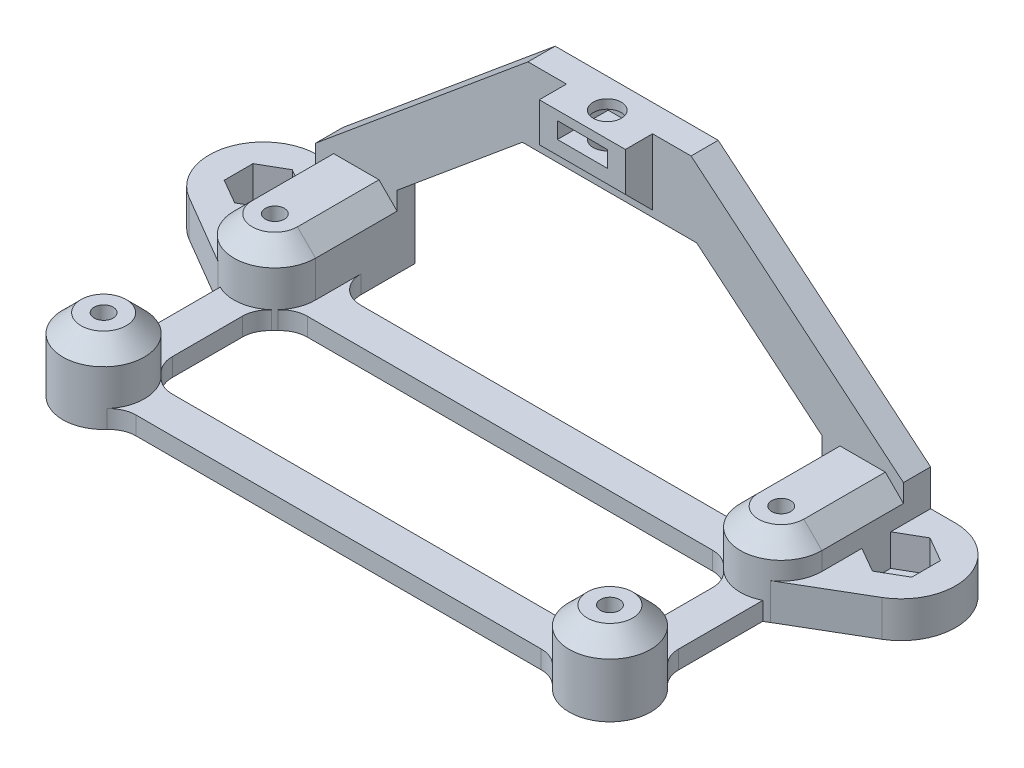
ISO-10303-21;
HEADER;
FILE_DESCRIPTION(('STEP AP214'),'2;1');
FILE_NAME('part.step','',(''),(''),'','','');
FILE_SCHEMA(('AUTOMOTIVE_DESIGN { 1 0 10303 214 1 1 1 1 }'));
ENDSEC;
DATA;
#1=APPLICATION_CONTEXT('core data for automotive mechanical design processes');
#2=APPLICATION_PROTOCOL_DEFINITION('international standard','automotive_design',2000,#1);
#3=PRODUCT_CONTEXT('',#1,'mechanical');
#4=PRODUCT('Part','Part','',(#3));
#5=PRODUCT_RELATED_PRODUCT_CATEGORY('part','',(#4));
#6=PRODUCT_DEFINITION_FORMATION('','',#4);
#7=PRODUCT_DEFINITION_CONTEXT('part definition',#1,'design');
#8=PRODUCT_DEFINITION('design','',#6,#7);
#9=PRODUCT_DEFINITION_SHAPE('','',#8);
#10=(LENGTH_UNIT() NAMED_UNIT(*) SI_UNIT(.MILLI.,.METRE.));
#11=(NAMED_UNIT(*) PLANE_ANGLE_UNIT() SI_UNIT($,.RADIAN.));
#12=(NAMED_UNIT(*) SI_UNIT($,.STERADIAN.) SOLID_ANGLE_UNIT());
#13=UNCERTAINTY_MEASURE_WITH_UNIT(LENGTH_MEASURE(1.E-05),#10,'distance_accuracy_value','');
#14=(GEOMETRIC_REPRESENTATION_CONTEXT(3) GLOBAL_UNCERTAINTY_ASSIGNED_CONTEXT((#13)) GLOBAL_UNIT_ASSIGNED_CONTEXT((#10,
#11,#12)) REPRESENTATION_CONTEXT('',''));
#15=CARTESIAN_POINT('',(0.,0.,0.));
#16=DIRECTION('',(0.,0.,1.));
#17=DIRECTION('',(1.,0.,0.));
#18=AXIS2_PLACEMENT_3D('',#15,#16,#17);
#19=CARTESIAN_POINT('',(32.45,0.,0.));
#20=DIRECTION('',(-1.,0.,0.));
#21=DIRECTION('',(0.,0.,1.));
#22=AXIS2_PLACEMENT_3D('',#19,#20,#21);
#23=PLANE('',#22);
#24=DIRECTION('',(0.,0.,1.));
#25=VECTOR('',#24,1.);
#26=CARTESIAN_POINT('',(32.45,8.,25.5));
#27=LINE('',#26,#25);
#28=CARTESIAN_POINT('',(32.45,8.,25.5));
#29=VERTEX_POINT('',#28);
#30=CARTESIAN_POINT('',(32.45,8.,28.5));
#31=VERTEX_POINT('',#30);
#32=EDGE_CURVE('E854',#29,#31,#27,.T.);
#33=ORIENTED_EDGE('',*,*,#32,.T.);
#34=DIRECTION('',(0.,-1.,0.));
#35=VECTOR('',#34,1.);
#36=CARTESIAN_POINT('',(32.45,0.,28.5));
#37=LINE('',#36,#35);
#38=CARTESIAN_POINT('',(32.45,5.99999999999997,28.5));
#39=VERTEX_POINT('',#38);
#40=EDGE_CURVE('E70',#31,#39,#37,.T.);
#41=ORIENTED_EDGE('',*,*,#40,.T.);
#42=DIRECTION('',(0.,0.,1.));
#43=VECTOR('',#42,1.);
#44=CARTESIAN_POINT('',(32.45,5.99999999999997,0.));
#45=LINE('',#44,#43);
#46=CARTESIAN_POINT('',(32.45,5.99999999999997,37.5));
#47=VERTEX_POINT('',#46);
#48=EDGE_CURVE('E1358',#39,#47,#45,.T.);
#49=ORIENTED_EDGE('',*,*,#48,.T.);
#50=DIRECTION('',(0.,-1.,0.));
#51=VECTOR('',#50,1.);
#52=CARTESIAN_POINT('',(32.45,8.,37.5));
#53=LINE('',#52,#51);
#54=CARTESIAN_POINT('',(32.45,4.,37.5));
#55=VERTEX_POINT('',#54);
#56=EDGE_CURVE('E890',#47,#55,#53,.T.);
#57=ORIENTED_EDGE('',*,*,#56,.T.);
#58=DIRECTION('',(0.,0.,-1.));
#59=VECTOR('',#58,1.);
#60=CARTESIAN_POINT('',(32.45,4.,0.));
#61=LINE('',#60,#59);
#62=CARTESIAN_POINT('',(32.45,4.,33.0877132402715));
#63=VERTEX_POINT('',#62);
#64=EDGE_CURVE('E660',#55,#63,#61,.T.);
#65=ORIENTED_EDGE('',*,*,#64,.T.);
#66=DIRECTION('',(0.,-1.,0.));
#67=VECTOR('',#66,1.);
#68=CARTESIAN_POINT('',(32.45,4.,33.0877132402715));
#69=LINE('',#68,#67);
#70=CARTESIAN_POINT('',(32.45,0.5,33.0877132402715));
#71=VERTEX_POINT('',#70);
#72=EDGE_CURVE('E624',#63,#71,#69,.T.);
#73=ORIENTED_EDGE('',*,*,#72,.T.);
#74=DIRECTION('',(0.,0.,1.));
#75=VECTOR('',#74,1.);
#76=CARTESIAN_POINT('',(32.45,0.5,29.9122867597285));
#77=LINE('',#76,#75);
#78=CARTESIAN_POINT('',(32.45,0.5,29.9122867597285));
#79=VERTEX_POINT('',#78);
#80=EDGE_CURVE('E586',#79,#71,#77,.T.);
#81=ORIENTED_EDGE('',*,*,#80,.F.);
#82=DIRECTION('',(0.,-1.,0.));
#83=VECTOR('',#82,1.);
#84=CARTESIAN_POINT('',(32.45,4.,29.9122867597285));
#85=LINE('',#84,#83);
#86=CARTESIAN_POINT('',(32.45,4.,29.9122867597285));
#87=VERTEX_POINT('',#86);
#88=EDGE_CURVE('E620',#87,#79,#85,.T.);
#89=ORIENTED_EDGE('',*,*,#88,.F.);
#90=CARTESIAN_POINT('',(32.45,4.,25.5));
#91=VERTEX_POINT('',#90);
#92=EDGE_CURVE('E666',#87,#91,#61,.T.);
#93=ORIENTED_EDGE('',*,*,#92,.T.);
#94=DIRECTION('',(0.,1.,0.));
#95=VECTOR('',#94,1.);
#96=CARTESIAN_POINT('',(32.45,0.,25.5));
#97=LINE('',#96,#95);
#98=EDGE_CURVE('E914',#91,#29,#97,.T.);
#99=ORIENTED_EDGE('',*,*,#98,.T.);
#100=EDGE_LOOP('',(#33,#41,#49,#57,#65,#73,#81,#89,#93,#99));
#101=FACE_BOUND('',#100,.T.);
#102=ADVANCED_FACE('F45',(#101),#23,.F.);
#103=CARTESIAN_POINT('',(37.95,4.,29.9122867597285));
#104=DIRECTION('',(-0.500000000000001,0.,0.866025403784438));
#105=DIRECTION('',(0.866025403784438,0.,0.500000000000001));
#106=AXIS2_PLACEMENT_3D('',#103,#104,#105);
#107=PLANE('',#106);
#108=DIRECTION('',(0.,-1.,0.));
#109=VECTOR('',#108,1.);
#110=CARTESIAN_POINT('',(35.2,4.,28.324573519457));
#111=LINE('',#110,#109);
#112=CARTESIAN_POINT('',(35.2,4.,28.324573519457));
#113=VERTEX_POINT('',#112);
#114=CARTESIAN_POINT('',(35.2,0.5,28.324573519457));
#115=VERTEX_POINT('',#114);
#116=EDGE_CURVE('E615',#113,#115,#111,.T.);
#117=ORIENTED_EDGE('',*,*,#116,.T.);
#118=DIRECTION('',(-0.866025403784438,0.,-0.500000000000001));
#119=VECTOR('',#118,1.);
#120=CARTESIAN_POINT('',(37.95,0.5,29.9122867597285));
#121=LINE('',#120,#119);
#122=CARTESIAN_POINT('',(37.95,0.5,29.9122867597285));
#123=VERTEX_POINT('',#122);
#124=EDGE_CURVE('E592',#123,#115,#121,.T.);
#125=ORIENTED_EDGE('',*,*,#124,.F.);
#126=DIRECTION('',(0.,-1.,0.));
#127=VECTOR('',#126,1.);
#128=CARTESIAN_POINT('',(37.95,4.,29.9122867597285));
#129=LINE('',#128,#127);
#130=CARTESIAN_POINT('',(37.95,4.,29.9122867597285));
#131=VERTEX_POINT('',#130);
#132=EDGE_CURVE('E614',#131,#123,#129,.T.);
#133=ORIENTED_EDGE('',*,*,#132,.F.);
#134=DIRECTION('',(-0.866025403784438,0.,-0.500000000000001));
#135=VECTOR('',#134,1.);
#136=CARTESIAN_POINT('',(37.95,4.,29.9122867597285));
#137=LINE('',#136,#135);
#138=EDGE_CURVE('E598',#131,#113,#137,.T.);
#139=ORIENTED_EDGE('',*,*,#138,.T.);
#140=EDGE_LOOP('',(#117,#125,#133,#139));
#141=FACE_BOUND('',#140,.T.);
#142=ADVANCED_FACE('F1540',(#141),#107,.T.);
#143=CARTESIAN_POINT('',(35.2,4.,28.324573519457));
#144=DIRECTION('',(0.5,0.,0.866025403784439));
#145=DIRECTION('',(0.866025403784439,0.,-0.5));
#146=AXIS2_PLACEMENT_3D('',#143,#144,#145);
#147=PLANE('',#146);
#148=ORIENTED_EDGE('',*,*,#88,.T.);
#149=DIRECTION('',(-0.866025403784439,0.,0.5));
#150=VECTOR('',#149,1.);
#151=CARTESIAN_POINT('',(35.2,0.5,28.324573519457));
#152=LINE('',#151,#150);
#153=EDGE_CURVE('E589',#115,#79,#152,.T.);
#154=ORIENTED_EDGE('',*,*,#153,.F.);
#155=ORIENTED_EDGE('',*,*,#116,.F.);
#156=DIRECTION('',(-0.866025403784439,0.,0.5));
#157=VECTOR('',#156,1.);
#158=CARTESIAN_POINT('',(35.2,4.,28.324573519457));
#159=LINE('',#158,#157);
#160=EDGE_CURVE('E611',#113,#87,#159,.T.);
#161=ORIENTED_EDGE('',*,*,#160,.T.);
#162=EDGE_LOOP('',(#148,#154,#155,#161));
#163=FACE_BOUND('',#162,.T.);
#164=ADVANCED_FACE('F1545',(#163),#147,.T.);
#165=CARTESIAN_POINT('',(32.45,4.,33.0877132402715));
#166=DIRECTION('',(0.500000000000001,0.,-0.866025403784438));
#167=DIRECTION('',(-0.866025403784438,0.,-0.500000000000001));
#168=AXIS2_PLACEMENT_3D('',#165,#166,#167);
#169=PLANE('',#168);
#170=DIRECTION('',(0.,-1.,0.));
#171=VECTOR('',#170,1.);
#172=CARTESIAN_POINT('',(35.2,4.,34.6754264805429));
#173=LINE('',#172,#171);
#174=CARTESIAN_POINT('',(35.2,4.,34.6754264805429));
#175=VERTEX_POINT('',#174);
#176=CARTESIAN_POINT('',(35.2,0.5,34.6754264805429));
#177=VERTEX_POINT('',#176);
#178=EDGE_CURVE('E628',#175,#177,#173,.T.);
#179=ORIENTED_EDGE('',*,*,#178,.T.);
#180=DIRECTION('',(0.866025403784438,0.,0.500000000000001));
#181=VECTOR('',#180,1.);
#182=CARTESIAN_POINT('',(32.45,0.5,33.0877132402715));
#183=LINE('',#182,#181);
#184=EDGE_CURVE('E583',#71,#177,#183,.T.);
#185=ORIENTED_EDGE('',*,*,#184,.F.);
#186=ORIENTED_EDGE('',*,*,#72,.F.);
#187=DIRECTION('',(0.866025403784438,0.,0.500000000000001));
#188=VECTOR('',#187,1.);
#189=CARTESIAN_POINT('',(32.45,4.,33.0877132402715));
#190=LINE('',#189,#188);
#191=EDGE_CURVE('E608',#63,#175,#190,.T.);
#192=ORIENTED_EDGE('',*,*,#191,.T.);
#193=EDGE_LOOP('',(#179,#185,#186,#192));
#194=FACE_BOUND('',#193,.T.);
#195=ADVANCED_FACE('F1524',(#194),#169,.T.);
#196=CARTESIAN_POINT('',(35.2,4.,34.6754264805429));
#197=DIRECTION('',(-0.500000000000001,0.,-0.866025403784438));
#198=DIRECTION('',(-0.866025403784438,0.,0.500000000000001));
#199=AXIS2_PLACEMENT_3D('',#196,#197,#198);
#200=PLANE('',#199);
#201=DIRECTION('',(0.,-1.,0.));
#202=VECTOR('',#201,1.);
#203=CARTESIAN_POINT('',(37.95,4.,33.0877132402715));
#204=LINE('',#203,#202);
#205=CARTESIAN_POINT('',(37.95,4.,33.0877132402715));
#206=VERTEX_POINT('',#205);
#207=CARTESIAN_POINT('',(37.95,0.5,33.0877132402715));
#208=VERTEX_POINT('',#207);
#209=EDGE_CURVE('E632',#206,#208,#204,.T.);
#210=ORIENTED_EDGE('',*,*,#209,.T.);
#211=DIRECTION('',(0.866025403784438,0.,-0.500000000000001));
#212=VECTOR('',#211,1.);
#213=CARTESIAN_POINT('',(35.2,0.5,34.6754264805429));
#214=LINE('',#213,#212);
#215=EDGE_CURVE('E575',#177,#208,#214,.T.);
#216=ORIENTED_EDGE('',*,*,#215,.F.);
#217=ORIENTED_EDGE('',*,*,#178,.F.);
#218=DIRECTION('',(0.866025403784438,0.,-0.500000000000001));
#219=VECTOR('',#218,1.);
#220=CARTESIAN_POINT('',(35.2,4.,34.6754264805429));
#221=LINE('',#220,#219);
#222=EDGE_CURVE('E604',#175,#206,#221,.T.);
#223=ORIENTED_EDGE('',*,*,#222,.T.);
#224=EDGE_LOOP('',(#210,#216,#217,#223));
#225=FACE_BOUND('',#224,.T.);
#226=ADVANCED_FACE('F1532',(#225),#200,.T.);
#227=CARTESIAN_POINT('',(37.95,4.,33.0877132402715));
#228=DIRECTION('',(-1.,0.,0.));
#229=DIRECTION('',(0.,0.,1.));
#230=AXIS2_PLACEMENT_3D('',#227,#228,#229);
#231=PLANE('',#230);
#232=ORIENTED_EDGE('',*,*,#132,.T.);
#233=DIRECTION('',(0.,0.,-1.));
#234=VECTOR('',#233,1.);
#235=CARTESIAN_POINT('',(37.95,0.5,33.0877132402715));
#236=LINE('',#235,#234);
#237=EDGE_CURVE('E595',#208,#123,#236,.T.);
#238=ORIENTED_EDGE('',*,*,#237,.F.);
#239=ORIENTED_EDGE('',*,*,#209,.F.);
#240=DIRECTION('',(0.,0.,-1.));
#241=VECTOR('',#240,1.);
#242=CARTESIAN_POINT('',(37.95,4.,33.0877132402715));
#243=LINE('',#242,#241);
#244=EDGE_CURVE('E601',#206,#131,#243,.T.);
#245=ORIENTED_EDGE('',*,*,#244,.T.);
#246=EDGE_LOOP('',(#232,#238,#239,#245));
#247=FACE_BOUND('',#246,.T.);
#248=ADVANCED_FACE('F1535',(#247),#231,.T.);
#249=CARTESIAN_POINT('',(-32.45,8.,37.5));
#250=DIRECTION('',(1.,0.,0.));
#251=DIRECTION('',(0.,0.,-1.));
#252=AXIS2_PLACEMENT_3D('',#249,#250,#251);
#253=PLANE('',#252);
#254=DIRECTION('',(0.,-1.,0.));
#255=VECTOR('',#254,1.);
#256=CARTESIAN_POINT('',(-32.45,8.,37.5));
#257=LINE('',#256,#255);
#258=CARTESIAN_POINT('',(-32.45,5.99999999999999,37.5));
#259=VERTEX_POINT('',#258);
#260=CARTESIAN_POINT('',(-32.45,4.,37.5));
#261=VERTEX_POINT('',#260);
#262=EDGE_CURVE('E948',#259,#261,#257,.T.);
#263=ORIENTED_EDGE('',*,*,#262,.F.);
#264=DIRECTION('',(0.,0.,-1.));
#265=VECTOR('',#264,1.);
#266=CARTESIAN_POINT('',(-32.45,5.99999999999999,28.5));
#267=LINE('',#266,#265);
#268=CARTESIAN_POINT('',(-32.45,5.99999999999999,28.5));
#269=VERTEX_POINT('',#268);
#270=EDGE_CURVE('E1379',#259,#269,#267,.T.);
#271=ORIENTED_EDGE('',*,*,#270,.T.);
#272=DIRECTION('',(0.,1.,0.));
#273=VECTOR('',#272,1.);
#274=CARTESIAN_POINT('',(-32.45,0.,28.5));
#275=LINE('',#274,#273);
#276=CARTESIAN_POINT('',(-32.45,8.,28.5));
#277=VERTEX_POINT('',#276);
#278=EDGE_CURVE('E1376',#269,#277,#275,.T.);
#279=ORIENTED_EDGE('',*,*,#278,.T.);
#280=DIRECTION('',(0.,0.,1.));
#281=VECTOR('',#280,1.);
#282=CARTESIAN_POINT('',(-32.45,8.,25.5));
#283=LINE('',#282,#281);
#284=CARTESIAN_POINT('',(-32.45,8.,25.5));
#285=VERTEX_POINT('',#284);
#286=EDGE_CURVE('E883',#285,#277,#283,.T.);
#287=ORIENTED_EDGE('',*,*,#286,.F.);
#288=DIRECTION('',(0.,-1.,0.));
#289=VECTOR('',#288,1.);
#290=CARTESIAN_POINT('',(-32.45,8.,25.5));
#291=LINE('',#290,#289);
#292=CARTESIAN_POINT('',(-32.45,4.,25.5));
#293=VERTEX_POINT('',#292);
#294=EDGE_CURVE('E951',#285,#293,#291,.T.);
#295=ORIENTED_EDGE('',*,*,#294,.T.);
#296=DIRECTION('',(0.,0.,1.));
#297=VECTOR('',#296,1.);
#298=CARTESIAN_POINT('',(-32.45,4.,37.5));
#299=LINE('',#298,#297);
#300=CARTESIAN_POINT('',(-32.45,4.,29.9122867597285));
#301=VERTEX_POINT('',#300);
#302=EDGE_CURVE('E1099',#293,#301,#299,.T.);
#303=ORIENTED_EDGE('',*,*,#302,.T.);
#304=DIRECTION('',(0.,-1.,0.));
#305=VECTOR('',#304,1.);
#306=CARTESIAN_POINT('',(-32.45,4.,29.9122867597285));
#307=LINE('',#306,#305);
#308=CARTESIAN_POINT('',(-32.45,0.5,29.9122867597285));
#309=VERTEX_POINT('',#308);
#310=EDGE_CURVE('E732',#301,#309,#307,.T.);
#311=ORIENTED_EDGE('',*,*,#310,.T.);
#312=DIRECTION('',(0.,0.,1.));
#313=VECTOR('',#312,1.);
#314=CARTESIAN_POINT('',(-32.45,0.5,29.9122867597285));
#315=LINE('',#314,#313);
#316=CARTESIAN_POINT('',(-32.45,0.5,33.0877132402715));
#317=VERTEX_POINT('',#316);
#318=EDGE_CURVE('E688',#309,#317,#315,.T.);
#319=ORIENTED_EDGE('',*,*,#318,.T.);
#320=DIRECTION('',(0.,-1.,0.));
#321=VECTOR('',#320,1.);
#322=CARTESIAN_POINT('',(-32.45,4.,33.0877132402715));
#323=LINE('',#322,#321);
#324=CARTESIAN_POINT('',(-32.45,4.,33.0877132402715));
#325=VERTEX_POINT('',#324);
#326=EDGE_CURVE('E728',#325,#317,#323,.T.);
#327=ORIENTED_EDGE('',*,*,#326,.F.);
#328=EDGE_CURVE('E1095',#325,#261,#299,.T.);
#329=ORIENTED_EDGE('',*,*,#328,.T.);
#330=EDGE_LOOP('',(#263,#271,#279,#287,#295,#303,#311,#319,#327,#329));
#331=FACE_BOUND('',#330,.T.);
#332=ADVANCED_FACE('F1439',(#331),#253,.F.);
#333=CARTESIAN_POINT('',(-37.95,4.,29.9122867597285));
#334=DIRECTION('',(-0.500000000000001,0.,-0.866025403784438));
#335=DIRECTION('',(-0.866025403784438,0.,0.500000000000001));
#336=AXIS2_PLACEMENT_3D('',#333,#334,#335);
#337=PLANE('',#336);
#338=DIRECTION('',(0.866025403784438,0.,-0.500000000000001));
#339=VECTOR('',#338,1.);
#340=CARTESIAN_POINT('',(-37.95,0.5,29.9122867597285));
#341=LINE('',#340,#339);
#342=CARTESIAN_POINT('',(-37.95,0.5,29.9122867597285));
#343=VERTEX_POINT('',#342);
#344=CARTESIAN_POINT('',(-35.2,0.5,28.324573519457));
#345=VERTEX_POINT('',#344);
#346=EDGE_CURVE('E681',#343,#345,#341,.T.);
#347=ORIENTED_EDGE('',*,*,#346,.T.);
#348=DIRECTION('',(0.,-1.,0.));
#349=VECTOR('',#348,1.);
#350=CARTESIAN_POINT('',(-35.2,4.,28.324573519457));
#351=LINE('',#350,#349);
#352=CARTESIAN_POINT('',(-35.2,4.,28.324573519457));
#353=VERTEX_POINT('',#352);
#354=EDGE_CURVE('E714',#353,#345,#351,.T.);
#355=ORIENTED_EDGE('',*,*,#354,.F.);
#356=DIRECTION('',(0.866025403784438,0.,-0.500000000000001));
#357=VECTOR('',#356,1.);
#358=CARTESIAN_POINT('',(-37.95,4.,29.9122867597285));
#359=LINE('',#358,#357);
#360=CARTESIAN_POINT('',(-37.95,4.,29.9122867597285));
#361=VERTEX_POINT('',#360);
#362=EDGE_CURVE('E694',#361,#353,#359,.T.);
#363=ORIENTED_EDGE('',*,*,#362,.F.);
#364=DIRECTION('',(0.,-1.,0.));
#365=VECTOR('',#364,1.);
#366=CARTESIAN_POINT('',(-37.95,4.,29.9122867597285));
#367=LINE('',#366,#365);
#368=EDGE_CURVE('E715',#361,#343,#367,.T.);
#369=ORIENTED_EDGE('',*,*,#368,.T.);
#370=EDGE_LOOP('',(#347,#355,#363,#369));
#371=FACE_BOUND('',#370,.T.);
#372=ADVANCED_FACE('F1668',(#371),#337,.F.);
#373=CARTESIAN_POINT('',(-37.95,4.,33.0877132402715));
#374=DIRECTION('',(-1.,0.,0.));
#375=DIRECTION('',(0.,0.,1.));
#376=AXIS2_PLACEMENT_3D('',#373,#374,#375);
#377=PLANE('',#376);
#378=DIRECTION('',(0.,0.,-1.));
#379=VECTOR('',#378,1.);
#380=CARTESIAN_POINT('',(-37.95,0.5,33.0877132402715));
#381=LINE('',#380,#379);
#382=CARTESIAN_POINT('',(-37.95,0.5,33.0877132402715));
#383=VERTEX_POINT('',#382);
#384=EDGE_CURVE('E678',#383,#343,#381,.T.);
#385=ORIENTED_EDGE('',*,*,#384,.T.);
#386=ORIENTED_EDGE('',*,*,#368,.F.);
#387=DIRECTION('',(0.,0.,-1.));
#388=VECTOR('',#387,1.);
#389=CARTESIAN_POINT('',(-37.95,4.,33.0877132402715));
#390=LINE('',#389,#388);
#391=CARTESIAN_POINT('',(-37.95,4.,33.0877132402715));
#392=VERTEX_POINT('',#391);
#393=EDGE_CURVE('E710',#392,#361,#390,.T.);
#394=ORIENTED_EDGE('',*,*,#393,.F.);
#395=DIRECTION('',(0.,-1.,0.));
#396=VECTOR('',#395,1.);
#397=CARTESIAN_POINT('',(-37.95,4.,33.0877132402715));
#398=LINE('',#397,#396);
#399=EDGE_CURVE('E720',#392,#383,#398,.T.);
#400=ORIENTED_EDGE('',*,*,#399,.T.);
#401=EDGE_LOOP('',(#385,#386,#394,#400));
#402=FACE_BOUND('',#401,.T.);
#403=ADVANCED_FACE('F1789',(#402),#377,.F.);
#404=CARTESIAN_POINT('',(-35.2,4.,34.6754264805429));
#405=DIRECTION('',(-0.500000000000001,0.,0.866025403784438));
#406=DIRECTION('',(0.866025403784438,0.,0.500000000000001));
#407=AXIS2_PLACEMENT_3D('',#404,#405,#406);
#408=PLANE('',#407);
#409=DIRECTION('',(-0.866025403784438,0.,-0.500000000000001));
#410=VECTOR('',#409,1.);
#411=CARTESIAN_POINT('',(-35.2,0.5,34.6754264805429));
#412=LINE('',#411,#410);
#413=CARTESIAN_POINT('',(-35.2,0.5,34.6754264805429));
#414=VERTEX_POINT('',#413);
#415=EDGE_CURVE('E671',#414,#383,#412,.T.);
#416=ORIENTED_EDGE('',*,*,#415,.T.);
#417=ORIENTED_EDGE('',*,*,#399,.F.);
#418=DIRECTION('',(-0.866025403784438,0.,-0.500000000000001));
#419=VECTOR('',#418,1.);
#420=CARTESIAN_POINT('',(-35.2,4.,34.6754264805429));
#421=LINE('',#420,#419);
#422=CARTESIAN_POINT('',(-35.2,4.,34.6754264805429));
#423=VERTEX_POINT('',#422);
#424=EDGE_CURVE('E706',#423,#392,#421,.T.);
#425=ORIENTED_EDGE('',*,*,#424,.F.);
#426=DIRECTION('',(0.,-1.,0.));
#427=VECTOR('',#426,1.);
#428=CARTESIAN_POINT('',(-35.2,4.,34.6754264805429));
#429=LINE('',#428,#427);
#430=EDGE_CURVE('E724',#423,#414,#429,.T.);
#431=ORIENTED_EDGE('',*,*,#430,.T.);
#432=EDGE_LOOP('',(#416,#417,#425,#431));
#433=FACE_BOUND('',#432,.T.);
#434=ADVANCED_FACE('F1787',(#433),#408,.F.);
#435=CARTESIAN_POINT('',(-32.45,4.,33.0877132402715));
#436=DIRECTION('',(0.500000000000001,0.,0.866025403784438));
#437=DIRECTION('',(0.866025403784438,0.,-0.500000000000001));
#438=AXIS2_PLACEMENT_3D('',#435,#436,#437);
#439=PLANE('',#438);
#440=DIRECTION('',(-0.866025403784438,0.,0.500000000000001));
#441=VECTOR('',#440,1.);
#442=CARTESIAN_POINT('',(-32.45,0.5,33.0877132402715));
#443=LINE('',#442,#441);
#444=EDGE_CURVE('E691',#317,#414,#443,.T.);
#445=ORIENTED_EDGE('',*,*,#444,.T.);
#446=ORIENTED_EDGE('',*,*,#430,.F.);
#447=DIRECTION('',(-0.866025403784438,0.,0.500000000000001));
#448=VECTOR('',#447,1.);
#449=CARTESIAN_POINT('',(-32.45,4.,33.0877132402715));
#450=LINE('',#449,#448);
#451=EDGE_CURVE('E702',#325,#423,#450,.T.);
#452=ORIENTED_EDGE('',*,*,#451,.F.);
#453=ORIENTED_EDGE('',*,*,#326,.T.);
#454=EDGE_LOOP('',(#445,#446,#452,#453));
#455=FACE_BOUND('',#454,.T.);
#456=ADVANCED_FACE('F1783',(#455),#439,.F.);
#457=CARTESIAN_POINT('',(-35.2,4.,28.324573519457));
#458=DIRECTION('',(0.5,0.,-0.866025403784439));
#459=DIRECTION('',(-0.866025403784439,0.,-0.5));
#460=AXIS2_PLACEMENT_3D('',#457,#458,#459);
#461=PLANE('',#460);
#462=DIRECTION('',(0.866025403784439,0.,0.5));
#463=VECTOR('',#462,1.);
#464=CARTESIAN_POINT('',(-35.2,0.5,28.324573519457));
#465=LINE('',#464,#463);
#466=EDGE_CURVE('E685',#345,#309,#465,.T.);
#467=ORIENTED_EDGE('',*,*,#466,.T.);
#468=ORIENTED_EDGE('',*,*,#310,.F.);
#469=DIRECTION('',(0.866025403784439,0.,0.5));
#470=VECTOR('',#469,1.);
#471=CARTESIAN_POINT('',(-35.2,4.,28.324573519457));
#472=LINE('',#471,#470);
#473=EDGE_CURVE('E698',#353,#301,#472,.T.);
#474=ORIENTED_EDGE('',*,*,#473,.F.);
#475=ORIENTED_EDGE('',*,*,#354,.T.);
#476=EDGE_LOOP('',(#467,#468,#474,#475));
#477=FACE_BOUND('',#476,.T.);
#478=ADVANCED_FACE('F1773',(#477),#461,.F.);
#479=CARTESIAN_POINT('',(-4.75,23.2,31.5));
#480=DIRECTION('',(0.,0.,1.));
#481=DIRECTION('',(1.,0.,0.));
#482=AXIS2_PLACEMENT_3D('',#479,#480,#481);
#483=PLANE('',#482);
#484=DIRECTION('',(1.,0.,0.));
#485=VECTOR('',#484,1.);
#486=CARTESIAN_POINT('',(-4.75,27.5,31.5));
#487=LINE('',#486,#485);
#488=CARTESIAN_POINT('',(-4.75,27.5,31.5));
#489=VERTEX_POINT('',#488);
#490=CARTESIAN_POINT('',(4.75,27.5,31.5));
#491=VERTEX_POINT('',#490);
#492=EDGE_CURVE('E808',#489,#491,#487,.T.);
#493=ORIENTED_EDGE('',*,*,#492,.F.);
#494=DIRECTION('',(0.,1.,0.));
#495=VECTOR('',#494,1.);
#496=CARTESIAN_POINT('',(-4.75,23.2,31.5));
#497=LINE('',#496,#495);
#498=CARTESIAN_POINT('',(-4.75,23.2,31.5));
#499=VERTEX_POINT('',#498);
#500=EDGE_CURVE('E803',#499,#489,#497,.T.);
#501=ORIENTED_EDGE('',*,*,#500,.F.);
#502=DIRECTION('',(1.,0.,0.));
#503=VECTOR('',#502,1.);
#504=CARTESIAN_POINT('',(-4.75,23.2,31.5));
#505=LINE('',#504,#503);
#506=CARTESIAN_POINT('',(4.75,23.2,31.5));
#507=VERTEX_POINT('',#506);
#508=EDGE_CURVE('E799',#499,#507,#505,.T.);
#509=ORIENTED_EDGE('',*,*,#508,.T.);
#510=DIRECTION('',(0.,1.,0.));
#511=VECTOR('',#510,1.);
#512=CARTESIAN_POINT('',(4.75,23.2,31.5));
#513=LINE('',#512,#511);
#514=EDGE_CURVE('E823',#507,#491,#513,.T.);
#515=ORIENTED_EDGE('',*,*,#514,.T.);
#516=EDGE_LOOP('',(#493,#501,#509,#515));
#517=FACE_BOUND('',#516,.T.);
#518=DIRECTION('',(0.,1.,0.));
#519=VECTOR('',#518,1.);
#520=CARTESIAN_POINT('',(2.75,24.7,31.5));
#521=LINE('',#520,#519);
#522=CARTESIAN_POINT('',(2.75,24.7,31.5));
#523=VERTEX_POINT('',#522);
#524=CARTESIAN_POINT('',(2.75,26.5,31.5));
#525=VERTEX_POINT('',#524);
#526=EDGE_CURVE('E792',#523,#525,#521,.T.);
#527=ORIENTED_EDGE('',*,*,#526,.F.);
#528=DIRECTION('',(1.,0.,0.));
#529=VECTOR('',#528,1.);
#530=CARTESIAN_POINT('',(-2.75,24.7,31.5));
#531=LINE('',#530,#529);
#532=CARTESIAN_POINT('',(-2.75,24.7,31.5));
#533=VERTEX_POINT('',#532);
#534=EDGE_CURVE('E547',#533,#523,#531,.T.);
#535=ORIENTED_EDGE('',*,*,#534,.F.);
#536=DIRECTION('',(0.,1.,0.));
#537=VECTOR('',#536,1.);
#538=CARTESIAN_POINT('',(-2.75,24.7,31.5));
#539=LINE('',#538,#537);
#540=CARTESIAN_POINT('',(-2.75,26.5,31.5));
#541=VERTEX_POINT('',#540);
#542=EDGE_CURVE('E542',#533,#541,#539,.T.);
#543=ORIENTED_EDGE('',*,*,#542,.T.);
#544=DIRECTION('',(1.,0.,0.));
#545=VECTOR('',#544,1.);
#546=CARTESIAN_POINT('',(-2.75,26.5,31.5));
#547=LINE('',#546,#545);
#548=EDGE_CURVE('E786',#541,#525,#547,.T.);
#549=ORIENTED_EDGE('',*,*,#548,.T.);
#550=EDGE_LOOP('',(#527,#535,#543,#549));
#551=FACE_BOUND('',#550,.T.);
#552=ADVANCED_FACE('F1713',(#517,#551),#483,.T.);
#553=CARTESIAN_POINT('',(-29.95,2.,35.5));
#554=DIRECTION('',(-1.,0.,0.));
#555=DIRECTION('',(0.,0.,1.));
#556=AXIS2_PLACEMENT_3D('',#553,#554,#555);
#557=PLANE('',#556);
#558=DIRECTION('',(0.,0.,-1.));
#559=VECTOR('',#558,1.);
#560=CARTESIAN_POINT('',(-29.95,0.,35.5));
#561=LINE('',#560,#559);
#562=CARTESIAN_POINT('',(-29.95,0.,50.8098300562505));
#563=VERTEX_POINT('',#562);
#564=CARTESIAN_POINT('',(-29.95,0.,41.5311288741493));
#565=VERTEX_POINT('',#564);
#566=EDGE_CURVE('E1020',#563,#565,#561,.T.);
#567=ORIENTED_EDGE('',*,*,#566,.F.);
#568=DIRECTION('',(0.,-1.,0.));
#569=VECTOR('',#568,1.);
#570=CARTESIAN_POINT('',(-29.95,2.,50.8098300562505));
#571=LINE('',#570,#569);
#572=CARTESIAN_POINT('',(-29.95,2.,50.8098300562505));
#573=VERTEX_POINT('',#572);
#574=EDGE_CURVE('E1128',#563,#573,#571,.F.);
#575=ORIENTED_EDGE('',*,*,#574,.T.);
#576=DIRECTION('',(0.,0.,-1.));
#577=VECTOR('',#576,1.);
#578=CARTESIAN_POINT('',(-29.95,2.,35.5));
#579=LINE('',#578,#577);
#580=CARTESIAN_POINT('',(-29.95,2.,41.5311288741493));
#581=VERTEX_POINT('',#580);
#582=EDGE_CURVE('E1036',#573,#581,#579,.T.);
#583=ORIENTED_EDGE('',*,*,#582,.T.);
#584=DIRECTION('',(0.,-1.,0.));
#585=VECTOR('',#584,1.);
#586=CARTESIAN_POINT('',(-29.95,8.,41.5311288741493));
#587=LINE('',#586,#585);
#588=EDGE_CURVE('E969',#581,#565,#587,.T.);
#589=ORIENTED_EDGE('',*,*,#588,.T.);
#590=EDGE_LOOP('',(#567,#575,#583,#589));
#591=FACE_BOUND('',#590,.T.);
#592=ADVANCED_FACE('F1710',(#591),#557,.T.);
#593=CARTESIAN_POINT('',(0.,2.,0.));
#594=DIRECTION('',(0.,1.,0.));
#595=DIRECTION('',(0.,0.,1.));
#596=AXIS2_PLACEMENT_3D('',#593,#594,#595);
#597=PLANE('',#596);
#598=CARTESIAN_POINT('',(-27.95,2.,56.4));
#599=DIRECTION('',(0.,1.,0.));
#600=DIRECTION('',(0.,0.,1.));
#601=AXIS2_PLACEMENT_3D('',#598,#599,#600);
#602=CIRCLE('',#601,4.50000000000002);
#603=CARTESIAN_POINT('',(-30.95,2.,53.0458980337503));
#604=VERTEX_POINT('',#603);
#605=CARTESIAN_POINT('',(-24.95,2.,53.0458980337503));
#606=VERTEX_POINT('',#605);
#607=EDGE_CURVE('E999',#604,#606,#602,.F.);
#608=ORIENTED_EDGE('',*,*,#607,.T.);
#609=CARTESIAN_POINT('',(-22.95,2.,50.8098300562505));
#610=DIRECTION('',(0.,1.,0.));
#611=DIRECTION('',(0.,0.,1.));
#612=AXIS2_PLACEMENT_3D('',#609,#610,#611);
#613=CIRCLE('',#612,3.);
#614=CARTESIAN_POINT('',(-25.95,2.,50.8098300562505));
#615=VERTEX_POINT('',#614);
#616=EDGE_CURVE('E1280',#606,#615,#613,.F.);
#617=ORIENTED_EDGE('',*,*,#616,.T.);
#618=DIRECTION('',(0.,0.,-1.));
#619=VECTOR('',#618,1.);
#620=CARTESIAN_POINT('',(-25.95,2.,39.5));
#621=LINE('',#620,#619);
#622=CARTESIAN_POINT('',(-25.95,2.,43.0901699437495));
#623=VERTEX_POINT('',#622);
#624=EDGE_CURVE('E1003',#615,#623,#621,.T.);
#625=ORIENTED_EDGE('',*,*,#624,.T.);
#626=CARTESIAN_POINT('',(-22.95,2.,43.0901699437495));
#627=DIRECTION('',(0.,1.,0.));
#628=DIRECTION('',(0.,0.,1.));
#629=AXIS2_PLACEMENT_3D('',#626,#627,#628);
#630=CIRCLE('',#629,3.);
#631=CARTESIAN_POINT('',(-24.95,2.,40.8541019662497));
#632=VERTEX_POINT('',#631);
#633=EDGE_CURVE('E1302',#623,#632,#630,.F.);
#634=ORIENTED_EDGE('',*,*,#633,.T.);
#635=CARTESIAN_POINT('',(-27.95,2.,37.5));
#636=DIRECTION('',(0.,1.,0.));
#637=DIRECTION('',(0.,0.,1.));
#638=AXIS2_PLACEMENT_3D('',#635,#636,#637);
#639=CIRCLE('',#638,4.5);
#640=EDGE_CURVE('E968',#632,#581,#639,.F.);
#641=ORIENTED_EDGE('',*,*,#640,.T.);
#642=ORIENTED_EDGE('',*,*,#582,.F.);
#643=CARTESIAN_POINT('',(-32.95,2.,50.8098300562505));
#644=DIRECTION('',(0.,1.,0.));
#645=DIRECTION('',(0.,0.,1.));
#646=AXIS2_PLACEMENT_3D('',#643,#644,#645);
#647=CIRCLE('',#646,3.);
#648=EDGE_CURVE('E1228',#573,#604,#647,.F.);
#649=ORIENTED_EDGE('',*,*,#648,.T.);
#650=EDGE_LOOP('',(#608,#617,#625,#634,#641,#642,#649));
#651=FACE_BOUND('',#650,.T.);
#652=ADVANCED_FACE('F1702',(#651),#597,.T.);
#653=DIRECTION('',(0.,0.,1.));
#654=VECTOR('',#653,1.);
#655=CARTESIAN_POINT('',(29.95,2.,35.5));
#656=LINE('',#655,#654);
#657=CARTESIAN_POINT('',(29.95,2.,41.5311288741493));
#658=VERTEX_POINT('',#657);
#659=CARTESIAN_POINT('',(29.95,2.,50.8098300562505));
#660=VERTEX_POINT('',#659);
#661=EDGE_CURVE('E1044',#658,#660,#656,.T.);
#662=ORIENTED_EDGE('',*,*,#661,.F.);
#663=CARTESIAN_POINT('',(27.95,2.,37.5));
#664=DIRECTION('',(0.,1.,0.));
#665=DIRECTION('',(0.,0.,1.));
#666=AXIS2_PLACEMENT_3D('',#663,#664,#665);
#667=CIRCLE('',#666,4.5);
#668=CARTESIAN_POINT('',(24.95,2.,40.8541019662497));
#669=VERTEX_POINT('',#668);
#670=EDGE_CURVE('E961',#658,#669,#667,.F.);
#671=ORIENTED_EDGE('',*,*,#670,.T.);
#672=CARTESIAN_POINT('',(22.95,2.,43.0901699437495));
#673=DIRECTION('',(0.,1.,0.));
#674=DIRECTION('',(0.,0.,1.));
#675=AXIS2_PLACEMENT_3D('',#672,#673,#674);
#676=CIRCLE('',#675,3.);
#677=CARTESIAN_POINT('',(25.95,2.,43.0901699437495));
#678=VERTEX_POINT('',#677);
#679=EDGE_CURVE('E1267',#669,#678,#676,.F.);
#680=ORIENTED_EDGE('',*,*,#679,.T.);
#681=DIRECTION('',(0.,0.,1.));
#682=VECTOR('',#681,1.);
#683=CARTESIAN_POINT('',(25.95,2.,39.5));
#684=LINE('',#683,#682);
#685=CARTESIAN_POINT('',(25.95,2.,50.8098300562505));
#686=VERTEX_POINT('',#685);
#687=EDGE_CURVE('E1012',#678,#686,#684,.T.);
#688=ORIENTED_EDGE('',*,*,#687,.T.);
#689=CARTESIAN_POINT('',(22.95,2.,50.8098300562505));
#690=DIRECTION('',(0.,1.,0.));
#691=DIRECTION('',(0.,0.,1.));
#692=AXIS2_PLACEMENT_3D('',#689,#690,#691);
#693=CIRCLE('',#692,3.);
#694=CARTESIAN_POINT('',(24.95,2.,53.0458980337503));
#695=VERTEX_POINT('',#694);
#696=EDGE_CURVE('E1254',#686,#695,#693,.F.);
#697=ORIENTED_EDGE('',*,*,#696,.T.);
#698=CARTESIAN_POINT('',(27.95,2.,56.4));
#699=DIRECTION('',(0.,1.,0.));
#700=DIRECTION('',(0.,0.,1.));
#701=AXIS2_PLACEMENT_3D('',#698,#699,#700);
#702=CIRCLE('',#701,4.50000000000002);
#703=CARTESIAN_POINT('',(30.95,2.,53.0458980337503));
#704=VERTEX_POINT('',#703);
#705=EDGE_CURVE('E1068',#704,#695,#702,.T.);
#706=ORIENTED_EDGE('',*,*,#705,.F.);
#707=CARTESIAN_POINT('',(32.95,2.,50.8098300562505));
#708=DIRECTION('',(0.,1.,0.));
#709=DIRECTION('',(0.,0.,1.));
#710=AXIS2_PLACEMENT_3D('',#707,#708,#709);
#711=CIRCLE('',#710,3.);
#712=EDGE_CURVE('E1235',#704,#660,#711,.F.);
#713=ORIENTED_EDGE('',*,*,#712,.T.);
#714=EDGE_LOOP('',(#662,#671,#680,#688,#697,#706,#713));
#715=FACE_BOUND('',#714,.T.);
#716=ADVANCED_FACE('F1577',(#715),#597,.T.);
#717=CARTESIAN_POINT('',(-25.95,2.,39.5));
#718=DIRECTION('',(-1.,0.,0.));
#719=DIRECTION('',(0.,0.,1.));
#720=AXIS2_PLACEMENT_3D('',#717,#718,#719);
#721=PLANE('',#720);
#722=ORIENTED_EDGE('',*,*,#624,.F.);
#723=DIRECTION('',(0.,1.,0.));
#724=VECTOR('',#723,1.);
#725=CARTESIAN_POINT('',(-25.95,0.,50.8098300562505));
#726=LINE('',#725,#724);
#727=CARTESIAN_POINT('',(-25.95,0.,50.8098300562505));
#728=VERTEX_POINT('',#727);
#729=EDGE_CURVE('E1203',#615,#728,#726,.F.);
#730=ORIENTED_EDGE('',*,*,#729,.T.);
#731=DIRECTION('',(0.,0.,-1.));
#732=VECTOR('',#731,1.);
#733=CARTESIAN_POINT('',(-25.95,0.,39.5));
#734=LINE('',#733,#732);
#735=CARTESIAN_POINT('',(-25.95,0.,43.0901699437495));
#736=VERTEX_POINT('',#735);
#737=EDGE_CURVE('E1021',#728,#736,#734,.T.);
#738=ORIENTED_EDGE('',*,*,#737,.T.);
#739=DIRECTION('',(0.,1.,0.));
#740=VECTOR('',#739,1.);
#741=CARTESIAN_POINT('',(-25.95,2.,43.0901699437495));
#742=LINE('',#741,#740);
#743=EDGE_CURVE('E1200',#736,#623,#742,.T.);
#744=ORIENTED_EDGE('',*,*,#743,.T.);
#745=EDGE_LOOP('',(#722,#730,#738,#744));
#746=FACE_BOUND('',#745,.T.);
#747=ADVANCED_FACE('F1695',(#746),#721,.F.);
#748=CARTESIAN_POINT('',(29.95,2.,35.5));
#749=DIRECTION('',(1.,0.,0.));
#750=DIRECTION('',(0.,0.,-1.));
#751=AXIS2_PLACEMENT_3D('',#748,#749,#750);
#752=PLANE('',#751);
#753=ORIENTED_EDGE('',*,*,#661,.T.);
#754=DIRECTION('',(0.,-1.,0.));
#755=VECTOR('',#754,1.);
#756=CARTESIAN_POINT('',(29.95,2.,50.8098300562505));
#757=LINE('',#756,#755);
#758=CARTESIAN_POINT('',(29.95,0.,50.8098300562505));
#759=VERTEX_POINT('',#758);
#760=EDGE_CURVE('E1162',#660,#759,#757,.T.);
#761=ORIENTED_EDGE('',*,*,#760,.T.);
#762=DIRECTION('',(0.,0.,1.));
#763=VECTOR('',#762,1.);
#764=CARTESIAN_POINT('',(29.95,0.,35.5));
#765=LINE('',#764,#763);
#766=CARTESIAN_POINT('',(29.95,0.,41.5311288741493));
#767=VERTEX_POINT('',#766);
#768=EDGE_CURVE('E1059',#767,#759,#765,.T.);
#769=ORIENTED_EDGE('',*,*,#768,.F.);
#770=DIRECTION('',(0.,-1.,0.));
#771=VECTOR('',#770,1.);
#772=CARTESIAN_POINT('',(29.95,8.,41.5311288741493));
#773=LINE('',#772,#771);
#774=EDGE_CURVE('E962',#767,#658,#773,.F.);
#775=ORIENTED_EDGE('',*,*,#774,.T.);
#776=EDGE_LOOP('',(#753,#761,#769,#775));
#777=FACE_BOUND('',#776,.T.);
#778=ADVANCED_FACE('F1580',(#777),#752,.T.);
#779=CARTESIAN_POINT('',(25.95,2.,39.5));
#780=DIRECTION('',(1.,0.,0.));
#781=DIRECTION('',(0.,0.,-1.));
#782=AXIS2_PLACEMENT_3D('',#779,#780,#781);
#783=PLANE('',#782);
#784=DIRECTION('',(0.,0.,1.));
#785=VECTOR('',#784,1.);
#786=CARTESIAN_POINT('',(25.95,0.,39.5));
#787=LINE('',#786,#785);
#788=CARTESIAN_POINT('',(25.95,0.,43.0901699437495));
#789=VERTEX_POINT('',#788);
#790=CARTESIAN_POINT('',(25.95,0.,50.8098300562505));
#791=VERTEX_POINT('',#790);
#792=EDGE_CURVE('E1029',#789,#791,#787,.T.);
#793=ORIENTED_EDGE('',*,*,#792,.T.);
#794=DIRECTION('',(0.,1.,0.));
#795=VECTOR('',#794,1.);
#796=CARTESIAN_POINT('',(25.95,2.,50.8098300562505));
#797=LINE('',#796,#795);
#798=EDGE_CURVE('E1175',#791,#686,#797,.T.);
#799=ORIENTED_EDGE('',*,*,#798,.T.);
#800=ORIENTED_EDGE('',*,*,#687,.F.);
#801=DIRECTION('',(0.,1.,0.));
#802=VECTOR('',#801,1.);
#803=CARTESIAN_POINT('',(25.95,0.,43.0901699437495));
#804=LINE('',#803,#802);
#805=EDGE_CURVE('E1172',#678,#789,#804,.F.);
#806=ORIENTED_EDGE('',*,*,#805,.T.);
#807=EDGE_LOOP('',(#793,#799,#800,#806));
#808=FACE_BOUND('',#807,.T.);
#809=ADVANCED_FACE('F1590',(#808),#783,.F.);
#810=CARTESIAN_POINT('',(-29.95,2.,35.5));
#811=DIRECTION('',(0.,0.,-1.));
#812=DIRECTION('',(-1.,0.,0.));
#813=AXIS2_PLACEMENT_3D('',#810,#811,#812);
#814=PLANE('',#813);
#815=DIRECTION('',(1.,0.,0.));
#816=VECTOR('',#815,1.);
#817=CARTESIAN_POINT('',(-29.95,0.,35.5));
#818=LINE('',#817,#816);
#819=CARTESIAN_POINT('',(-20.45,0.,35.5));
#820=VERTEX_POINT('',#819);
#821=CARTESIAN_POINT('',(20.45,0.,35.5));
#822=VERTEX_POINT('',#821);
#823=EDGE_CURVE('E1055',#820,#822,#818,.T.);
#824=ORIENTED_EDGE('',*,*,#823,.F.);
#825=DIRECTION('',(0.,1.,0.));
#826=VECTOR('',#825,1.);
#827=CARTESIAN_POINT('',(-20.45,2.,35.5));
#828=LINE('',#827,#826);
#829=CARTESIAN_POINT('',(-20.45,2.,35.5));
#830=VERTEX_POINT('',#829);
#831=EDGE_CURVE('E1117',#820,#830,#828,.T.);
#832=ORIENTED_EDGE('',*,*,#831,.T.);
#833=DIRECTION('',(1.,0.,0.));
#834=VECTOR('',#833,1.);
#835=CARTESIAN_POINT('',(-29.95,2.,35.5));
#836=LINE('',#835,#834);
#837=CARTESIAN_POINT('',(20.45,2.,35.5));
#838=VERTEX_POINT('',#837);
#839=EDGE_CURVE('E1039',#830,#838,#836,.T.);
#840=ORIENTED_EDGE('',*,*,#839,.T.);
#841=DIRECTION('',(0.,-1.,0.));
#842=VECTOR('',#841,1.);
#843=CARTESIAN_POINT('',(20.45,2.,35.5));
#844=LINE('',#843,#842);
#845=EDGE_CURVE('E1113',#838,#822,#844,.T.);
#846=ORIENTED_EDGE('',*,*,#845,.T.);
#847=EDGE_LOOP('',(#824,#832,#840,#846));
#848=FACE_BOUND('',#847,.T.);
#849=ADVANCED_FACE('F1690',(#848),#814,.T.);
#850=CARTESIAN_POINT('',(-25.95,2.,39.5));
#851=DIRECTION('',(0.,0.,-1.));
#852=DIRECTION('',(-1.,0.,0.));
#853=AXIS2_PLACEMENT_3D('',#850,#851,#852);
#854=PLANE('',#853);
#855=DIRECTION('',(1.,0.,0.));
#856=VECTOR('',#855,1.);
#857=CARTESIAN_POINT('',(-25.95,0.,39.5));
#858=LINE('',#857,#856);
#859=CARTESIAN_POINT('',(-22.3598300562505,0.,39.5));
#860=VERTEX_POINT('',#859);
#861=CARTESIAN_POINT('',(22.3598300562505,0.,39.5));
#862=VERTEX_POINT('',#861);
#863=EDGE_CURVE('E1025',#860,#862,#858,.T.);
#864=ORIENTED_EDGE('',*,*,#863,.T.);
#865=DIRECTION('',(0.,1.,0.));
#866=VECTOR('',#865,1.);
#867=CARTESIAN_POINT('',(22.3598300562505,2.,39.5));
#868=LINE('',#867,#866);
#869=CARTESIAN_POINT('',(22.3598300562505,2.,39.5));
#870=VERTEX_POINT('',#869);
#871=EDGE_CURVE('E1197',#862,#870,#868,.T.);
#872=ORIENTED_EDGE('',*,*,#871,.T.);
#873=DIRECTION('',(1.,0.,0.));
#874=VECTOR('',#873,1.);
#875=CARTESIAN_POINT('',(-25.95,2.,39.5));
#876=LINE('',#875,#874);
#877=CARTESIAN_POINT('',(-22.3598300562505,2.,39.5));
#878=VERTEX_POINT('',#877);
#879=EDGE_CURVE('E1007',#878,#870,#876,.T.);
#880=ORIENTED_EDGE('',*,*,#879,.F.);
#881=DIRECTION('',(0.,1.,0.));
#882=VECTOR('',#881,1.);
#883=CARTESIAN_POINT('',(-22.3598300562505,0.,39.5));
#884=LINE('',#883,#882);
#885=EDGE_CURVE('E1194',#878,#860,#884,.F.);
#886=ORIENTED_EDGE('',*,*,#885,.T.);
#887=EDGE_LOOP('',(#864,#872,#880,#886));
#888=FACE_BOUND('',#887,.T.);
#889=ADVANCED_FACE('F1691',(#888),#854,.F.);
#890=CARTESIAN_POINT('',(-29.95,2.,58.4));
#891=DIRECTION('',(0.,0.,1.));
#892=DIRECTION('',(1.,0.,0.));
#893=AXIS2_PLACEMENT_3D('',#890,#891,#892);
#894=PLANE('',#893);
#895=DIRECTION('',(-1.,0.,0.));
#896=VECTOR('',#895,1.);
#897=CARTESIAN_POINT('',(-29.95,0.,58.4));
#898=LINE('',#897,#896);
#899=CARTESIAN_POINT('',(22.3598300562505,0.,58.4));
#900=VERTEX_POINT('',#899);
#901=CARTESIAN_POINT('',(-22.3598300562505,0.,58.4));
#902=VERTEX_POINT('',#901);
#903=EDGE_CURVE('E1040',#900,#902,#898,.T.);
#904=ORIENTED_EDGE('',*,*,#903,.F.);
#905=DIRECTION('',(0.,-1.,0.));
#906=VECTOR('',#905,1.);
#907=CARTESIAN_POINT('',(22.3598300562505,2.,58.4));
#908=LINE('',#907,#906);
#909=CARTESIAN_POINT('',(22.3598300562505,2.,58.4));
#910=VERTEX_POINT('',#909);
#911=EDGE_CURVE('E1169',#900,#910,#908,.F.);
#912=ORIENTED_EDGE('',*,*,#911,.T.);
#913=DIRECTION('',(-1.,0.,0.));
#914=VECTOR('',#913,1.);
#915=CARTESIAN_POINT('',(-29.95,2.,58.4));
#916=LINE('',#915,#914);
#917=CARTESIAN_POINT('',(-22.3598300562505,2.,58.4));
#918=VERTEX_POINT('',#917);
#919=EDGE_CURVE('E1048',#910,#918,#916,.T.);
#920=ORIENTED_EDGE('',*,*,#919,.T.);
#921=DIRECTION('',(0.,-1.,0.));
#922=VECTOR('',#921,1.);
#923=CARTESIAN_POINT('',(-22.3598300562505,2.,58.4));
#924=LINE('',#923,#922);
#925=EDGE_CURVE('E1165',#918,#902,#924,.T.);
#926=ORIENTED_EDGE('',*,*,#925,.T.);
#927=EDGE_LOOP('',(#904,#912,#920,#926));
#928=FACE_BOUND('',#927,.T.);
#929=ADVANCED_FACE('F1628',(#928),#894,.T.);
#930=CARTESIAN_POINT('',(-25.95,2.,54.4));
#931=DIRECTION('',(0.,0.,1.));
#932=DIRECTION('',(1.,0.,0.));
#933=AXIS2_PLACEMENT_3D('',#930,#931,#932);
#934=PLANE('',#933);
#935=DIRECTION('',(-1.,0.,0.));
#936=VECTOR('',#935,1.);
#937=CARTESIAN_POINT('',(-25.95,2.,54.4));
#938=LINE('',#937,#936);
#939=CARTESIAN_POINT('',(22.3598300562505,2.,54.4));
#940=VERTEX_POINT('',#939);
#941=CARTESIAN_POINT('',(-22.3598300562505,2.,54.4));
#942=VERTEX_POINT('',#941);
#943=EDGE_CURVE('E1016',#940,#942,#938,.T.);
#944=ORIENTED_EDGE('',*,*,#943,.F.);
#945=DIRECTION('',(0.,1.,0.));
#946=VECTOR('',#945,1.);
#947=CARTESIAN_POINT('',(22.3598300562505,0.,54.4));
#948=LINE('',#947,#946);
#949=CARTESIAN_POINT('',(22.3598300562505,0.,54.4));
#950=VERTEX_POINT('',#949);
#951=EDGE_CURVE('E1182',#940,#950,#948,.F.);
#952=ORIENTED_EDGE('',*,*,#951,.T.);
#953=DIRECTION('',(-1.,0.,0.));
#954=VECTOR('',#953,1.);
#955=CARTESIAN_POINT('',(-25.95,0.,54.4));
#956=LINE('',#955,#954);
#957=CARTESIAN_POINT('',(-22.3598300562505,0.,54.4));
#958=VERTEX_POINT('',#957);
#959=EDGE_CURVE('E1008',#950,#958,#956,.T.);
#960=ORIENTED_EDGE('',*,*,#959,.T.);
#961=DIRECTION('',(0.,1.,0.));
#962=VECTOR('',#961,1.);
#963=CARTESIAN_POINT('',(-22.3598300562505,2.,54.4));
#964=LINE('',#963,#962);
#965=EDGE_CURVE('E1179',#958,#942,#964,.T.);
#966=ORIENTED_EDGE('',*,*,#965,.T.);
#967=EDGE_LOOP('',(#944,#952,#960,#966));
#968=FACE_BOUND('',#967,.T.);
#969=ADVANCED_FACE('F1611',(#968),#934,.F.);
#970=DIRECTION('',(0.,0.,1.));
#971=VECTOR('',#970,1.);
#972=CARTESIAN_POINT('',(-23.45,2.,0.));
#973=LINE('',#972,#971);
#974=CARTESIAN_POINT('',(-23.45,2.,32.5));
#975=VERTEX_POINT('',#974);
#976=CARTESIAN_POINT('',(-23.45,2.,37.5));
#977=VERTEX_POINT('',#976);
#978=EDGE_CURVE('E976',#975,#977,#973,.T.);
#979=ORIENTED_EDGE('',*,*,#978,.T.);
#980=CARTESIAN_POINT('',(-24.5958980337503,2.,40.5));
#981=VERTEX_POINT('',#980);
#982=EDGE_CURVE('E965',#977,#981,#639,.F.);
#983=ORIENTED_EDGE('',*,*,#982,.T.);
#984=CARTESIAN_POINT('',(-22.3598300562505,2.,42.5));
#985=DIRECTION('',(0.,1.,0.));
#986=DIRECTION('',(0.,0.,1.));
#987=AXIS2_PLACEMENT_3D('',#984,#985,#986);
#988=CIRCLE('',#987,3.);
#989=EDGE_CURVE('E1293',#981,#878,#988,.F.);
#990=ORIENTED_EDGE('',*,*,#989,.T.);
#991=ORIENTED_EDGE('',*,*,#879,.T.);
#992=CARTESIAN_POINT('',(22.3598300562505,2.,42.5));
#993=DIRECTION('',(0.,1.,0.));
#994=DIRECTION('',(0.,0.,1.));
#995=AXIS2_PLACEMENT_3D('',#992,#993,#994);
#996=CIRCLE('',#995,3.);
#997=CARTESIAN_POINT('',(24.5958980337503,2.,40.5));
#998=VERTEX_POINT('',#997);
#999=EDGE_CURVE('E1276',#870,#998,#996,.F.);
#1000=ORIENTED_EDGE('',*,*,#999,.T.);
#1001=CARTESIAN_POINT('',(23.45,2.,37.5));
#1002=VERTEX_POINT('',#1001);
#1003=EDGE_CURVE('E957',#998,#1002,#667,.F.);
#1004=ORIENTED_EDGE('',*,*,#1003,.T.);
#1005=DIRECTION('',(0.,0.,-1.));
#1006=VECTOR('',#1005,1.);
#1007=CARTESIAN_POINT('',(23.45,2.,0.));
#1008=LINE('',#1007,#1006);
#1009=CARTESIAN_POINT('',(23.45,2.,32.5));
#1010=VERTEX_POINT('',#1009);
#1011=EDGE_CURVE('E973',#1002,#1010,#1008,.T.);
#1012=ORIENTED_EDGE('',*,*,#1011,.T.);
#1013=CARTESIAN_POINT('',(20.45,2.,32.5));
#1014=DIRECTION('',(0.,1.,0.));
#1015=DIRECTION('',(0.,0.,1.));
#1016=AXIS2_PLACEMENT_3D('',#1013,#1014,#1015);
#1017=CIRCLE('',#1016,3.);
#1018=EDGE_CURVE('E1225',#1010,#838,#1017,.F.);
#1019=ORIENTED_EDGE('',*,*,#1018,.T.);
#1020=ORIENTED_EDGE('',*,*,#839,.F.);
#1021=CARTESIAN_POINT('',(-20.45,2.,32.5));
#1022=DIRECTION('',(0.,1.,0.));
#1023=DIRECTION('',(0.,0.,1.));
#1024=AXIS2_PLACEMENT_3D('',#1021,#1022,#1023);
#1025=CIRCLE('',#1024,3.);
#1026=EDGE_CURVE('E1214',#830,#975,#1025,.F.);
#1027=ORIENTED_EDGE('',*,*,#1026,.T.);
#1028=EDGE_LOOP('',(#979,#983,#990,#991,#1000,#1004,#1012,#1019,#1020,#1027));
#1029=FACE_BOUND('',#1028,.T.);
#1030=ADVANCED_FACE('F1452',(#1029),#597,.T.);
#1031=CARTESIAN_POINT('',(27.95,8.,56.4));
#1032=DIRECTION('',(0.,1.,0.));
#1033=DIRECTION('',(0.,0.,1.));
#1034=AXIS2_PLACEMENT_3D('',#1031,#1032,#1033);
#1035=PLANE('',#1034);
#1036=CARTESIAN_POINT('',(27.95,8.,56.4));
#1037=DIRECTION('',(0.,1.,0.));
#1038=DIRECTION('',(0.,0.,1.));
#1039=AXIS2_PLACEMENT_3D('',#1036,#1037,#1038);
#1040=CIRCLE('',#1039,2.50000000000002);
#1041=CARTESIAN_POINT('',(27.95,8.,58.9));
#1042=VERTEX_POINT('',#1041);
#1043=EDGE_CURVE('E1333',#1042,#1042,#1040,.T.);
#1044=ORIENTED_EDGE('',*,*,#1043,.T.);
#1045=EDGE_LOOP('',(#1044));
#1046=FACE_BOUND('',#1045,.T.);
#1047=CARTESIAN_POINT('',(27.95,8.,56.4));
#1048=DIRECTION('',(0.,1.,0.));
#1049=DIRECTION('',(0.,0.,1.));
#1050=AXIS2_PLACEMENT_3D('',#1047,#1048,#1049);
#1051=CIRCLE('',#1050,1.05);
#1052=CARTESIAN_POINT('',(27.95,8.,57.45));
#1053=VERTEX_POINT('',#1052);
#1054=EDGE_CURVE('E1073',#1053,#1053,#1051,.T.);
#1055=ORIENTED_EDGE('',*,*,#1054,.F.);
#1056=EDGE_LOOP('',(#1055));
#1057=FACE_BOUND('',#1056,.T.);
#1058=ADVANCED_FACE('F1721',(#1046,#1057),#1035,.T.);
#1059=CARTESIAN_POINT('',(27.95,0.,56.4));
#1060=DIRECTION('',(0.,1.,0.));
#1061=DIRECTION('',(0.,0.,1.));
#1062=AXIS2_PLACEMENT_3D('',#1059,#1060,#1061);
#1063=PLANE('',#1062);
#1064=DIRECTION('',(0.,0.,1.));
#1065=VECTOR('',#1064,1.);
#1066=CARTESIAN_POINT('',(23.45,0.,25.5));
#1067=LINE('',#1066,#1065);
#1068=CARTESIAN_POINT('',(23.45,0.,26.5));
#1069=VERTEX_POINT('',#1068);
#1070=CARTESIAN_POINT('',(23.45,0.,32.5));
#1071=VERTEX_POINT('',#1070);
#1072=EDGE_CURVE('E899',#1069,#1071,#1067,.T.);
#1073=ORIENTED_EDGE('',*,*,#1072,.F.);
#1074=DIRECTION('',(-0.707106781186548,0.,0.707106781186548));
#1075=VECTOR('',#1074,1.);
#1076=CARTESIAN_POINT('',(24.45,0.,25.5));
#1077=LINE('',#1076,#1075);
#1078=CARTESIAN_POINT('',(24.45,0.,25.5));
#1079=VERTEX_POINT('',#1078);
#1080=EDGE_CURVE('E1320',#1069,#1079,#1077,.F.);
#1081=ORIENTED_EDGE('',*,*,#1080,.T.);
#1082=DIRECTION('',(-1.,0.,0.));
#1083=VECTOR('',#1082,1.);
#1084=CARTESIAN_POINT('',(-32.45,0.,25.5));
#1085=LINE('',#1084,#1083);
#1086=CARTESIAN_POINT('',(35.2,0.,25.5));
#1087=VERTEX_POINT('',#1086);
#1088=EDGE_CURVE('E944',#1087,#1079,#1085,.T.);
#1089=ORIENTED_EDGE('',*,*,#1088,.F.);
#1090=CARTESIAN_POINT('',(35.2,0.,31.5));
#1091=DIRECTION('',(0.,1.,0.));
#1092=DIRECTION('',(0.,0.,1.));
#1093=AXIS2_PLACEMENT_3D('',#1090,#1091,#1092);
#1094=CIRCLE('',#1093,6.00000000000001);
#1095=CARTESIAN_POINT('',(38.2336739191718,0.,36.67656474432));
#1096=VERTEX_POINT('',#1095);
#1097=EDGE_CURVE('E619',#1096,#1087,#1094,.T.);
#1098=ORIENTED_EDGE('',*,*,#1097,.F.);
#1099=DIRECTION('',(0.862760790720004,0.,-0.50561231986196));
#1100=VECTOR('',#1099,1.);
#1101=CARTESIAN_POINT('',(29.95,0.,41.5311288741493));
#1102=LINE('',#1101,#1100);
#1103=CARTESIAN_POINT('',(30.4895133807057,0.,41.2149524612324));
#1104=VERTEX_POINT('',#1103);
#1105=EDGE_CURVE('E643',#1104,#1096,#1102,.T.);
#1106=ORIENTED_EDGE('',*,*,#1105,.F.);
#1107=CARTESIAN_POINT('',(27.95,0.,37.5));
#1108=DIRECTION('',(0.,1.,0.));
#1109=DIRECTION('',(0.,0.,-1.));
#1110=AXIS2_PLACEMENT_3D('',#1107,#1108,#1109);
#1111=CIRCLE('',#1110,4.5);
#1112=EDGE_CURVE('E902',#767,#1104,#1111,.T.);
#1113=ORIENTED_EDGE('',*,*,#1112,.F.);
#1114=ORIENTED_EDGE('',*,*,#768,.T.);
#1115=CARTESIAN_POINT('',(32.95,0.,50.8098300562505));
#1116=DIRECTION('',(0.,1.,0.));
#1117=DIRECTION('',(0.,0.,1.));
#1118=AXIS2_PLACEMENT_3D('',#1115,#1116,#1117);
#1119=CIRCLE('',#1118,3.);
#1120=CARTESIAN_POINT('',(30.95,0.,53.0458980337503));
#1121=VERTEX_POINT('',#1120);
#1122=EDGE_CURVE('E1238',#759,#1121,#1119,.T.);
#1123=ORIENTED_EDGE('',*,*,#1122,.T.);
#1124=CARTESIAN_POINT('',(27.95,0.,56.4));
#1125=DIRECTION('',(0.,1.,0.));
#1126=DIRECTION('',(0.,0.,1.));
#1127=AXIS2_PLACEMENT_3D('',#1124,#1125,#1126);
#1128=CIRCLE('',#1127,4.50000000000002);
#1129=CARTESIAN_POINT('',(24.5958980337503,0.,59.4));
#1130=VERTEX_POINT('',#1129);
#1131=EDGE_CURVE('E1074',#1130,#1121,#1128,.T.);
#1132=ORIENTED_EDGE('',*,*,#1131,.F.);
#1133=CARTESIAN_POINT('',(22.3598300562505,0.,61.4));
#1134=DIRECTION('',(0.,1.,0.));
#1135=DIRECTION('',(0.,0.,1.));
#1136=AXIS2_PLACEMENT_3D('',#1133,#1134,#1135);
#1137=CIRCLE('',#1136,3.);
#1138=EDGE_CURVE('E1241',#1130,#900,#1137,.T.);
#1139=ORIENTED_EDGE('',*,*,#1138,.T.);
#1140=ORIENTED_EDGE('',*,*,#903,.T.);
#1141=CARTESIAN_POINT('',(-22.3598300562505,0.,61.4));
#1142=DIRECTION('',(0.,1.,0.));
#1143=DIRECTION('',(0.,0.,1.));
#1144=AXIS2_PLACEMENT_3D('',#1141,#1142,#1143);
#1145=CIRCLE('',#1144,3.);
#1146=CARTESIAN_POINT('',(-24.5958980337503,0.,59.4));
#1147=VERTEX_POINT('',#1146);
#1148=EDGE_CURVE('E1248',#902,#1147,#1145,.T.);
#1149=ORIENTED_EDGE('',*,*,#1148,.T.);
#1150=CARTESIAN_POINT('',(-27.95,0.,56.4));
#1151=DIRECTION('',(0.,1.,0.));
#1152=DIRECTION('',(0.,0.,1.));
#1153=AXIS2_PLACEMENT_3D('',#1150,#1151,#1152);
#1154=CIRCLE('',#1153,4.50000000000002);
#1155=CARTESIAN_POINT('',(-30.95,0.,53.0458980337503));
#1156=VERTEX_POINT('',#1155);
#1157=EDGE_CURVE('E980',#1156,#1147,#1154,.T.);
#1158=ORIENTED_EDGE('',*,*,#1157,.F.);
#1159=CARTESIAN_POINT('',(-32.95,0.,50.8098300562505));
#1160=DIRECTION('',(0.,1.,0.));
#1161=DIRECTION('',(0.,0.,1.));
#1162=AXIS2_PLACEMENT_3D('',#1159,#1160,#1161);
#1163=CIRCLE('',#1162,3.);
#1164=EDGE_CURVE('E1232',#1156,#563,#1163,.T.);
#1165=ORIENTED_EDGE('',*,*,#1164,.T.);
#1166=ORIENTED_EDGE('',*,*,#566,.T.);
#1167=CARTESIAN_POINT('',(-27.95,0.,37.5));
#1168=DIRECTION('',(0.,1.,0.));
#1169=DIRECTION('',(0.,0.,1.));
#1170=AXIS2_PLACEMENT_3D('',#1167,#1168,#1169);
#1171=CIRCLE('',#1170,4.5);
#1172=CARTESIAN_POINT('',(-30.4895133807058,0.,41.2149524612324));
#1173=VERTEX_POINT('',#1172);
#1174=EDGE_CURVE('E935',#1173,#565,#1171,.T.);
#1175=ORIENTED_EDGE('',*,*,#1174,.F.);
#1176=DIRECTION('',(-0.862760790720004,0.,-0.50561231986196));
#1177=VECTOR('',#1176,1.);
#1178=CARTESIAN_POINT('',(-29.95,0.,41.5311288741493));
#1179=LINE('',#1178,#1177);
#1180=CARTESIAN_POINT('',(-38.2336739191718,0.,36.67656474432));
#1181=VERTEX_POINT('',#1180);
#1182=EDGE_CURVE('E719',#1173,#1181,#1179,.T.);
#1183=ORIENTED_EDGE('',*,*,#1182,.T.);
#1184=CARTESIAN_POINT('',(-35.2,0.,31.5));
#1185=DIRECTION('',(0.,-1.,0.));
#1186=DIRECTION('',(0.,0.,1.));
#1187=AXIS2_PLACEMENT_3D('',#1184,#1185,#1186);
#1188=CIRCLE('',#1187,6.00000000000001);
#1189=CARTESIAN_POINT('',(-35.2,0.,25.5));
#1190=VERTEX_POINT('',#1189);
#1191=EDGE_CURVE('E743',#1181,#1190,#1188,.T.);
#1192=ORIENTED_EDGE('',*,*,#1191,.T.);
#1193=CARTESIAN_POINT('',(-24.45,0.,25.5));
#1194=VERTEX_POINT('',#1193);
#1195=EDGE_CURVE('E943',#1194,#1190,#1085,.T.);
#1196=ORIENTED_EDGE('',*,*,#1195,.F.);
#1197=DIRECTION('',(-0.707106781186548,0.,-0.707106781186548));
#1198=VECTOR('',#1197,1.);
#1199=CARTESIAN_POINT('',(-24.45,0.,25.5));
#1200=LINE('',#1199,#1198);
#1201=CARTESIAN_POINT('',(-23.45,0.,26.5));
#1202=VERTEX_POINT('',#1201);
#1203=EDGE_CURVE('E1317',#1194,#1202,#1200,.F.);
#1204=ORIENTED_EDGE('',*,*,#1203,.T.);
#1205=DIRECTION('',(0.,0.,-1.));
#1206=VECTOR('',#1205,1.);
#1207=CARTESIAN_POINT('',(-23.45,0.,25.5));
#1208=LINE('',#1207,#1206);
#1209=CARTESIAN_POINT('',(-23.45,0.,32.5));
#1210=VERTEX_POINT('',#1209);
#1211=EDGE_CURVE('E939',#1210,#1202,#1208,.T.);
#1212=ORIENTED_EDGE('',*,*,#1211,.F.);
#1213=CARTESIAN_POINT('',(-20.45,0.,32.5));
#1214=DIRECTION('',(0.,1.,0.));
#1215=DIRECTION('',(0.,0.,1.));
#1216=AXIS2_PLACEMENT_3D('',#1213,#1214,#1215);
#1217=CIRCLE('',#1216,3.);
#1218=EDGE_CURVE('E1218',#1210,#820,#1217,.T.);
#1219=ORIENTED_EDGE('',*,*,#1218,.T.);
#1220=ORIENTED_EDGE('',*,*,#823,.T.);
#1221=CARTESIAN_POINT('',(20.45,0.,32.5));
#1222=DIRECTION('',(0.,1.,0.));
#1223=DIRECTION('',(0.,0.,1.));
#1224=AXIS2_PLACEMENT_3D('',#1221,#1222,#1223);
#1225=CIRCLE('',#1224,3.);
#1226=EDGE_CURVE('E1221',#822,#1071,#1225,.T.);
#1227=ORIENTED_EDGE('',*,*,#1226,.T.);
#1228=EDGE_LOOP('',(#1073,#1081,#1089,#1098,#1106,#1113,#1114,#1123,#1132,#1139,#1140,#1149,
#1158,#1165,#1166,#1175,#1183,#1192,#1196,#1204,#1212,#1219,#1220,#1227));
#1229=FACE_BOUND('',#1228,.T.);
#1230=CARTESIAN_POINT('',(-35.2,0.,31.5));
#1231=DIRECTION('',(0.,-1.,0.));
#1232=DIRECTION('',(0.,0.,-1.));
#1233=AXIS2_PLACEMENT_3D('',#1230,#1231,#1232);
#1234=CIRCLE('',#1233,1.5);
#1235=CARTESIAN_POINT('',(-35.2,0.,30.));
#1236=VERTEX_POINT('',#1235);
#1237=EDGE_CURVE('E672',#1236,#1236,#1234,.T.);
#1238=ORIENTED_EDGE('',*,*,#1237,.F.);
#1239=EDGE_LOOP('',(#1238));
#1240=FACE_BOUND('',#1239,.T.);
#1241=ORIENTED_EDGE('',*,*,#863,.F.);
#1242=CARTESIAN_POINT('',(-22.3598300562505,0.,42.5));
#1243=DIRECTION('',(0.,1.,0.));
#1244=DIRECTION('',(0.,0.,1.));
#1245=AXIS2_PLACEMENT_3D('',#1242,#1243,#1244);
#1246=CIRCLE('',#1245,3.);
#1247=CARTESIAN_POINT('',(-24.5958980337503,0.,40.5));
#1248=VERTEX_POINT('',#1247);
#1249=EDGE_CURVE('E1296',#860,#1248,#1246,.T.);
#1250=ORIENTED_EDGE('',*,*,#1249,.T.);
#1251=CARTESIAN_POINT('',(-24.95,0.,40.8541019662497));
#1252=VERTEX_POINT('',#1251);
#1253=EDGE_CURVE('E934',#1252,#1248,#1171,.T.);
#1254=ORIENTED_EDGE('',*,*,#1253,.F.);
#1255=CARTESIAN_POINT('',(-22.95,0.,43.0901699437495));
#1256=DIRECTION('',(0.,1.,0.));
#1257=DIRECTION('',(0.,0.,1.));
#1258=AXIS2_PLACEMENT_3D('',#1255,#1256,#1257);
#1259=CIRCLE('',#1258,3.);
#1260=EDGE_CURVE('E1299',#1252,#736,#1259,.T.);
#1261=ORIENTED_EDGE('',*,*,#1260,.T.);
#1262=ORIENTED_EDGE('',*,*,#737,.F.);
#1263=CARTESIAN_POINT('',(-22.95,0.,50.8098300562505));
#1264=DIRECTION('',(0.,1.,0.));
#1265=DIRECTION('',(0.,0.,1.));
#1266=AXIS2_PLACEMENT_3D('',#1263,#1264,#1265);
#1267=CIRCLE('',#1266,3.);
#1268=CARTESIAN_POINT('',(-24.95,0.,53.0458980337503));
#1269=VERTEX_POINT('',#1268);
#1270=EDGE_CURVE('E1283',#728,#1269,#1267,.T.);
#1271=ORIENTED_EDGE('',*,*,#1270,.T.);
#1272=CARTESIAN_POINT('',(-24.5958980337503,0.,53.4));
#1273=VERTEX_POINT('',#1272);
#1274=EDGE_CURVE('E994',#1273,#1269,#1154,.T.);
#1275=ORIENTED_EDGE('',*,*,#1274,.F.);
#1276=CARTESIAN_POINT('',(-22.3598300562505,0.,51.4));
#1277=DIRECTION('',(0.,1.,0.));
#1278=DIRECTION('',(0.,0.,1.));
#1279=AXIS2_PLACEMENT_3D('',#1276,#1277,#1278);
#1280=CIRCLE('',#1279,3.);
#1281=EDGE_CURVE('E1286',#1273,#958,#1280,.T.);
#1282=ORIENTED_EDGE('',*,*,#1281,.T.);
#1283=ORIENTED_EDGE('',*,*,#959,.F.);
#1284=CARTESIAN_POINT('',(22.3598300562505,0.,51.4));
#1285=DIRECTION('',(0.,1.,0.));
#1286=DIRECTION('',(0.,0.,1.));
#1287=AXIS2_PLACEMENT_3D('',#1284,#1285,#1286);
#1288=CIRCLE('',#1287,3.);
#1289=CARTESIAN_POINT('',(24.5958980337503,0.,53.4));
#1290=VERTEX_POINT('',#1289);
#1291=EDGE_CURVE('E1261',#950,#1290,#1288,.T.);
#1292=ORIENTED_EDGE('',*,*,#1291,.T.);
#1293=CARTESIAN_POINT('',(24.95,0.,53.0458980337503));
#1294=VERTEX_POINT('',#1293);
#1295=EDGE_CURVE('E1069',#1294,#1290,#1128,.T.);
#1296=ORIENTED_EDGE('',*,*,#1295,.F.);
#1297=CARTESIAN_POINT('',(22.95,0.,50.8098300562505));
#1298=DIRECTION('',(0.,1.,0.));
#1299=DIRECTION('',(0.,0.,1.));
#1300=AXIS2_PLACEMENT_3D('',#1297,#1298,#1299);
#1301=CIRCLE('',#1300,3.);
#1302=EDGE_CURVE('E1258',#1294,#791,#1301,.T.);
#1303=ORIENTED_EDGE('',*,*,#1302,.T.);
#1304=ORIENTED_EDGE('',*,*,#792,.F.);
#1305=CARTESIAN_POINT('',(22.95,0.,43.0901699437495));
#1306=DIRECTION('',(0.,1.,0.));
#1307=DIRECTION('',(0.,0.,1.));
#1308=AXIS2_PLACEMENT_3D('',#1305,#1306,#1307);
#1309=CIRCLE('',#1308,3.);
#1310=CARTESIAN_POINT('',(24.95,0.,40.8541019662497));
#1311=VERTEX_POINT('',#1310);
#1312=EDGE_CURVE('E1270',#789,#1311,#1309,.T.);
#1313=ORIENTED_EDGE('',*,*,#1312,.T.);
#1314=CARTESIAN_POINT('',(24.5958980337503,0.,40.5));
#1315=VERTEX_POINT('',#1314);
#1316=EDGE_CURVE('E905',#1315,#1311,#1111,.T.);
#1317=ORIENTED_EDGE('',*,*,#1316,.F.);
#1318=CARTESIAN_POINT('',(22.3598300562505,0.,42.5));
#1319=DIRECTION('',(0.,1.,0.));
#1320=DIRECTION('',(0.,0.,1.));
#1321=AXIS2_PLACEMENT_3D('',#1318,#1319,#1320);
#1322=CIRCLE('',#1321,3.);
#1323=EDGE_CURVE('E1273',#1315,#862,#1322,.T.);
#1324=ORIENTED_EDGE('',*,*,#1323,.T.);
#1325=EDGE_LOOP('',(#1241,#1250,#1254,#1261,#1262,#1271,#1275,#1282,#1283,#1292,#1296,#1303,
#1304,#1313,#1317,#1324));
#1326=FACE_BOUND('',#1325,.T.);
#1327=CARTESIAN_POINT('',(35.2,0.,31.5));
#1328=DIRECTION('',(0.,1.,0.));
#1329=DIRECTION('',(0.,0.,-1.));
#1330=AXIS2_PLACEMENT_3D('',#1327,#1328,#1329);
#1331=CIRCLE('',#1330,1.5);
#1332=CARTESIAN_POINT('',(35.2,0.,30.));
#1333=VERTEX_POINT('',#1332);
#1334=EDGE_CURVE('E576',#1333,#1333,#1331,.T.);
#1335=ORIENTED_EDGE('',*,*,#1334,.T.);
#1336=EDGE_LOOP('',(#1335));
#1337=FACE_BOUND('',#1336,.T.);
#1338=ADVANCED_FACE('F1464',(#1229,#1240,#1326,#1337),#1063,.F.);
#1339=CARTESIAN_POINT('',(27.95,8.,56.4));
#1340=DIRECTION('',(0.,-1.,0.));
#1341=DIRECTION('',(0.,0.,-1.));
#1342=AXIS2_PLACEMENT_3D('',#1339,#1340,#1341);
#1343=CYLINDRICAL_SURFACE('',#1342,4.50000000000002);
#1344=CARTESIAN_POINT('',(27.95,5.99999999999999,56.4));
#1345=DIRECTION('',(0.,1.,0.));
#1346=DIRECTION('',(0.,0.,1.));
#1347=AXIS2_PLACEMENT_3D('',#1344,#1345,#1346);
#1348=CIRCLE('',#1347,4.50000000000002);
#1349=CARTESIAN_POINT('',(27.95,5.99999999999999,60.9));
#1350=VERTEX_POINT('',#1349);
#1351=EDGE_CURVE('E1337',#1350,#1350,#1348,.F.);
#1352=ORIENTED_EDGE('',*,*,#1351,.T.);
#1353=EDGE_LOOP('',(#1352));
#1354=FACE_BOUND('',#1353,.T.);
#1355=ORIENTED_EDGE('',*,*,#1131,.T.);
#1356=DIRECTION('',(0.,-1.,0.));
#1357=VECTOR('',#1356,1.);
#1358=CARTESIAN_POINT('',(30.95,8.,53.0458980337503));
#1359=LINE('',#1358,#1357);
#1360=EDGE_CURVE('E1158',#1121,#704,#1359,.F.);
#1361=ORIENTED_EDGE('',*,*,#1360,.T.);
#1362=ORIENTED_EDGE('',*,*,#705,.T.);
#1363=DIRECTION('',(0.,-1.,0.));
#1364=VECTOR('',#1363,1.);
#1365=CARTESIAN_POINT('',(24.95,8.,53.0458980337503));
#1366=LINE('',#1365,#1364);
#1367=EDGE_CURVE('E1151',#695,#1294,#1366,.T.);
#1368=ORIENTED_EDGE('',*,*,#1367,.T.);
#1369=ORIENTED_EDGE('',*,*,#1295,.T.);
#1370=DIRECTION('',(0.,-1.,0.));
#1371=VECTOR('',#1370,1.);
#1372=CARTESIAN_POINT('',(24.5958980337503,8.,53.4));
#1373=LINE('',#1372,#1371);
#1374=CARTESIAN_POINT('',(24.5958980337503,2.,53.4));
#1375=VERTEX_POINT('',#1374);
#1376=EDGE_CURVE('E1147',#1290,#1375,#1373,.F.);
#1377=ORIENTED_EDGE('',*,*,#1376,.T.);
#1378=CARTESIAN_POINT('',(24.5958980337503,2.,59.4));
#1379=VERTEX_POINT('',#1378);
#1380=EDGE_CURVE('E1052',#1375,#1379,#702,.T.);
#1381=ORIENTED_EDGE('',*,*,#1380,.T.);
#1382=DIRECTION('',(0.,-1.,0.));
#1383=VECTOR('',#1382,1.);
#1384=CARTESIAN_POINT('',(24.5958980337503,8.,59.4));
#1385=LINE('',#1384,#1383);
#1386=EDGE_CURVE('E1154',#1379,#1130,#1385,.T.);
#1387=ORIENTED_EDGE('',*,*,#1386,.T.);
#1388=EDGE_LOOP('',(#1355,#1361,#1362,#1368,#1369,#1377,#1381,#1387));
#1389=FACE_BOUND('',#1388,.T.);
#1390=ADVANCED_FACE('F1568',(#1354,#1389),#1343,.T.);
#1391=CARTESIAN_POINT('',(27.95,8.,56.4));
#1392=DIRECTION('',(0.,-1.,0.));
#1393=DIRECTION('',(0.,0.,-1.));
#1394=AXIS2_PLACEMENT_3D('',#1391,#1392,#1393);
#1395=CYLINDRICAL_SURFACE('',#1394,1.05);
#1396=CARTESIAN_POINT('',(27.95,2.,56.4));
#1397=DIRECTION('',(0.,1.,0.));
#1398=DIRECTION('',(0.,0.,1.));
#1399=AXIS2_PLACEMENT_3D('',#1396,#1397,#1398);
#1400=CIRCLE('',#1399,1.05);
#1401=CARTESIAN_POINT('',(27.95,2.,57.45));
#1402=VERTEX_POINT('',#1401);
#1403=EDGE_CURVE('E1078',#1402,#1402,#1400,.T.);
#1404=ORIENTED_EDGE('',*,*,#1403,.F.);
#1405=EDGE_LOOP('',(#1404));
#1406=FACE_BOUND('',#1405,.T.);
#1407=ORIENTED_EDGE('',*,*,#1054,.T.);
#1408=EDGE_LOOP('',(#1407));
#1409=FACE_BOUND('',#1408,.T.);
#1410=ADVANCED_FACE('F1717',(#1406,#1409),#1395,.F.);
#1411=ORIENTED_EDGE('',*,*,#1403,.T.);
#1412=EDGE_LOOP('',(#1411));
#1413=FACE_BOUND('',#1412,.T.);
#1414=ADVANCED_FACE('F1701',(#1413),#597,.T.);
#1415=ORIENTED_EDGE('',*,*,#1380,.F.);
#1416=CARTESIAN_POINT('',(22.3598300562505,2.,51.4));
#1417=DIRECTION('',(0.,1.,0.));
#1418=DIRECTION('',(0.,0.,1.));
#1419=AXIS2_PLACEMENT_3D('',#1416,#1417,#1418);
#1420=CIRCLE('',#1419,3.);
#1421=EDGE_CURVE('E1264',#1375,#940,#1420,.F.);
#1422=ORIENTED_EDGE('',*,*,#1421,.T.);
#1423=ORIENTED_EDGE('',*,*,#943,.T.);
#1424=CARTESIAN_POINT('',(-22.3598300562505,2.,51.4));
#1425=DIRECTION('',(0.,1.,0.));
#1426=DIRECTION('',(0.,0.,1.));
#1427=AXIS2_PLACEMENT_3D('',#1424,#1425,#1426);
#1428=CIRCLE('',#1427,3.);
#1429=CARTESIAN_POINT('',(-24.5958980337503,2.,53.4));
#1430=VERTEX_POINT('',#1429);
#1431=EDGE_CURVE('E1289',#942,#1430,#1428,.F.);
#1432=ORIENTED_EDGE('',*,*,#1431,.T.);
#1433=CARTESIAN_POINT('',(-24.5958980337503,2.,59.4));
#1434=VERTEX_POINT('',#1433);
#1435=EDGE_CURVE('E1002',#1430,#1434,#602,.F.);
#1436=ORIENTED_EDGE('',*,*,#1435,.T.);
#1437=CARTESIAN_POINT('',(-22.3598300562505,2.,61.4));
#1438=DIRECTION('',(0.,1.,0.));
#1439=DIRECTION('',(0.,0.,1.));
#1440=AXIS2_PLACEMENT_3D('',#1437,#1438,#1439);
#1441=CIRCLE('',#1440,3.);
#1442=EDGE_CURVE('E1251',#1434,#918,#1441,.F.);
#1443=ORIENTED_EDGE('',*,*,#1442,.T.);
#1444=ORIENTED_EDGE('',*,*,#919,.F.);
#1445=CARTESIAN_POINT('',(22.3598300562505,2.,61.4));
#1446=DIRECTION('',(0.,1.,0.));
#1447=DIRECTION('',(0.,0.,1.));
#1448=AXIS2_PLACEMENT_3D('',#1445,#1446,#1447);
#1449=CIRCLE('',#1448,3.);
#1450=EDGE_CURVE('E1244',#910,#1379,#1449,.F.);
#1451=ORIENTED_EDGE('',*,*,#1450,.T.);
#1452=EDGE_LOOP('',(#1415,#1422,#1423,#1432,#1436,#1443,#1444,#1451));
#1453=FACE_BOUND('',#1452,.T.);
#1454=ADVANCED_FACE('F1608',(#1453),#597,.T.);
#1455=CARTESIAN_POINT('',(-27.95,8.,56.4));
#1456=DIRECTION('',(0.,1.,0.));
#1457=DIRECTION('',(0.,0.,1.));
#1458=AXIS2_PLACEMENT_3D('',#1455,#1456,#1457);
#1459=PLANE('',#1458);
#1460=CARTESIAN_POINT('',(-27.95,8.,56.4));
#1461=DIRECTION('',(0.,1.,0.));
#1462=DIRECTION('',(0.,0.,1.));
#1463=AXIS2_PLACEMENT_3D('',#1460,#1461,#1462);
#1464=CIRCLE('',#1463,2.5);
#1465=CARTESIAN_POINT('',(-27.95,8.,58.9));
#1466=VERTEX_POINT('',#1465);
#1467=EDGE_CURVE('E1391',#1466,#1466,#1464,.T.);
#1468=ORIENTED_EDGE('',*,*,#1467,.T.);
#1469=EDGE_LOOP('',(#1468));
#1470=FACE_BOUND('',#1469,.T.);
#1471=CARTESIAN_POINT('',(-27.95,8.,56.4));
#1472=DIRECTION('',(0.,1.,0.));
#1473=DIRECTION('',(0.,0.,1.));
#1474=AXIS2_PLACEMENT_3D('',#1471,#1472,#1473);
#1475=CIRCLE('',#1474,1.05);
#1476=CARTESIAN_POINT('',(-27.95,8.,57.45));
#1477=VERTEX_POINT('',#1476);
#1478=EDGE_CURVE('E995',#1477,#1477,#1475,.T.);
#1479=ORIENTED_EDGE('',*,*,#1478,.F.);
#1480=EDGE_LOOP('',(#1479));
#1481=FACE_BOUND('',#1480,.T.);
#1482=ADVANCED_FACE('F1678',(#1470,#1481),#1459,.T.);
#1483=CARTESIAN_POINT('',(-27.95,8.,56.4));
#1484=DIRECTION('',(0.,-1.,0.));
#1485=DIRECTION('',(0.,0.,-1.));
#1486=AXIS2_PLACEMENT_3D('',#1483,#1484,#1485);
#1487=CYLINDRICAL_SURFACE('',#1486,4.50000000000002);
#1488=CARTESIAN_POINT('',(-27.95,5.99999999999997,56.4));
#1489=DIRECTION('',(0.,1.,0.));
#1490=DIRECTION('',(0.,0.,1.));
#1491=AXIS2_PLACEMENT_3D('',#1488,#1489,#1490);
#1492=CIRCLE('',#1491,4.50000000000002);
#1493=CARTESIAN_POINT('',(-27.95,5.99999999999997,60.9));
#1494=VERTEX_POINT('',#1493);
#1495=EDGE_CURVE('E1395',#1494,#1494,#1492,.F.);
#1496=ORIENTED_EDGE('',*,*,#1495,.T.);
#1497=EDGE_LOOP('',(#1496));
#1498=FACE_BOUND('',#1497,.T.);
#1499=ORIENTED_EDGE('',*,*,#607,.F.);
#1500=DIRECTION('',(0.,-1.,0.));
#1501=VECTOR('',#1500,1.);
#1502=CARTESIAN_POINT('',(-30.95,8.,53.0458980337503));
#1503=LINE('',#1502,#1501);
#1504=EDGE_CURVE('E1144',#604,#1156,#1503,.T.);
#1505=ORIENTED_EDGE('',*,*,#1504,.T.);
#1506=ORIENTED_EDGE('',*,*,#1157,.T.);
#1507=DIRECTION('',(0.,-1.,0.));
#1508=VECTOR('',#1507,1.);
#1509=CARTESIAN_POINT('',(-24.5958980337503,8.,59.4));
#1510=LINE('',#1509,#1508);
#1511=EDGE_CURVE('E1140',#1147,#1434,#1510,.F.);
#1512=ORIENTED_EDGE('',*,*,#1511,.T.);
#1513=ORIENTED_EDGE('',*,*,#1435,.F.);
#1514=DIRECTION('',(0.,-1.,0.));
#1515=VECTOR('',#1514,1.);
#1516=CARTESIAN_POINT('',(-24.5958980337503,8.,53.4));
#1517=LINE('',#1516,#1515);
#1518=EDGE_CURVE('E1132',#1430,#1273,#1517,.T.);
#1519=ORIENTED_EDGE('',*,*,#1518,.T.);
#1520=ORIENTED_EDGE('',*,*,#1274,.T.);
#1521=DIRECTION('',(0.,-1.,0.));
#1522=VECTOR('',#1521,1.);
#1523=CARTESIAN_POINT('',(-24.95,8.,53.0458980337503));
#1524=LINE('',#1523,#1522);
#1525=EDGE_CURVE('E1136',#1269,#606,#1524,.F.);
#1526=ORIENTED_EDGE('',*,*,#1525,.T.);
#1527=EDGE_LOOP('',(#1499,#1505,#1506,#1512,#1513,#1519,#1520,#1526));
#1528=FACE_BOUND('',#1527,.T.);
#1529=ADVANCED_FACE('F1621',(#1498,#1528),#1487,.T.);
#1530=CARTESIAN_POINT('',(-27.95,8.,56.4));
#1531=DIRECTION('',(0.,-1.,0.));
#1532=DIRECTION('',(0.,0.,-1.));
#1533=AXIS2_PLACEMENT_3D('',#1530,#1531,#1532);
#1534=CYLINDRICAL_SURFACE('',#1533,1.05);
#1535=CARTESIAN_POINT('',(-27.95,2.,56.4));
#1536=DIRECTION('',(0.,1.,0.));
#1537=DIRECTION('',(0.,0.,1.));
#1538=AXIS2_PLACEMENT_3D('',#1535,#1536,#1537);
#1539=CIRCLE('',#1538,1.05);
#1540=CARTESIAN_POINT('',(-27.95,2.,57.45));
#1541=VERTEX_POINT('',#1540);
#1542=EDGE_CURVE('E986',#1541,#1541,#1539,.F.);
#1543=ORIENTED_EDGE('',*,*,#1542,.T.);
#1544=EDGE_LOOP('',(#1543));
#1545=FACE_BOUND('',#1544,.T.);
#1546=ORIENTED_EDGE('',*,*,#1478,.T.);
#1547=EDGE_LOOP('',(#1546));
#1548=FACE_BOUND('',#1547,.T.);
#1549=ADVANCED_FACE('F1677',(#1545,#1548),#1534,.F.);
#1550=ORIENTED_EDGE('',*,*,#1542,.F.);
#1551=EDGE_LOOP('',(#1550));
#1552=FACE_BOUND('',#1551,.T.);
#1553=ADVANCED_FACE('F1654',(#1552),#597,.T.);
#1554=CARTESIAN_POINT('',(-60.1131523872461,0.,28.5));
#1555=DIRECTION('',(0.,0.,1.));
#1556=DIRECTION('',(1.,0.,0.));
#1557=AXIS2_PLACEMENT_3D('',#1554,#1555,#1556);
#1558=PLANE('',#1557);
#1559=DIRECTION('',(-1.,0.,0.));
#1560=VECTOR('',#1559,1.);
#1561=CARTESIAN_POINT('',(-60.1131523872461,20.2,28.5));
#1562=LINE('',#1561,#1560);
#1563=CARTESIAN_POINT('',(4.75,20.2,28.5));
#1564=VERTEX_POINT('',#1563);
#1565=CARTESIAN_POINT('',(-4.75,20.2,28.5));
#1566=VERTEX_POINT('',#1565);
#1567=EDGE_CURVE('E990',#1564,#1566,#1562,.T.);
#1568=ORIENTED_EDGE('',*,*,#1567,.T.);
#1569=DIRECTION('',(0.,1.,0.));
#1570=VECTOR('',#1569,1.);
#1571=CARTESIAN_POINT('',(-4.75,23.2,28.5));
#1572=LINE('',#1571,#1570);
#1573=CARTESIAN_POINT('',(-4.75,27.5,28.5));
#1574=VERTEX_POINT('',#1573);
#1575=EDGE_CURVE('E814',#1566,#1574,#1572,.T.);
#1576=ORIENTED_EDGE('',*,*,#1575,.T.);
#1577=DIRECTION('',(1.,0.,0.));
#1578=VECTOR('',#1577,1.);
#1579=CARTESIAN_POINT('',(-60.1131523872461,27.5,28.5));
#1580=LINE('',#1579,#1578);
#1581=CARTESIAN_POINT('',(-9.,27.5,28.5));
#1582=VERTEX_POINT('',#1581);
#1583=EDGE_CURVE('E918',#1582,#1574,#1580,.T.);
#1584=ORIENTED_EDGE('',*,*,#1583,.F.);
#1585=DIRECTION('',(0.76889275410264,0.639377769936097,0.));
#1586=VECTOR('',#1585,1.);
#1587=CARTESIAN_POINT('',(-32.45,8.,28.5));
#1588=LINE('',#1587,#1586);
#1589=EDGE_CURVE('E875',#277,#1582,#1588,.T.);
#1590=ORIENTED_EDGE('',*,*,#1589,.F.);
#1591=ORIENTED_EDGE('',*,*,#278,.F.);
#1592=DIRECTION('',(0.707106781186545,0.70710678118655,0.));
#1593=VECTOR('',#1592,1.);
#1594=CARTESIAN_POINT('',(-30.45,8.,28.5));
#1595=LINE('',#1594,#1593);
#1596=CARTESIAN_POINT('',(-30.45,8.,28.5));
#1597=VERTEX_POINT('',#1596);
#1598=EDGE_CURVE('E56',#269,#1597,#1595,.T.);
#1599=ORIENTED_EDGE('',*,*,#1598,.T.);
#1600=DIRECTION('',(1.,0.,0.));
#1601=VECTOR('',#1600,1.);
#1602=CARTESIAN_POINT('',(-27.95,8.,28.5));
#1603=LINE('',#1602,#1601);
#1604=CARTESIAN_POINT('',(-25.45,8.,28.5));
#1605=VERTEX_POINT('',#1604);
#1606=EDGE_CURVE('E922',#1597,#1605,#1603,.T.);
#1607=ORIENTED_EDGE('',*,*,#1606,.T.);
#1608=DIRECTION('',(0.707106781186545,-0.70710678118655,0.));
#1609=VECTOR('',#1608,1.);
#1610=CARTESIAN_POINT('',(-25.45,8.,28.5));
#1611=LINE('',#1610,#1609);
#1612=CARTESIAN_POINT('',(-23.45,5.99999999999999,28.5));
#1613=VERTEX_POINT('',#1612);
#1614=EDGE_CURVE('E11',#1605,#1613,#1611,.T.);
#1615=ORIENTED_EDGE('',*,*,#1614,.T.);
#1616=DIRECTION('',(0.,-1.,0.));
#1617=VECTOR('',#1616,1.);
#1618=CARTESIAN_POINT('',(-23.45,0.,28.5));
#1619=LINE('',#1618,#1617);
#1620=CARTESIAN_POINT('',(-23.45,8.,28.5));
#1621=VERTEX_POINT('',#1620);
#1622=EDGE_CURVE('E63',#1621,#1613,#1619,.T.);
#1623=ORIENTED_EDGE('',*,*,#1622,.F.);
#1624=DIRECTION('',(-0.768892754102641,-0.639377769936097,0.));
#1625=VECTOR('',#1624,1.);
#1626=CARTESIAN_POINT('',(-9.6205128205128,19.5,28.5));
#1627=LINE('',#1626,#1625);
#1628=CARTESIAN_POINT('',(-9.6205128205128,19.5,28.5));
#1629=VERTEX_POINT('',#1628);
#1630=EDGE_CURVE('E850',#1629,#1621,#1627,.T.);
#1631=ORIENTED_EDGE('',*,*,#1630,.F.);
#1632=DIRECTION('',(-1.,0.,0.));
#1633=VECTOR('',#1632,1.);
#1634=CARTESIAN_POINT('',(9.6205128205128,19.5,28.5));
#1635=LINE('',#1634,#1633);
#1636=CARTESIAN_POINT('',(9.6205128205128,19.5,28.5));
#1637=VERTEX_POINT('',#1636);
#1638=EDGE_CURVE('E841',#1637,#1629,#1635,.T.);
#1639=ORIENTED_EDGE('',*,*,#1638,.F.);
#1640=DIRECTION('',(-0.76889275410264,0.639377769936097,0.));
#1641=VECTOR('',#1640,1.);
#1642=CARTESIAN_POINT('',(23.45,8.,28.5));
#1643=LINE('',#1642,#1641);
#1644=CARTESIAN_POINT('',(23.45,8.,28.5));
#1645=VERTEX_POINT('',#1644);
#1646=EDGE_CURVE('E845',#1645,#1637,#1643,.T.);
#1647=ORIENTED_EDGE('',*,*,#1646,.F.);
#1648=DIRECTION('',(0.,1.,0.));
#1649=VECTOR('',#1648,1.);
#1650=CARTESIAN_POINT('',(23.45,0.,28.5));
#1651=LINE('',#1650,#1649);
#1652=CARTESIAN_POINT('',(23.45,5.99999999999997,28.5));
#1653=VERTEX_POINT('',#1652);
#1654=EDGE_CURVE('E1351',#1653,#1645,#1651,.T.);
#1655=ORIENTED_EDGE('',*,*,#1654,.F.);
#1656=DIRECTION('',(-0.707106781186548,-0.707106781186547,0.));
#1657=VECTOR('',#1656,1.);
#1658=CARTESIAN_POINT('',(25.45,8.,28.5));
#1659=LINE('',#1658,#1657);
#1660=CARTESIAN_POINT('',(25.45,8.,28.5));
#1661=VERTEX_POINT('',#1660);
#1662=EDGE_CURVE('E1399',#1653,#1661,#1659,.F.);
#1663=ORIENTED_EDGE('',*,*,#1662,.T.);
#1664=DIRECTION('',(1.,0.,0.));
#1665=VECTOR('',#1664,1.);
#1666=CARTESIAN_POINT('',(-60.1131523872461,8.,28.5));
#1667=LINE('',#1666,#1665);
#1668=CARTESIAN_POINT('',(30.45,8.,28.5));
#1669=VERTEX_POINT('',#1668);
#1670=EDGE_CURVE('E910',#1661,#1669,#1667,.T.);
#1671=ORIENTED_EDGE('',*,*,#1670,.T.);
#1672=DIRECTION('',(-0.707106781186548,0.707106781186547,0.));
#1673=VECTOR('',#1672,1.);
#1674=CARTESIAN_POINT('',(30.45,8.,28.5));
#1675=LINE('',#1674,#1673);
#1676=EDGE_CURVE('E1402',#1669,#39,#1675,.F.);
#1677=ORIENTED_EDGE('',*,*,#1676,.T.);
#1678=ORIENTED_EDGE('',*,*,#40,.F.);
#1679=DIRECTION('',(0.768892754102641,-0.639377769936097,0.));
#1680=VECTOR('',#1679,1.);
#1681=CARTESIAN_POINT('',(9.,27.5,28.5));
#1682=LINE('',#1681,#1680);
#1683=CARTESIAN_POINT('',(9.,27.5,28.5));
#1684=VERTEX_POINT('',#1683);
#1685=EDGE_CURVE('E871',#1684,#31,#1682,.T.);
#1686=ORIENTED_EDGE('',*,*,#1685,.F.);
#1687=CARTESIAN_POINT('',(4.75,27.5,28.5));
#1688=VERTEX_POINT('',#1687);
#1689=EDGE_CURVE('E923',#1688,#1684,#1580,.T.);
#1690=ORIENTED_EDGE('',*,*,#1689,.F.);
#1691=DIRECTION('',(0.,1.,0.));
#1692=VECTOR('',#1691,1.);
#1693=CARTESIAN_POINT('',(4.75,23.2,28.5));
#1694=LINE('',#1693,#1692);
#1695=EDGE_CURVE('E819',#1564,#1688,#1694,.T.);
#1696=ORIENTED_EDGE('',*,*,#1695,.F.);
#1697=EDGE_LOOP('',(#1568,#1576,#1584,#1590,#1591,#1599,#1607,#1615,#1623,#1631,#1639,#1647,
#1655,#1663,#1671,#1677,#1678,#1686,#1690,#1696));
#1698=FACE_BOUND('',#1697,.T.);
#1699=ADVANCED_FACE('F1433',(#1698),#1558,.T.);
#1700=CARTESIAN_POINT('',(-27.95,8.,37.5));
#1701=DIRECTION('',(0.,1.,0.));
#1702=DIRECTION('',(0.,0.,1.));
#1703=AXIS2_PLACEMENT_3D('',#1700,#1701,#1702);
#1704=PLANE('',#1703);
#1705=ORIENTED_EDGE('',*,*,#1606,.F.);
#1706=DIRECTION('',(0.,0.,1.));
#1707=VECTOR('',#1706,1.);
#1708=CARTESIAN_POINT('',(-30.45,8.,37.5));
#1709=LINE('',#1708,#1707);
#1710=CARTESIAN_POINT('',(-30.45,8.,37.5));
#1711=VERTEX_POINT('',#1710);
#1712=EDGE_CURVE('E1372',#1597,#1711,#1709,.T.);
#1713=ORIENTED_EDGE('',*,*,#1712,.T.);
#1714=CARTESIAN_POINT('',(-27.95,8.,37.5));
#1715=DIRECTION('',(0.,1.,0.));
#1716=DIRECTION('',(0.,0.,1.));
#1717=AXIS2_PLACEMENT_3D('',#1714,#1715,#1716);
#1718=CIRCLE('',#1717,2.5);
#1719=CARTESIAN_POINT('',(-25.45,8.,37.5));
#1720=VERTEX_POINT('',#1719);
#1721=EDGE_CURVE('E1366',#1711,#1720,#1718,.T.);
#1722=ORIENTED_EDGE('',*,*,#1721,.T.);
#1723=DIRECTION('',(0.,0.,-1.));
#1724=VECTOR('',#1723,1.);
#1725=CARTESIAN_POINT('',(-25.45,8.,28.5));
#1726=LINE('',#1725,#1724);
#1727=EDGE_CURVE('E1369',#1720,#1605,#1726,.T.);
#1728=ORIENTED_EDGE('',*,*,#1727,.T.);
#1729=EDGE_LOOP('',(#1705,#1713,#1722,#1728));
#1730=FACE_BOUND('',#1729,.T.);
#1731=CARTESIAN_POINT('',(-27.95,8.,37.5));
#1732=DIRECTION('',(0.,1.,0.));
#1733=DIRECTION('',(0.,0.,1.));
#1734=AXIS2_PLACEMENT_3D('',#1731,#1732,#1733);
#1735=CIRCLE('',#1734,1.05);
#1736=CARTESIAN_POINT('',(-27.95,8.,38.55));
#1737=VERTEX_POINT('',#1736);
#1738=EDGE_CURVE('E930',#1737,#1737,#1735,.T.);
#1739=ORIENTED_EDGE('',*,*,#1738,.F.);
#1740=EDGE_LOOP('',(#1739));
#1741=FACE_BOUND('',#1740,.T.);
#1742=ADVANCED_FACE('F1431',(#1730,#1741),#1704,.T.);
#1743=CARTESIAN_POINT('',(-27.95,8.,37.5));
#1744=DIRECTION('',(0.,-1.,0.));
#1745=DIRECTION('',(0.,0.,-1.));
#1746=AXIS2_PLACEMENT_3D('',#1743,#1744,#1745);
#1747=CYLINDRICAL_SURFACE('',#1746,4.5);
#1748=DIRECTION('',(0.,-1.,0.));
#1749=VECTOR('',#1748,1.);
#1750=CARTESIAN_POINT('',(-23.45,8.,37.5));
#1751=LINE('',#1750,#1749);
#1752=CARTESIAN_POINT('',(-23.45,5.99999999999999,37.5));
#1753=VERTEX_POINT('',#1752);
#1754=EDGE_CURVE('E954',#1753,#977,#1751,.T.);
#1755=ORIENTED_EDGE('',*,*,#1754,.F.);
#1756=CARTESIAN_POINT('',(-27.95,5.99999999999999,37.5));
#1757=DIRECTION('',(0.,1.,0.));
#1758=DIRECTION('',(0.,0.,1.));
#1759=AXIS2_PLACEMENT_3D('',#1756,#1757,#1758);
#1760=CIRCLE('',#1759,4.5);
#1761=EDGE_CURVE('E1388',#1753,#259,#1760,.F.);
#1762=ORIENTED_EDGE('',*,*,#1761,.T.);
#1763=ORIENTED_EDGE('',*,*,#262,.T.);
#1764=CARTESIAN_POINT('',(-27.95,4.,37.5));
#1765=DIRECTION('',(0.,1.,0.));
#1766=DIRECTION('',(0.,0.,1.));
#1767=AXIS2_PLACEMENT_3D('',#1764,#1765,#1766);
#1768=CIRCLE('',#1767,4.5);
#1769=CARTESIAN_POINT('',(-30.4895133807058,4.,41.2149524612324));
#1770=VERTEX_POINT('',#1769);
#1771=EDGE_CURVE('E760',#261,#1770,#1768,.T.);
#1772=ORIENTED_EDGE('',*,*,#1771,.T.);
#1773=DIRECTION('',(0.,-1.,0.));
#1774=VECTOR('',#1773,1.);
#1775=CARTESIAN_POINT('',(-30.4895133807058,8.,41.2149524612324));
#1776=LINE('',#1775,#1774);
#1777=EDGE_CURVE('E1102',#1770,#1173,#1776,.T.);
#1778=ORIENTED_EDGE('',*,*,#1777,.T.);
#1779=ORIENTED_EDGE('',*,*,#1174,.T.);
#1780=ORIENTED_EDGE('',*,*,#588,.F.);
#1781=ORIENTED_EDGE('',*,*,#640,.F.);
#1782=DIRECTION('',(0.,-1.,0.));
#1783=VECTOR('',#1782,1.);
#1784=CARTESIAN_POINT('',(-24.95,8.,40.8541019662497));
#1785=LINE('',#1784,#1783);
#1786=EDGE_CURVE('E1206',#632,#1252,#1785,.T.);
#1787=ORIENTED_EDGE('',*,*,#1786,.T.);
#1788=ORIENTED_EDGE('',*,*,#1253,.T.);
#1789=DIRECTION('',(0.,-1.,0.));
#1790=VECTOR('',#1789,1.);
#1791=CARTESIAN_POINT('',(-24.5958980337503,8.,40.5));
#1792=LINE('',#1791,#1790);
#1793=EDGE_CURVE('E1210',#1248,#981,#1792,.F.);
#1794=ORIENTED_EDGE('',*,*,#1793,.T.);
#1795=ORIENTED_EDGE('',*,*,#982,.F.);
#1796=EDGE_LOOP('',(#1755,#1762,#1763,#1772,#1778,#1779,#1780,#1781,#1787,#1788,#1794,#1795));
#1797=FACE_BOUND('',#1796,.T.);
#1798=ADVANCED_FACE('F1446',(#1797),#1747,.T.);
#1799=CARTESIAN_POINT('',(-23.45,8.,25.5));
#1800=DIRECTION('',(-1.,0.,0.));
#1801=DIRECTION('',(0.,0.,1.));
#1802=AXIS2_PLACEMENT_3D('',#1799,#1800,#1801);
#1803=PLANE('',#1802);
#1804=DIRECTION('',(0.,0.,1.));
#1805=VECTOR('',#1804,1.);
#1806=CARTESIAN_POINT('',(-23.45,8.,25.5));
#1807=LINE('',#1806,#1805);
#1808=CARTESIAN_POINT('',(-23.45,8.,26.5));
#1809=VERTEX_POINT('',#1808);
#1810=EDGE_CURVE('E828',#1809,#1621,#1807,.T.);
#1811=ORIENTED_EDGE('',*,*,#1810,.T.);
#1812=ORIENTED_EDGE('',*,*,#1622,.T.);
#1813=DIRECTION('',(0.,0.,1.));
#1814=VECTOR('',#1813,1.);
#1815=CARTESIAN_POINT('',(-23.45,5.99999999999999,37.5));
#1816=LINE('',#1815,#1814);
#1817=EDGE_CURVE('E1383',#1613,#1753,#1816,.T.);
#1818=ORIENTED_EDGE('',*,*,#1817,.T.);
#1819=ORIENTED_EDGE('',*,*,#1754,.T.);
#1820=ORIENTED_EDGE('',*,*,#978,.F.);
#1821=DIRECTION('',(0.,1.,0.));
#1822=VECTOR('',#1821,1.);
#1823=CARTESIAN_POINT('',(-23.45,8.,32.5));
#1824=LINE('',#1823,#1822);
#1825=EDGE_CURVE('E1121',#975,#1210,#1824,.F.);
#1826=ORIENTED_EDGE('',*,*,#1825,.T.);
#1827=ORIENTED_EDGE('',*,*,#1211,.T.);
#1828=DIRECTION('',(0.,1.,0.));
#1829=VECTOR('',#1828,1.);
#1830=CARTESIAN_POINT('',(-23.45,8.,26.5));
#1831=LINE('',#1830,#1829);
#1832=EDGE_CURVE('E1323',#1202,#1809,#1831,.T.);
#1833=ORIENTED_EDGE('',*,*,#1832,.T.);
#1834=EDGE_LOOP('',(#1811,#1812,#1818,#1819,#1820,#1826,#1827,#1833));
#1835=FACE_BOUND('',#1834,.T.);
#1836=ADVANCED_FACE('F1450',(#1835),#1803,.F.);
#1837=CARTESIAN_POINT('',(-32.45,8.,25.5));
#1838=DIRECTION('',(0.,0.,1.));
#1839=DIRECTION('',(1.,0.,0.));
#1840=AXIS2_PLACEMENT_3D('',#1837,#1838,#1839);
#1841=PLANE('',#1840);
#1842=ORIENTED_EDGE('',*,*,#1088,.T.);
#1843=DIRECTION('',(0.,1.,0.));
#1844=VECTOR('',#1843,1.);
#1845=CARTESIAN_POINT('',(24.45,8.,25.5));
#1846=LINE('',#1845,#1844);
#1847=CARTESIAN_POINT('',(24.45,7.16844349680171,25.5));
#1848=VERTEX_POINT('',#1847);
#1849=EDGE_CURVE('E1310',#1079,#1848,#1846,.T.);
#1850=ORIENTED_EDGE('',*,*,#1849,.T.);
#1851=DIRECTION('',(-0.76889275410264,0.639377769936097,0.));
#1852=VECTOR('',#1851,1.);
#1853=CARTESIAN_POINT('',(23.45,8.,25.5));
#1854=LINE('',#1853,#1852);
#1855=CARTESIAN_POINT('',(9.6205128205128,19.5,25.5));
#1856=VERTEX_POINT('',#1855);
#1857=EDGE_CURVE('E858',#1848,#1856,#1854,.T.);
#1858=ORIENTED_EDGE('',*,*,#1857,.T.);
#1859=DIRECTION('',(-1.,0.,0.));
#1860=VECTOR('',#1859,1.);
#1861=CARTESIAN_POINT('',(9.6205128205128,19.5,25.5));
#1862=LINE('',#1861,#1860);
#1863=CARTESIAN_POINT('',(-9.6205128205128,19.5,25.5));
#1864=VERTEX_POINT('',#1863);
#1865=EDGE_CURVE('E831',#1856,#1864,#1862,.T.);
#1866=ORIENTED_EDGE('',*,*,#1865,.T.);
#1867=DIRECTION('',(-0.768892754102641,-0.639377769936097,0.));
#1868=VECTOR('',#1867,1.);
#1869=CARTESIAN_POINT('',(-9.6205128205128,19.5,25.5));
#1870=LINE('',#1869,#1868);
#1871=CARTESIAN_POINT('',(-24.45,7.16844349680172,25.5));
#1872=VERTEX_POINT('',#1871);
#1873=EDGE_CURVE('E846',#1864,#1872,#1870,.T.);
#1874=ORIENTED_EDGE('',*,*,#1873,.T.);
#1875=DIRECTION('',(0.,-1.,0.));
#1876=VECTOR('',#1875,1.);
#1877=CARTESIAN_POINT('',(-24.45,8.,25.5));
#1878=LINE('',#1877,#1876);
#1879=EDGE_CURVE('E1306',#1872,#1194,#1878,.T.);
#1880=ORIENTED_EDGE('',*,*,#1879,.T.);
#1881=ORIENTED_EDGE('',*,*,#1195,.T.);
#1882=DIRECTION('',(0.,-1.,0.));
#1883=VECTOR('',#1882,1.);
#1884=CARTESIAN_POINT('',(-35.2,4.,25.5));
#1885=LINE('',#1884,#1883);
#1886=CARTESIAN_POINT('',(-35.2,4.,25.5));
#1887=VERTEX_POINT('',#1886);
#1888=EDGE_CURVE('E756',#1887,#1190,#1885,.T.);
#1889=ORIENTED_EDGE('',*,*,#1888,.F.);
#1890=DIRECTION('',(1.,0.,0.));
#1891=VECTOR('',#1890,1.);
#1892=CARTESIAN_POINT('',(-29.95,4.,25.5));
#1893=LINE('',#1892,#1891);
#1894=EDGE_CURVE('E738',#1887,#293,#1893,.T.);
#1895=ORIENTED_EDGE('',*,*,#1894,.T.);
#1896=ORIENTED_EDGE('',*,*,#294,.F.);
#1897=DIRECTION('',(0.76889275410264,0.639377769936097,0.));
#1898=VECTOR('',#1897,1.);
#1899=CARTESIAN_POINT('',(-32.45,8.,25.5));
#1900=LINE('',#1899,#1898);
#1901=CARTESIAN_POINT('',(-9.,27.5,25.5));
#1902=VERTEX_POINT('',#1901);
#1903=EDGE_CURVE('E879',#285,#1902,#1900,.T.);
#1904=ORIENTED_EDGE('',*,*,#1903,.T.);
#1905=DIRECTION('',(1.,0.,0.));
#1906=VECTOR('',#1905,1.);
#1907=CARTESIAN_POINT('',(-60.1131523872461,27.5,25.5));
#1908=LINE('',#1907,#1906);
#1909=CARTESIAN_POINT('',(9.,27.5,25.5));
#1910=VERTEX_POINT('',#1909);
#1911=EDGE_CURVE('E917',#1902,#1910,#1908,.T.);
#1912=ORIENTED_EDGE('',*,*,#1911,.T.);
#1913=DIRECTION('',(0.768892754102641,-0.639377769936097,0.));
#1914=VECTOR('',#1913,1.);
#1915=CARTESIAN_POINT('',(9.,27.5,25.5));
#1916=LINE('',#1915,#1914);
#1917=EDGE_CURVE('E868',#1910,#29,#1916,.T.);
#1918=ORIENTED_EDGE('',*,*,#1917,.T.);
#1919=ORIENTED_EDGE('',*,*,#98,.F.);
#1920=DIRECTION('',(-1.,0.,0.));
#1921=VECTOR('',#1920,1.);
#1922=CARTESIAN_POINT('',(29.95,4.,25.5));
#1923=LINE('',#1922,#1921);
#1924=CARTESIAN_POINT('',(35.2,4.,25.5));
#1925=VERTEX_POINT('',#1924);
#1926=EDGE_CURVE('E639',#1925,#91,#1923,.T.);
#1927=ORIENTED_EDGE('',*,*,#1926,.F.);
#1928=DIRECTION('',(0.,-1.,0.));
#1929=VECTOR('',#1928,1.);
#1930=CARTESIAN_POINT('',(35.2,4.,25.5));
#1931=LINE('',#1930,#1929);
#1932=EDGE_CURVE('E650',#1925,#1087,#1931,.T.);
#1933=ORIENTED_EDGE('',*,*,#1932,.T.);
#1934=EDGE_LOOP('',(#1842,#1850,#1858,#1866,#1874,#1880,#1881,#1889,#1895,#1896,#1904,#1912,
#1918,#1919,#1927,#1933));
#1935=FACE_BOUND('',#1934,.T.);
#1936=ADVANCED_FACE('F1473',(#1935),#1841,.F.);
#1937=CARTESIAN_POINT('',(-27.95,8.,37.5));
#1938=DIRECTION('',(0.,-1.,0.));
#1939=DIRECTION('',(0.,0.,-1.));
#1940=AXIS2_PLACEMENT_3D('',#1937,#1938,#1939);
#1941=CYLINDRICAL_SURFACE('',#1940,1.05);
#1942=CARTESIAN_POINT('',(-27.95,2.,37.5));
#1943=DIRECTION('',(0.,1.,0.));
#1944=DIRECTION('',(0.,0.,1.));
#1945=AXIS2_PLACEMENT_3D('',#1942,#1943,#1944);
#1946=CIRCLE('',#1945,1.05);
#1947=CARTESIAN_POINT('',(-27.95,2.,38.55));
#1948=VERTEX_POINT('',#1947);
#1949=EDGE_CURVE('E985',#1948,#1948,#1946,.F.);
#1950=ORIENTED_EDGE('',*,*,#1949,.T.);
#1951=EDGE_LOOP('',(#1950));
#1952=FACE_BOUND('',#1951,.T.);
#1953=ORIENTED_EDGE('',*,*,#1738,.T.);
#1954=EDGE_LOOP('',(#1953));
#1955=FACE_BOUND('',#1954,.T.);
#1956=ADVANCED_FACE('F1659',(#1952,#1955),#1941,.F.);
#1957=CARTESIAN_POINT('',(-60.1131523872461,27.5,28.5));
#1958=DIRECTION('',(0.,1.,0.));
#1959=DIRECTION('',(0.,0.,1.));
#1960=AXIS2_PLACEMENT_3D('',#1957,#1958,#1959);
#1961=PLANE('',#1960);
#1962=CARTESIAN_POINT('',(0.,27.5,28.75));
#1963=DIRECTION('',(0.,1.,0.));
#1964=DIRECTION('',(0.,0.,1.));
#1965=AXIS2_PLACEMENT_3D('',#1962,#1963,#1964);
#1966=CIRCLE('',#1965,1.55);
#1967=CARTESIAN_POINT('',(0.,27.5,30.3));
#1968=VERTEX_POINT('',#1967);
#1969=EDGE_CURVE('E766',#1968,#1968,#1966,.T.);
#1970=ORIENTED_EDGE('',*,*,#1969,.F.);
#1971=EDGE_LOOP('',(#1970));
#1972=FACE_BOUND('',#1971,.T.);
#1973=DIRECTION('',(0.,0.,1.));
#1974=VECTOR('',#1973,1.);
#1975=CARTESIAN_POINT('',(9.,27.5,25.5));
#1976=LINE('',#1975,#1974);
#1977=EDGE_CURVE('E864',#1910,#1684,#1976,.T.);
#1978=ORIENTED_EDGE('',*,*,#1977,.F.);
#1979=ORIENTED_EDGE('',*,*,#1911,.F.);
#1980=DIRECTION('',(0.,0.,1.));
#1981=VECTOR('',#1980,1.);
#1982=CARTESIAN_POINT('',(-9.,27.5,25.5));
#1983=LINE('',#1982,#1981);
#1984=EDGE_CURVE('E886',#1902,#1582,#1983,.T.);
#1985=ORIENTED_EDGE('',*,*,#1984,.T.);
#1986=ORIENTED_EDGE('',*,*,#1583,.T.);
#1987=DIRECTION('',(0.,0.,1.));
#1988=VECTOR('',#1987,1.);
#1989=CARTESIAN_POINT('',(-4.75,27.5,28.5));
#1990=LINE('',#1989,#1988);
#1991=EDGE_CURVE('E796',#1574,#489,#1990,.T.);
#1992=ORIENTED_EDGE('',*,*,#1991,.T.);
#1993=ORIENTED_EDGE('',*,*,#492,.T.);
#1994=DIRECTION('',(0.,0.,-1.));
#1995=VECTOR('',#1994,1.);
#1996=CARTESIAN_POINT('',(4.75,27.5,28.5));
#1997=LINE('',#1996,#1995);
#1998=EDGE_CURVE('E804',#491,#1688,#1997,.T.);
#1999=ORIENTED_EDGE('',*,*,#1998,.T.);
#2000=ORIENTED_EDGE('',*,*,#1689,.T.);
#2001=EDGE_LOOP('',(#1978,#1979,#1985,#1986,#1992,#1993,#1999,#2000));
#2002=FACE_BOUND('',#2001,.T.);
#2003=ADVANCED_FACE('F1655',(#1972,#2002),#1961,.T.);
#2004=CARTESIAN_POINT('',(27.95,8.,37.5));
#2005=DIRECTION('',(0.,-1.,0.));
#2006=DIRECTION('',(0.,0.,-1.));
#2007=AXIS2_PLACEMENT_3D('',#2004,#2005,#2006);
#2008=PLANE('',#2007);
#2009=ORIENTED_EDGE('',*,*,#1670,.F.);
#2010=DIRECTION('',(0.,0.,1.));
#2011=VECTOR('',#2010,1.);
#2012=CARTESIAN_POINT('',(25.45,8.,37.5));
#2013=LINE('',#2012,#2011);
#2014=CARTESIAN_POINT('',(25.45,8.,37.5));
#2015=VERTEX_POINT('',#2014);
#2016=EDGE_CURVE('E1347',#1661,#2015,#2013,.T.);
#2017=ORIENTED_EDGE('',*,*,#2016,.T.);
#2018=CARTESIAN_POINT('',(27.95,8.,37.5));
#2019=DIRECTION('',(0.,-1.,0.));
#2020=DIRECTION('',(0.,0.,-1.));
#2021=AXIS2_PLACEMENT_3D('',#2018,#2019,#2020);
#2022=CIRCLE('',#2021,2.49999999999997);
#2023=CARTESIAN_POINT('',(30.45,8.,37.5));
#2024=VERTEX_POINT('',#2023);
#2025=EDGE_CURVE('E1341',#2015,#2024,#2022,.F.);
#2026=ORIENTED_EDGE('',*,*,#2025,.T.);
#2027=DIRECTION('',(0.,0.,-1.));
#2028=VECTOR('',#2027,1.);
#2029=CARTESIAN_POINT('',(30.45,8.,37.5));
#2030=LINE('',#2029,#2028);
#2031=EDGE_CURVE('E1344',#2024,#1669,#2030,.T.);
#2032=ORIENTED_EDGE('',*,*,#2031,.T.);
#2033=EDGE_LOOP('',(#2009,#2017,#2026,#2032));
#2034=FACE_BOUND('',#2033,.T.);
#2035=CARTESIAN_POINT('',(27.95,8.,37.5));
#2036=DIRECTION('',(0.,1.,0.));
#2037=DIRECTION('',(0.,0.,1.));
#2038=AXIS2_PLACEMENT_3D('',#2035,#2036,#2037);
#2039=CIRCLE('',#2038,1.05);
#2040=CARTESIAN_POINT('',(27.95,8.,38.55));
#2041=VERTEX_POINT('',#2040);
#2042=EDGE_CURVE('E906',#2041,#2041,#2039,.T.);
#2043=ORIENTED_EDGE('',*,*,#2042,.F.);
#2044=EDGE_LOOP('',(#2043));
#2045=FACE_BOUND('',#2044,.T.);
#2046=ADVANCED_FACE('F1658',(#2034,#2045),#2008,.F.);
#2047=CARTESIAN_POINT('',(27.95,8.,37.5));
#2048=DIRECTION('',(0.,-1.,0.));
#2049=DIRECTION('',(0.,0.,-1.));
#2050=AXIS2_PLACEMENT_3D('',#2047,#2048,#2049);
#2051=CYLINDRICAL_SURFACE('',#2050,4.5);
#2052=ORIENTED_EDGE('',*,*,#56,.F.);
#2053=CARTESIAN_POINT('',(27.95,5.99999999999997,37.5));
#2054=DIRECTION('',(0.,-1.,0.));
#2055=DIRECTION('',(0.,0.,-1.));
#2056=AXIS2_PLACEMENT_3D('',#2053,#2054,#2055);
#2057=CIRCLE('',#2056,4.5);
#2058=CARTESIAN_POINT('',(23.45,5.99999999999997,37.5));
#2059=VERTEX_POINT('',#2058);
#2060=EDGE_CURVE('E1363',#47,#2059,#2057,.T.);
#2061=ORIENTED_EDGE('',*,*,#2060,.T.);
#2062=DIRECTION('',(0.,-1.,0.));
#2063=VECTOR('',#2062,1.);
#2064=CARTESIAN_POINT('',(23.45,8.,37.5));
#2065=LINE('',#2064,#2063);
#2066=EDGE_CURVE('E896',#2059,#1002,#2065,.T.);
#2067=ORIENTED_EDGE('',*,*,#2066,.T.);
#2068=ORIENTED_EDGE('',*,*,#1003,.F.);
#2069=DIRECTION('',(0.,-1.,0.));
#2070=VECTOR('',#2069,1.);
#2071=CARTESIAN_POINT('',(24.5958980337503,8.,40.5));
#2072=LINE('',#2071,#2070);
#2073=EDGE_CURVE('E1186',#998,#1315,#2072,.T.);
#2074=ORIENTED_EDGE('',*,*,#2073,.T.);
#2075=ORIENTED_EDGE('',*,*,#1316,.T.);
#2076=DIRECTION('',(0.,-1.,0.));
#2077=VECTOR('',#2076,1.);
#2078=CARTESIAN_POINT('',(24.95,8.,40.8541019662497));
#2079=LINE('',#2078,#2077);
#2080=EDGE_CURVE('E1190',#1311,#669,#2079,.F.);
#2081=ORIENTED_EDGE('',*,*,#2080,.T.);
#2082=ORIENTED_EDGE('',*,*,#670,.F.);
#2083=ORIENTED_EDGE('',*,*,#774,.F.);
#2084=ORIENTED_EDGE('',*,*,#1112,.T.);
#2085=DIRECTION('',(0.,-1.,0.));
#2086=VECTOR('',#2085,1.);
#2087=CARTESIAN_POINT('',(30.4895133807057,8.,41.2149524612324));
#2088=LINE('',#2087,#2086);
#2089=CARTESIAN_POINT('',(30.4895133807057,4.,41.2149524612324));
#2090=VERTEX_POINT('',#2089);
#2091=EDGE_CURVE('E1105',#2090,#1104,#2088,.T.);
#2092=ORIENTED_EDGE('',*,*,#2091,.F.);
#2093=CARTESIAN_POINT('',(27.95,4.,37.5));
#2094=DIRECTION('',(0.,1.,0.));
#2095=DIRECTION('',(0.,0.,1.));
#2096=AXIS2_PLACEMENT_3D('',#2093,#2094,#2095);
#2097=CIRCLE('',#2096,4.5);
#2098=EDGE_CURVE('E1109',#2090,#55,#2097,.T.);
#2099=ORIENTED_EDGE('',*,*,#2098,.T.);
#2100=EDGE_LOOP('',(#2052,#2061,#2067,#2068,#2074,#2075,#2081,#2082,#2083,#2084,#2092,#2099));
#2101=FACE_BOUND('',#2100,.T.);
#2102=ADVANCED_FACE('F1511',(#2101),#2051,.T.);
#2103=CARTESIAN_POINT('',(23.45,8.,25.5));
#2104=DIRECTION('',(1.,0.,0.));
#2105=DIRECTION('',(0.,0.,-1.));
#2106=AXIS2_PLACEMENT_3D('',#2103,#2104,#2105);
#2107=PLANE('',#2106);
#2108=ORIENTED_EDGE('',*,*,#2066,.F.);
#2109=DIRECTION('',(0.,0.,-1.));
#2110=VECTOR('',#2109,1.);
#2111=CARTESIAN_POINT('',(23.45,5.99999999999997,25.5));
#2112=LINE('',#2111,#2110);
#2113=EDGE_CURVE('E1354',#2059,#1653,#2112,.T.);
#2114=ORIENTED_EDGE('',*,*,#2113,.T.);
#2115=ORIENTED_EDGE('',*,*,#1654,.T.);
#2116=DIRECTION('',(0.,0.,1.));
#2117=VECTOR('',#2116,1.);
#2118=CARTESIAN_POINT('',(23.45,8.,25.5));
#2119=LINE('',#2118,#2117);
#2120=CARTESIAN_POINT('',(23.45,8.,26.5));
#2121=VERTEX_POINT('',#2120);
#2122=EDGE_CURVE('E832',#2121,#1645,#2119,.T.);
#2123=ORIENTED_EDGE('',*,*,#2122,.F.);
#2124=DIRECTION('',(0.,-1.,0.));
#2125=VECTOR('',#2124,1.);
#2126=CARTESIAN_POINT('',(23.45,8.,26.5));
#2127=LINE('',#2126,#2125);
#2128=EDGE_CURVE('E1314',#2121,#1069,#2127,.T.);
#2129=ORIENTED_EDGE('',*,*,#2128,.T.);
#2130=ORIENTED_EDGE('',*,*,#1072,.T.);
#2131=DIRECTION('',(0.,-1.,0.));
#2132=VECTOR('',#2131,1.);
#2133=CARTESIAN_POINT('',(23.45,8.,32.5));
#2134=LINE('',#2133,#2132);
#2135=EDGE_CURVE('E1124',#1071,#1010,#2134,.F.);
#2136=ORIENTED_EDGE('',*,*,#2135,.T.);
#2137=ORIENTED_EDGE('',*,*,#1011,.F.);
#2138=EDGE_LOOP('',(#2108,#2114,#2115,#2123,#2129,#2130,#2136,#2137));
#2139=FACE_BOUND('',#2138,.T.);
#2140=ADVANCED_FACE('F1491',(#2139),#2107,.F.);
#2141=CARTESIAN_POINT('',(27.95,8.,37.5));
#2142=DIRECTION('',(0.,-1.,0.));
#2143=DIRECTION('',(0.,0.,-1.));
#2144=AXIS2_PLACEMENT_3D('',#2141,#2142,#2143);
#2145=CYLINDRICAL_SURFACE('',#2144,1.05);
#2146=CARTESIAN_POINT('',(27.95,2.,37.5));
#2147=DIRECTION('',(0.,1.,0.));
#2148=DIRECTION('',(0.,0.,1.));
#2149=AXIS2_PLACEMENT_3D('',#2146,#2147,#2148);
#2150=CIRCLE('',#2149,1.05);
#2151=CARTESIAN_POINT('',(27.95,2.,38.55));
#2152=VERTEX_POINT('',#2151);
#2153=EDGE_CURVE('E981',#2152,#2152,#2150,.F.);
#2154=ORIENTED_EDGE('',*,*,#2153,.T.);
#2155=EDGE_LOOP('',(#2154));
#2156=FACE_BOUND('',#2155,.T.);
#2157=ORIENTED_EDGE('',*,*,#2042,.T.);
#2158=EDGE_LOOP('',(#2157));
#2159=FACE_BOUND('',#2158,.T.);
#2160=ADVANCED_FACE('F1650',(#2156,#2159),#2145,.F.);
#2161=CARTESIAN_POINT('',(-9.6205128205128,19.5,25.5));
#2162=DIRECTION('',(-0.639377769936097,0.768892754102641,0.));
#2163=DIRECTION('',(-0.768892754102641,-0.639377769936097,0.));
#2164=AXIS2_PLACEMENT_3D('',#2161,#2162,#2163);
#2165=PLANE('',#2164);
#2166=ORIENTED_EDGE('',*,*,#1630,.T.);
#2167=ORIENTED_EDGE('',*,*,#1810,.F.);
#2168=DIRECTION('',(0.609542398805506,0.506868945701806,0.609542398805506));
#2169=VECTOR('',#2168,1.);
#2170=CARTESIAN_POINT('',(-15.1302891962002,14.9183096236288,34.8197108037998));
#2171=LINE('',#2170,#2169);
#2172=EDGE_CURVE('E1329',#1809,#1872,#2171,.F.);
#2173=ORIENTED_EDGE('',*,*,#2172,.T.);
#2174=ORIENTED_EDGE('',*,*,#1873,.F.);
#2175=DIRECTION('',(0.,0.,1.));
#2176=VECTOR('',#2175,1.);
#2177=CARTESIAN_POINT('',(-9.6205128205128,19.5,25.5));
#2178=LINE('',#2177,#2176);
#2179=EDGE_CURVE('E818',#1864,#1629,#2178,.T.);
#2180=ORIENTED_EDGE('',*,*,#2179,.T.);
#2181=EDGE_LOOP('',(#2166,#2167,#2173,#2174,#2180));
#2182=FACE_BOUND('',#2181,.T.);
#2183=ADVANCED_FACE('F1479',(#2182),#2165,.F.);
#2184=CARTESIAN_POINT('',(9.6205128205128,19.5,25.5));
#2185=DIRECTION('',(0.,1.,0.));
#2186=DIRECTION('',(0.,0.,1.));
#2187=AXIS2_PLACEMENT_3D('',#2184,#2185,#2186);
#2188=PLANE('',#2187);
#2189=ORIENTED_EDGE('',*,*,#1638,.T.);
#2190=ORIENTED_EDGE('',*,*,#2179,.F.);
#2191=ORIENTED_EDGE('',*,*,#1865,.F.);
#2192=DIRECTION('',(0.,0.,1.));
#2193=VECTOR('',#2192,1.);
#2194=CARTESIAN_POINT('',(9.6205128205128,19.5,25.5));
#2195=LINE('',#2194,#2193);
#2196=EDGE_CURVE('E836',#1856,#1637,#2195,.T.);
#2197=ORIENTED_EDGE('',*,*,#2196,.T.);
#2198=EDGE_LOOP('',(#2189,#2190,#2191,#2197));
#2199=FACE_BOUND('',#2198,.T.);
#2200=ADVANCED_FACE('F1483',(#2199),#2188,.F.);
#2201=CARTESIAN_POINT('',(23.45,8.,25.5));
#2202=DIRECTION('',(0.639377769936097,0.76889275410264,0.));
#2203=DIRECTION('',(-0.76889275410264,0.639377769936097,0.));
#2204=AXIS2_PLACEMENT_3D('',#2201,#2202,#2203);
#2205=PLANE('',#2204);
#2206=ORIENTED_EDGE('',*,*,#1646,.T.);
#2207=ORIENTED_EDGE('',*,*,#2196,.F.);
#2208=ORIENTED_EDGE('',*,*,#1857,.F.);
#2209=DIRECTION('',(0.609542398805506,-0.506868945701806,-0.609542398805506));
#2210=VECTOR('',#2209,1.);
#2211=CARTESIAN_POINT('',(23.8215419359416,7.6910418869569,26.1284580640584));
#2212=LINE('',#2211,#2210);
#2213=EDGE_CURVE('E1326',#1848,#2121,#2212,.F.);
#2214=ORIENTED_EDGE('',*,*,#2213,.T.);
#2215=ORIENTED_EDGE('',*,*,#2122,.T.);
#2216=EDGE_LOOP('',(#2206,#2207,#2208,#2214,#2215));
#2217=FACE_BOUND('',#2216,.T.);
#2218=ADVANCED_FACE('F1485',(#2217),#2205,.F.);
#2219=CARTESIAN_POINT('',(9.,27.5,25.5));
#2220=DIRECTION('',(-0.639377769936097,-0.76889275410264,0.));
#2221=DIRECTION('',(0.768892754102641,-0.639377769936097,0.));
#2222=AXIS2_PLACEMENT_3D('',#2219,#2220,#2221);
#2223=PLANE('',#2222);
#2224=ORIENTED_EDGE('',*,*,#1685,.T.);
#2225=ORIENTED_EDGE('',*,*,#32,.F.);
#2226=ORIENTED_EDGE('',*,*,#1917,.F.);
#2227=ORIENTED_EDGE('',*,*,#1977,.T.);
#2228=EDGE_LOOP('',(#2224,#2225,#2226,#2227));
#2229=FACE_BOUND('',#2228,.T.);
#2230=ADVANCED_FACE('F1843',(#2229),#2223,.F.);
#2231=CARTESIAN_POINT('',(-32.45,8.,25.5));
#2232=DIRECTION('',(0.639377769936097,-0.76889275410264,0.));
#2233=DIRECTION('',(0.76889275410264,0.639377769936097,0.));
#2234=AXIS2_PLACEMENT_3D('',#2231,#2232,#2233);
#2235=PLANE('',#2234);
#2236=ORIENTED_EDGE('',*,*,#1589,.T.);
#2237=ORIENTED_EDGE('',*,*,#1984,.F.);
#2238=ORIENTED_EDGE('',*,*,#1903,.F.);
#2239=ORIENTED_EDGE('',*,*,#286,.T.);
#2240=EDGE_LOOP('',(#2236,#2237,#2238,#2239));
#2241=FACE_BOUND('',#2240,.T.);
#2242=ADVANCED_FACE('F1848',(#2241),#2235,.F.);
#2243=ORIENTED_EDGE('',*,*,#2153,.F.);
#2244=EDGE_LOOP('',(#2243));
#2245=FACE_BOUND('',#2244,.T.);
#2246=ADVANCED_FACE('F1852',(#2245),#597,.T.);
#2247=ORIENTED_EDGE('',*,*,#1949,.F.);
#2248=EDGE_LOOP('',(#2247));
#2249=FACE_BOUND('',#2248,.T.);
#2250=ADVANCED_FACE('F1837',(#2249),#597,.T.);
#2251=CARTESIAN_POINT('',(-4.75,23.2,28.5));
#2252=DIRECTION('',(-1.,0.,0.));
#2253=DIRECTION('',(0.,0.,1.));
#2254=AXIS2_PLACEMENT_3D('',#2251,#2252,#2253);
#2255=PLANE('',#2254);
#2256=ORIENTED_EDGE('',*,*,#1991,.F.);
#2257=ORIENTED_EDGE('',*,*,#1575,.F.);
#2258=DIRECTION('',(0.,0.707106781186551,0.707106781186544));
#2259=VECTOR('',#2258,1.);
#2260=CARTESIAN_POINT('',(-4.75,20.2,28.5));
#2261=LINE('',#2260,#2259);
#2262=EDGE_CURVE('E1088',#1566,#499,#2261,.T.);
#2263=ORIENTED_EDGE('',*,*,#2262,.T.);
#2264=ORIENTED_EDGE('',*,*,#500,.T.);
#2265=EDGE_LOOP('',(#2256,#2257,#2263,#2264));
#2266=FACE_BOUND('',#2265,.T.);
#2267=ADVANCED_FACE('F1830',(#2266),#2255,.T.);
#2268=CARTESIAN_POINT('',(4.75,23.2,28.5));
#2269=DIRECTION('',(1.,0.,0.));
#2270=DIRECTION('',(0.,0.,-1.));
#2271=AXIS2_PLACEMENT_3D('',#2268,#2269,#2270);
#2272=PLANE('',#2271);
#2273=ORIENTED_EDGE('',*,*,#1998,.F.);
#2274=ORIENTED_EDGE('',*,*,#514,.F.);
#2275=DIRECTION('',(0.,-0.707106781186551,-0.707106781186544));
#2276=VECTOR('',#2275,1.);
#2277=CARTESIAN_POINT('',(4.75,20.2,28.5));
#2278=LINE('',#2277,#2276);
#2279=EDGE_CURVE('E1091',#507,#1564,#2278,.T.);
#2280=ORIENTED_EDGE('',*,*,#2279,.T.);
#2281=ORIENTED_EDGE('',*,*,#1695,.T.);
#2282=EDGE_LOOP('',(#2273,#2274,#2280,#2281));
#2283=FACE_BOUND('',#2282,.T.);
#2284=ADVANCED_FACE('F1827',(#2283),#2272,.T.);
#2285=CARTESIAN_POINT('',(-2.75,24.7,26.));
#2286=DIRECTION('',(-1.,0.,0.));
#2287=DIRECTION('',(0.,0.,1.));
#2288=AXIS2_PLACEMENT_3D('',#2285,#2286,#2287);
#2289=PLANE('',#2288);
#2290=DIRECTION('',(0.,0.,1.));
#2291=VECTOR('',#2290,1.);
#2292=CARTESIAN_POINT('',(-2.75,26.5,26.));
#2293=LINE('',#2292,#2291);
#2294=CARTESIAN_POINT('',(-2.75,26.5,25.9));
#2295=VERTEX_POINT('',#2294);
#2296=EDGE_CURVE('E778',#2295,#541,#2293,.T.);
#2297=ORIENTED_EDGE('',*,*,#2296,.T.);
#2298=ORIENTED_EDGE('',*,*,#542,.F.);
#2299=DIRECTION('',(0.,0.,1.));
#2300=VECTOR('',#2299,1.);
#2301=CARTESIAN_POINT('',(-2.75,24.7,26.));
#2302=LINE('',#2301,#2300);
#2303=CARTESIAN_POINT('',(-2.75,24.7,25.9));
#2304=VERTEX_POINT('',#2303);
#2305=EDGE_CURVE('E534',#2304,#533,#2302,.T.);
#2306=ORIENTED_EDGE('',*,*,#2305,.F.);
#2307=DIRECTION('',(0.,-1.,0.));
#2308=VECTOR('',#2307,1.);
#2309=CARTESIAN_POINT('',(-2.75,26.5,25.9));
#2310=LINE('',#2309,#2308);
#2311=EDGE_CURVE('E539',#2295,#2304,#2310,.T.);
#2312=ORIENTED_EDGE('',*,*,#2311,.F.);
#2313=EDGE_LOOP('',(#2297,#2298,#2306,#2312));
#2314=FACE_BOUND('',#2313,.T.);
#2315=ADVANCED_FACE('F537',(#2314),#2289,.F.);
#2316=CARTESIAN_POINT('',(2.75,24.7,26.));
#2317=DIRECTION('',(1.,0.,0.));
#2318=DIRECTION('',(0.,0.,-1.));
#2319=AXIS2_PLACEMENT_3D('',#2316,#2317,#2318);
#2320=PLANE('',#2319);
#2321=DIRECTION('',(0.,0.,-1.));
#2322=VECTOR('',#2321,1.);
#2323=CARTESIAN_POINT('',(2.75,26.5,26.));
#2324=LINE('',#2323,#2322);
#2325=CARTESIAN_POINT('',(2.75,26.5,25.9));
#2326=VERTEX_POINT('',#2325);
#2327=EDGE_CURVE('E548',#525,#2326,#2324,.T.);
#2328=ORIENTED_EDGE('',*,*,#2327,.T.);
#2329=DIRECTION('',(0.,1.,0.));
#2330=VECTOR('',#2329,1.);
#2331=CARTESIAN_POINT('',(2.75,26.5,25.9));
#2332=LINE('',#2331,#2330);
#2333=CARTESIAN_POINT('',(2.75,24.7,25.9));
#2334=VERTEX_POINT('',#2333);
#2335=EDGE_CURVE('E558',#2334,#2326,#2332,.T.);
#2336=ORIENTED_EDGE('',*,*,#2335,.F.);
#2337=DIRECTION('',(0.,0.,-1.));
#2338=VECTOR('',#2337,1.);
#2339=CARTESIAN_POINT('',(2.75,24.7,26.));
#2340=LINE('',#2339,#2338);
#2341=EDGE_CURVE('E553',#523,#2334,#2340,.T.);
#2342=ORIENTED_EDGE('',*,*,#2341,.F.);
#2343=ORIENTED_EDGE('',*,*,#526,.T.);
#2344=EDGE_LOOP('',(#2328,#2336,#2342,#2343));
#2345=FACE_BOUND('',#2344,.T.);
#2346=ADVANCED_FACE('F1817',(#2345),#2320,.F.);
#2347=CARTESIAN_POINT('',(0.,24.7,0.));
#2348=DIRECTION('',(0.,1.,0.));
#2349=DIRECTION('',(0.,0.,1.));
#2350=AXIS2_PLACEMENT_3D('',#2347,#2348,#2349);
#2351=PLANE('',#2350);
#2352=CARTESIAN_POINT('',(0.,24.7,28.75));
#2353=DIRECTION('',(0.,1.,0.));
#2354=DIRECTION('',(0.,0.,1.));
#2355=AXIS2_PLACEMENT_3D('',#2352,#2353,#2354);
#2356=CIRCLE('',#2355,1.55);
#2357=CARTESIAN_POINT('',(0.,24.7,30.3));
#2358=VERTEX_POINT('',#2357);
#2359=EDGE_CURVE('E775',#2358,#2358,#2356,.T.);
#2360=ORIENTED_EDGE('',*,*,#2359,.F.);
#2361=EDGE_LOOP('',(#2360));
#2362=FACE_BOUND('',#2361,.T.);
#2363=ORIENTED_EDGE('',*,*,#2305,.T.);
#2364=ORIENTED_EDGE('',*,*,#534,.T.);
#2365=ORIENTED_EDGE('',*,*,#2341,.T.);
#2366=DIRECTION('',(1.,0.,0.));
#2367=VECTOR('',#2366,1.);
#2368=CARTESIAN_POINT('',(-2.75,24.7,25.9));
#2369=LINE('',#2368,#2367);
#2370=EDGE_CURVE('E551',#2304,#2334,#2369,.T.);
#2371=ORIENTED_EDGE('',*,*,#2370,.F.);
#2372=EDGE_LOOP('',(#2363,#2364,#2365,#2371));
#2373=FACE_BOUND('',#2372,.T.);
#2374=ADVANCED_FACE('F552',(#2362,#2373),#2351,.T.);
#2375=CARTESIAN_POINT('',(0.,26.5,0.));
#2376=DIRECTION('',(0.,1.,0.));
#2377=DIRECTION('',(0.,0.,1.));
#2378=AXIS2_PLACEMENT_3D('',#2375,#2376,#2377);
#2379=PLANE('',#2378);
#2380=CARTESIAN_POINT('',(0.,26.5,28.75));
#2381=DIRECTION('',(0.,1.,0.));
#2382=DIRECTION('',(0.,0.,1.));
#2383=AXIS2_PLACEMENT_3D('',#2380,#2381,#2382);
#2384=CIRCLE('',#2383,1.55);
#2385=CARTESIAN_POINT('',(0.,26.5,30.3));
#2386=VERTEX_POINT('',#2385);
#2387=EDGE_CURVE('E771',#2386,#2386,#2384,.T.);
#2388=ORIENTED_EDGE('',*,*,#2387,.T.);
#2389=EDGE_LOOP('',(#2388));
#2390=FACE_BOUND('',#2389,.T.);
#2391=ORIENTED_EDGE('',*,*,#2296,.F.);
#2392=DIRECTION('',(-1.,0.,0.));
#2393=VECTOR('',#2392,1.);
#2394=CARTESIAN_POINT('',(-2.75,26.5,25.9));
#2395=LINE('',#2394,#2393);
#2396=EDGE_CURVE('E562',#2326,#2295,#2395,.T.);
#2397=ORIENTED_EDGE('',*,*,#2396,.F.);
#2398=ORIENTED_EDGE('',*,*,#2327,.F.);
#2399=ORIENTED_EDGE('',*,*,#548,.F.);
#2400=EDGE_LOOP('',(#2391,#2397,#2398,#2399));
#2401=FACE_BOUND('',#2400,.T.);
#2402=ADVANCED_FACE('F1736',(#2390,#2401),#2379,.F.);
#2403=CARTESIAN_POINT('',(-60.1131523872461,20.2,28.5));
#2404=DIRECTION('',(0.,0.707106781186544,-0.707106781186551));
#2405=DIRECTION('',(-1.,0.,0.));
#2406=AXIS2_PLACEMENT_3D('',#2403,#2404,#2405);
#2407=PLANE('',#2406);
#2408=ORIENTED_EDGE('',*,*,#2279,.F.);
#2409=ORIENTED_EDGE('',*,*,#508,.F.);
#2410=ORIENTED_EDGE('',*,*,#2262,.F.);
#2411=ORIENTED_EDGE('',*,*,#1567,.F.);
#2412=EDGE_LOOP('',(#2408,#2409,#2410,#2411));
#2413=FACE_BOUND('',#2412,.T.);
#2414=ADVANCED_FACE('F1729',(#2413),#2407,.F.);
#2415=CARTESIAN_POINT('',(0.,22.1,28.75));
#2416=DIRECTION('',(0.,1.,0.));
#2417=DIRECTION('',(0.,0.,1.));
#2418=AXIS2_PLACEMENT_3D('',#2415,#2416,#2417);
#2419=CYLINDRICAL_SURFACE('',#2418,1.55);
#2420=CARTESIAN_POINT('',(0.,27.5,30.3));
#2421=CARTESIAN_POINT('',(0.,27.4895833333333,30.3));
#2422=CARTESIAN_POINT('',(0.,27.4791666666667,30.3));
#2423=CARTESIAN_POINT('',(0.,27.4583333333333,30.3));
#2424=CARTESIAN_POINT('',(0.,27.4479166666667,30.3));
#2425=CARTESIAN_POINT('',(0.,27.4270833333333,30.3));
#2426=CARTESIAN_POINT('',(0.,27.4166666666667,30.3));
#2427=CARTESIAN_POINT('',(0.,27.3958333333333,30.3));
#2428=CARTESIAN_POINT('',(0.,27.3854166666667,30.3));
#2429=CARTESIAN_POINT('',(0.,27.3645833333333,30.3));
#2430=CARTESIAN_POINT('',(0.,27.3541666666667,30.3));
#2431=CARTESIAN_POINT('',(0.,27.3333333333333,30.3));
#2432=CARTESIAN_POINT('',(0.,27.3229166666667,30.3));
#2433=CARTESIAN_POINT('',(0.,27.3020833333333,30.3));
#2434=CARTESIAN_POINT('',(0.,27.2916666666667,30.3));
#2435=CARTESIAN_POINT('',(0.,27.2708333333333,30.3));
#2436=CARTESIAN_POINT('',(0.,27.2604166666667,30.3));
#2437=CARTESIAN_POINT('',(0.,27.2395833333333,30.3));
#2438=CARTESIAN_POINT('',(0.,27.2291666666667,30.3));
#2439=CARTESIAN_POINT('',(0.,27.2083333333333,30.3));
#2440=CARTESIAN_POINT('',(0.,27.1979166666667,30.3));
#2441=CARTESIAN_POINT('',(0.,27.1770833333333,30.3));
#2442=CARTESIAN_POINT('',(0.,27.1666666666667,30.3));
#2443=CARTESIAN_POINT('',(0.,27.1458333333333,30.3));
#2444=CARTESIAN_POINT('',(0.,27.1354166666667,30.3));
#2445=CARTESIAN_POINT('',(0.,27.1145833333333,30.3));
#2446=CARTESIAN_POINT('',(0.,27.1041666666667,30.3));
#2447=CARTESIAN_POINT('',(0.,27.0833333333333,30.3));
#2448=CARTESIAN_POINT('',(0.,27.0729166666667,30.3));
#2449=CARTESIAN_POINT('',(0.,27.0520833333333,30.3));
#2450=CARTESIAN_POINT('',(0.,27.0416666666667,30.3));
#2451=CARTESIAN_POINT('',(0.,27.0208333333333,30.3));
#2452=CARTESIAN_POINT('',(0.,27.0104166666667,30.3));
#2453=CARTESIAN_POINT('',(0.,26.9895833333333,30.3));
#2454=CARTESIAN_POINT('',(0.,26.9791666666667,30.3));
#2455=CARTESIAN_POINT('',(0.,26.9583333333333,30.3));
#2456=CARTESIAN_POINT('',(0.,26.9479166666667,30.3));
#2457=CARTESIAN_POINT('',(0.,26.9270833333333,30.3));
#2458=CARTESIAN_POINT('',(0.,26.9166666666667,30.3));
#2459=CARTESIAN_POINT('',(0.,26.8958333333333,30.3));
#2460=CARTESIAN_POINT('',(0.,26.8854166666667,30.3));
#2461=CARTESIAN_POINT('',(0.,26.8645833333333,30.3));
#2462=CARTESIAN_POINT('',(0.,26.8541666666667,30.3));
#2463=CARTESIAN_POINT('',(0.,26.8333333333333,30.3));
#2464=CARTESIAN_POINT('',(0.,26.8229166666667,30.3));
#2465=CARTESIAN_POINT('',(0.,26.8020833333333,30.3));
#2466=CARTESIAN_POINT('',(0.,26.7916666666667,30.3));
#2467=CARTESIAN_POINT('',(0.,26.7708333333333,30.3));
#2468=CARTESIAN_POINT('',(0.,26.7604166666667,30.3));
#2469=CARTESIAN_POINT('',(0.,26.7395833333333,30.3));
#2470=CARTESIAN_POINT('',(0.,26.7291666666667,30.3));
#2471=CARTESIAN_POINT('',(0.,26.7083333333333,30.3));
#2472=CARTESIAN_POINT('',(0.,26.6979166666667,30.3));
#2473=CARTESIAN_POINT('',(0.,26.6770833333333,30.3));
#2474=CARTESIAN_POINT('',(0.,26.6666666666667,30.3));
#2475=CARTESIAN_POINT('',(0.,26.6458333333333,30.3));
#2476=CARTESIAN_POINT('',(0.,26.6354166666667,30.3));
#2477=CARTESIAN_POINT('',(0.,26.6145833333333,30.3));
#2478=CARTESIAN_POINT('',(0.,26.6041666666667,30.3));
#2479=CARTESIAN_POINT('',(0.,26.5833333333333,30.3));
#2480=CARTESIAN_POINT('',(0.,26.5729166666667,30.3));
#2481=CARTESIAN_POINT('',(0.,26.5520833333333,30.3));
#2482=CARTESIAN_POINT('',(0.,26.5416666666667,30.3));
#2483=CARTESIAN_POINT('',(0.,26.5208333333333,30.3));
#2484=CARTESIAN_POINT('',(0.,26.5104166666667,30.3));
#2485=CARTESIAN_POINT('',(0.,26.5,30.3));
#2486=B_SPLINE_CURVE_WITH_KNOTS('',3,(#2420,#2421,#2422,#2423,#2424,#2425,#2426,#2427,#2428,
#2429,#2430,#2431,#2432,#2433,#2434,#2435,#2436,#2437,#2438,#2439,#2440,#2441,#2442,#2443,#2444,
#2445,#2446,#2447,#2448,#2449,#2450,#2451,#2452,#2453,#2454,#2455,#2456,#2457,#2458,#2459,#2460,
#2461,#2462,#2463,#2464,#2465,#2466,#2467,#2468,#2469,#2470,#2471,#2472,#2473,#2474,#2475,#2476,
#2477,#2478,#2479,#2480,#2481,#2482,#2483,#2484,#2485),.UNSPECIFIED.,.F.,.F.,(4,2,2,2,2,2,2,2,2,
2,2,2,2,2,2,2,2,2,2,2,2,2,2,2,2,2,2,2,2,2,2,2,4),(0.,0.03125,0.0625000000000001,
0.0937500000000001,0.125,0.15625,0.1875,0.21875,0.25,0.28125,0.3125,0.34375,0.375,0.40625,
0.4375,0.46875,0.5,0.53125,0.5625,0.593750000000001,0.625000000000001,0.656250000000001,
0.687500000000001,0.718750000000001,0.750000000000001,0.781250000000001,0.812500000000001,
0.843750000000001,0.875000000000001,0.906250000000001,0.937500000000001,0.968750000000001,1.),.UNSPECIFIED.);
#2487=EDGE_CURVE('BSEAM1735',#1968,#2386,#2486,.T.);
#2488=ORIENTED_EDGE('',*,*,#1969,.T.);
#2489=ORIENTED_EDGE('',*,*,#2387,.F.);
#2490=ORIENTED_EDGE('',*,*,#2487,.T.);
#2491=ORIENTED_EDGE('',*,*,#2487,.F.);
#2492=EDGE_LOOP('',(#2488,#2490,#2489,#2491));
#2493=FACE_BOUND('',#2492,.T.);
#2494=ADVANCED_FACE('F1735',(#2493),#2419,.F.);
#2495=CARTESIAN_POINT('',(0.,22.1,28.75));
#2496=DIRECTION('',(0.,1.,0.));
#2497=DIRECTION('',(0.,0.,1.));
#2498=AXIS2_PLACEMENT_3D('',#2495,#2496,#2497);
#2499=CIRCLE('',#2498,1.55);
#2500=CARTESIAN_POINT('',(0.,22.1,30.3));
#2501=VERTEX_POINT('',#2500);
#2502=EDGE_CURVE('E767',#2501,#2501,#2499,.T.);
#2503=CARTESIAN_POINT('',(0.,24.7,30.3));
#2504=CARTESIAN_POINT('',(0.,24.6729166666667,30.3));
#2505=CARTESIAN_POINT('',(0.,24.6458333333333,30.3));
#2506=CARTESIAN_POINT('',(0.,24.5916666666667,30.3));
#2507=CARTESIAN_POINT('',(0.,24.5645833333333,30.3));
#2508=CARTESIAN_POINT('',(0.,24.5104166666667,30.3));
#2509=CARTESIAN_POINT('',(0.,24.4833333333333,30.3));
#2510=CARTESIAN_POINT('',(0.,24.4291666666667,30.3));
#2511=CARTESIAN_POINT('',(0.,24.4020833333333,30.3));
#2512=CARTESIAN_POINT('',(0.,24.3479166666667,30.3));
#2513=CARTESIAN_POINT('',(0.,24.3208333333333,30.3));
#2514=CARTESIAN_POINT('',(0.,24.2666666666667,30.3));
#2515=CARTESIAN_POINT('',(0.,24.2395833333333,30.3));
#2516=CARTESIAN_POINT('',(0.,24.1854166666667,30.3));
#2517=CARTESIAN_POINT('',(0.,24.1583333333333,30.3));
#2518=CARTESIAN_POINT('',(0.,24.1041666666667,30.3));
#2519=CARTESIAN_POINT('',(0.,24.0770833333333,30.3));
#2520=CARTESIAN_POINT('',(0.,24.0229166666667,30.3));
#2521=CARTESIAN_POINT('',(0.,23.9958333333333,30.3));
#2522=CARTESIAN_POINT('',(0.,23.9416666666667,30.3));
#2523=CARTESIAN_POINT('',(0.,23.9145833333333,30.3));
#2524=CARTESIAN_POINT('',(0.,23.8604166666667,30.3));
#2525=CARTESIAN_POINT('',(0.,23.8333333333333,30.3));
#2526=CARTESIAN_POINT('',(0.,23.7791666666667,30.3));
#2527=CARTESIAN_POINT('',(0.,23.7520833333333,30.3));
#2528=CARTESIAN_POINT('',(0.,23.6979166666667,30.3));
#2529=CARTESIAN_POINT('',(0.,23.6708333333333,30.3));
#2530=CARTESIAN_POINT('',(0.,23.6166666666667,30.3));
#2531=CARTESIAN_POINT('',(0.,23.5895833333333,30.3));
#2532=CARTESIAN_POINT('',(0.,23.5354166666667,30.3));
#2533=CARTESIAN_POINT('',(0.,23.5083333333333,30.3));
#2534=CARTESIAN_POINT('',(0.,23.4541666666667,30.3));
#2535=CARTESIAN_POINT('',(0.,23.4270833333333,30.3));
#2536=CARTESIAN_POINT('',(0.,23.3729166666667,30.3));
#2537=CARTESIAN_POINT('',(0.,23.3458333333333,30.3));
#2538=CARTESIAN_POINT('',(0.,23.2916666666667,30.3));
#2539=CARTESIAN_POINT('',(0.,23.2645833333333,30.3));
#2540=CARTESIAN_POINT('',(0.,23.2104166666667,30.3));
#2541=CARTESIAN_POINT('',(0.,23.1833333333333,30.3));
#2542=CARTESIAN_POINT('',(0.,23.1291666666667,30.3));
#2543=CARTESIAN_POINT('',(0.,23.1020833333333,30.3));
#2544=CARTESIAN_POINT('',(0.,23.0479166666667,30.3));
#2545=CARTESIAN_POINT('',(0.,23.0208333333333,30.3));
#2546=CARTESIAN_POINT('',(0.,22.9666666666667,30.3));
#2547=CARTESIAN_POINT('',(0.,22.9395833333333,30.3));
#2548=CARTESIAN_POINT('',(0.,22.8854166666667,30.3));
#2549=CARTESIAN_POINT('',(0.,22.8583333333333,30.3));
#2550=CARTESIAN_POINT('',(0.,22.8041666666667,30.3));
#2551=CARTESIAN_POINT('',(0.,22.7770833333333,30.3));
#2552=CARTESIAN_POINT('',(0.,22.7229166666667,30.3));
#2553=CARTESIAN_POINT('',(0.,22.6958333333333,30.3));
#2554=CARTESIAN_POINT('',(0.,22.6416666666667,30.3));
#2555=CARTESIAN_POINT('',(0.,22.6145833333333,30.3));
#2556=CARTESIAN_POINT('',(0.,22.5604166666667,30.3));
#2557=CARTESIAN_POINT('',(0.,22.5333333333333,30.3));
#2558=CARTESIAN_POINT('',(0.,22.4791666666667,30.3));
#2559=CARTESIAN_POINT('',(0.,22.4520833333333,30.3));
#2560=CARTESIAN_POINT('',(0.,22.3979166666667,30.3));
#2561=CARTESIAN_POINT('',(0.,22.3708333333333,30.3));
#2562=CARTESIAN_POINT('',(0.,22.3166666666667,30.3));
#2563=CARTESIAN_POINT('',(0.,22.2895833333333,30.3));
#2564=CARTESIAN_POINT('',(0.,22.2354166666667,30.3));
#2565=CARTESIAN_POINT('',(0.,22.2083333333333,30.3));
#2566=CARTESIAN_POINT('',(0.,22.1541666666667,30.3));
#2567=CARTESIAN_POINT('',(0.,22.1270833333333,30.3));
#2568=CARTESIAN_POINT('',(0.,22.1,30.3));
#2569=B_SPLINE_CURVE_WITH_KNOTS('',3,(#2503,#2504,#2505,#2506,#2507,#2508,#2509,#2510,#2511,
#2512,#2513,#2514,#2515,#2516,#2517,#2518,#2519,#2520,#2521,#2522,#2523,#2524,#2525,#2526,#2527,
#2528,#2529,#2530,#2531,#2532,#2533,#2534,#2535,#2536,#2537,#2538,#2539,#2540,#2541,#2542,#2543,
#2544,#2545,#2546,#2547,#2548,#2549,#2550,#2551,#2552,#2553,#2554,#2555,#2556,#2557,#2558,#2559,
#2560,#2561,#2562,#2563,#2564,#2565,#2566,#2567,#2568),.UNSPECIFIED.,.F.,.F.,(4,2,2,2,2,2,2,2,2,
2,2,2,2,2,2,2,2,2,2,2,2,2,2,2,2,2,2,2,2,2,2,2,4),(0.,0.0812500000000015,0.162500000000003,
0.243750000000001,0.325000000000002,0.40625,0.487500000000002,0.568750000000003,
0.650000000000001,0.731250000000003,0.812500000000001,0.893750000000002,0.975000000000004,
1.05625,1.1375,1.21875,1.3,1.38125,1.4625,1.54375,1.625,1.70625,1.7875,1.86875,1.95,2.03125,
2.1125,2.19375,2.275,2.35625,2.4375,2.51875,2.6),.UNSPECIFIED.);
#2570=EDGE_CURVE('BSEAM1810',#2358,#2501,#2569,.T.);
#2571=ORIENTED_EDGE('',*,*,#2359,.T.);
#2572=ORIENTED_EDGE('',*,*,#2502,.F.);
#2573=ORIENTED_EDGE('',*,*,#2570,.T.);
#2574=ORIENTED_EDGE('',*,*,#2570,.F.);
#2575=EDGE_LOOP('',(#2571,#2573,#2572,#2574));
#2576=FACE_BOUND('',#2575,.T.);
#2577=ADVANCED_FACE('F1810',(#2576),#2419,.F.);
#2578=CARTESIAN_POINT('',(0.,22.1,28.75));
#2579=DIRECTION('',(0.,1.,0.));
#2580=DIRECTION('',(0.,0.,1.));
#2581=AXIS2_PLACEMENT_3D('',#2578,#2579,#2580);
#2582=PLANE('',#2581);
#2583=ORIENTED_EDGE('',*,*,#2502,.T.);
#2584=EDGE_LOOP('',(#2583));
#2585=FACE_BOUND('',#2584,.T.);
#2586=ADVANCED_FACE('F1807',(#2585),#2582,.T.);
#2587=CARTESIAN_POINT('',(-29.95,4.,41.5311288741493));
#2588=DIRECTION('',(-0.50561231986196,0.,0.862760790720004));
#2589=DIRECTION('',(0.862760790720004,0.,0.50561231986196));
#2590=AXIS2_PLACEMENT_3D('',#2587,#2588,#2589);
#2591=PLANE('',#2590);
#2592=ORIENTED_EDGE('',*,*,#1777,.F.);
#2593=DIRECTION('',(-0.862760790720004,0.,-0.50561231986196));
#2594=VECTOR('',#2593,1.);
#2595=CARTESIAN_POINT('',(-29.95,4.,41.5311288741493));
#2596=LINE('',#2595,#2594);
#2597=CARTESIAN_POINT('',(-38.2336739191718,4.,36.67656474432));
#2598=VERTEX_POINT('',#2597);
#2599=EDGE_CURVE('E742',#1770,#2598,#2596,.T.);
#2600=ORIENTED_EDGE('',*,*,#2599,.T.);
#2601=DIRECTION('',(0.,-1.,0.));
#2602=VECTOR('',#2601,1.);
#2603=CARTESIAN_POINT('',(-38.2336739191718,4.,36.67656474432));
#2604=LINE('',#2603,#2602);
#2605=EDGE_CURVE('E750',#2598,#1181,#2604,.T.);
#2606=ORIENTED_EDGE('',*,*,#2605,.T.);
#2607=ORIENTED_EDGE('',*,*,#1182,.F.);
#2608=EDGE_LOOP('',(#2592,#2600,#2606,#2607));
#2609=FACE_BOUND('',#2608,.T.);
#2610=ADVANCED_FACE('F1758',(#2609),#2591,.T.);
#2611=CARTESIAN_POINT('',(-35.2,4.,31.5));
#2612=DIRECTION('',(0.,1.,0.));
#2613=DIRECTION('',(0.,0.,1.));
#2614=AXIS2_PLACEMENT_3D('',#2611,#2612,#2613);
#2615=PLANE('',#2614);
#2616=ORIENTED_EDGE('',*,*,#302,.F.);
#2617=ORIENTED_EDGE('',*,*,#1894,.F.);
#2618=CARTESIAN_POINT('',(-35.2,4.,31.5));
#2619=DIRECTION('',(0.,-1.,0.));
#2620=DIRECTION('',(0.,0.,1.));
#2621=AXIS2_PLACEMENT_3D('',#2618,#2619,#2620);
#2622=CIRCLE('',#2621,6.00000000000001);
#2623=EDGE_CURVE('E746',#2598,#1887,#2622,.T.);
#2624=ORIENTED_EDGE('',*,*,#2623,.F.);
#2625=ORIENTED_EDGE('',*,*,#2599,.F.);
#2626=ORIENTED_EDGE('',*,*,#1771,.F.);
#2627=ORIENTED_EDGE('',*,*,#328,.F.);
#2628=ORIENTED_EDGE('',*,*,#451,.T.);
#2629=ORIENTED_EDGE('',*,*,#424,.T.);
#2630=ORIENTED_EDGE('',*,*,#393,.T.);
#2631=ORIENTED_EDGE('',*,*,#362,.T.);
#2632=ORIENTED_EDGE('',*,*,#473,.T.);
#2633=EDGE_LOOP('',(#2616,#2617,#2624,#2625,#2626,#2627,#2628,#2629,#2630,#2631,#2632));
#2634=FACE_BOUND('',#2633,.T.);
#2635=ADVANCED_FACE('F1768',(#2634),#2615,.T.);
#2636=CARTESIAN_POINT('',(-35.2,4.,31.5));
#2637=DIRECTION('',(0.,-1.,0.));
#2638=DIRECTION('',(0.,0.,-1.));
#2639=AXIS2_PLACEMENT_3D('',#2636,#2637,#2638);
#2640=CYLINDRICAL_SURFACE('',#2639,6.00000000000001);
#2641=ORIENTED_EDGE('',*,*,#1191,.F.);
#2642=ORIENTED_EDGE('',*,*,#2605,.F.);
#2643=ORIENTED_EDGE('',*,*,#2623,.T.);
#2644=ORIENTED_EDGE('',*,*,#1888,.T.);
#2645=EDGE_LOOP('',(#2641,#2642,#2643,#2644));
#2646=FACE_BOUND('',#2645,.T.);
#2647=ADVANCED_FACE('F1764',(#2646),#2640,.T.);
#2648=CARTESIAN_POINT('',(0.,0.5,0.));
#2649=DIRECTION('',(0.,-1.,0.));
#2650=DIRECTION('',(0.,0.,-1.));
#2651=AXIS2_PLACEMENT_3D('',#2648,#2649,#2650);
#2652=PLANE('',#2651);
#2653=CARTESIAN_POINT('',(-35.2,0.5,31.5));
#2654=DIRECTION('',(0.,-1.,0.));
#2655=DIRECTION('',(0.,0.,-1.));
#2656=AXIS2_PLACEMENT_3D('',#2653,#2654,#2655);
#2657=CIRCLE('',#2656,1.5);
#2658=CARTESIAN_POINT('',(-35.2,0.5,30.));
#2659=VERTEX_POINT('',#2658);
#2660=EDGE_CURVE('E667',#2659,#2659,#2657,.T.);
#2661=ORIENTED_EDGE('',*,*,#2660,.T.);
#2662=EDGE_LOOP('',(#2661));
#2663=FACE_BOUND('',#2662,.T.);
#2664=ORIENTED_EDGE('',*,*,#415,.F.);
#2665=ORIENTED_EDGE('',*,*,#444,.F.);
#2666=ORIENTED_EDGE('',*,*,#318,.F.);
#2667=ORIENTED_EDGE('',*,*,#466,.F.);
#2668=ORIENTED_EDGE('',*,*,#346,.F.);
#2669=ORIENTED_EDGE('',*,*,#384,.F.);
#2670=EDGE_LOOP('',(#2664,#2665,#2666,#2667,#2668,#2669));
#2671=FACE_BOUND('',#2670,.T.);
#2672=ADVANCED_FACE('F1778',(#2663,#2671),#2652,.F.);
#2673=CARTESIAN_POINT('',(-35.2,0.5,31.5));
#2674=DIRECTION('',(0.,-1.,0.));
#2675=DIRECTION('',(0.,0.,-1.));
#2676=AXIS2_PLACEMENT_3D('',#2673,#2674,#2675);
#2677=CYLINDRICAL_SURFACE('',#2676,1.5);
#2678=ORIENTED_EDGE('',*,*,#2660,.F.);
#2679=EDGE_LOOP('',(#2678));
#2680=FACE_BOUND('',#2679,.T.);
#2681=ORIENTED_EDGE('',*,*,#1237,.T.);
#2682=EDGE_LOOP('',(#2681));
#2683=FACE_BOUND('',#2682,.T.);
#2684=ADVANCED_FACE('F2320',(#2680,#2683),#2677,.F.);
#2685=CARTESIAN_POINT('',(29.95,4.,41.5311288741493));
#2686=DIRECTION('',(-0.50561231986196,0.,-0.862760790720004));
#2687=DIRECTION('',(-0.862760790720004,0.,0.50561231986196));
#2688=AXIS2_PLACEMENT_3D('',#2685,#2686,#2687);
#2689=PLANE('',#2688);
#2690=DIRECTION('',(0.862760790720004,0.,-0.50561231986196));
#2691=VECTOR('',#2690,1.);
#2692=CARTESIAN_POINT('',(29.95,4.,41.5311288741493));
#2693=LINE('',#2692,#2691);
#2694=CARTESIAN_POINT('',(38.2336739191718,4.,36.67656474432));
#2695=VERTEX_POINT('',#2694);
#2696=EDGE_CURVE('E647',#2090,#2695,#2693,.T.);
#2697=ORIENTED_EDGE('',*,*,#2696,.F.);
#2698=ORIENTED_EDGE('',*,*,#2091,.T.);
#2699=ORIENTED_EDGE('',*,*,#1105,.T.);
#2700=DIRECTION('',(0.,-1.,0.));
#2701=VECTOR('',#2700,1.);
#2702=CARTESIAN_POINT('',(38.2336739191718,4.,36.67656474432));
#2703=LINE('',#2702,#2701);
#2704=EDGE_CURVE('E656',#2695,#1096,#2703,.T.);
#2705=ORIENTED_EDGE('',*,*,#2704,.F.);
#2706=EDGE_LOOP('',(#2697,#2698,#2699,#2705));
#2707=FACE_BOUND('',#2706,.T.);
#2708=ADVANCED_FACE('F1507',(#2707),#2689,.F.);
#2709=CARTESIAN_POINT('',(35.2,4.,31.5));
#2710=DIRECTION('',(0.,1.,0.));
#2711=DIRECTION('',(0.,0.,1.));
#2712=AXIS2_PLACEMENT_3D('',#2709,#2710,#2711);
#2713=PLANE('',#2712);
#2714=ORIENTED_EDGE('',*,*,#92,.F.);
#2715=ORIENTED_EDGE('',*,*,#160,.F.);
#2716=ORIENTED_EDGE('',*,*,#138,.F.);
#2717=ORIENTED_EDGE('',*,*,#244,.F.);
#2718=ORIENTED_EDGE('',*,*,#222,.F.);
#2719=ORIENTED_EDGE('',*,*,#191,.F.);
#2720=ORIENTED_EDGE('',*,*,#64,.F.);
#2721=ORIENTED_EDGE('',*,*,#2098,.F.);
#2722=ORIENTED_EDGE('',*,*,#2696,.T.);
#2723=CARTESIAN_POINT('',(35.2,4.,31.5));
#2724=DIRECTION('',(0.,1.,0.));
#2725=DIRECTION('',(0.,0.,1.));
#2726=AXIS2_PLACEMENT_3D('',#2723,#2724,#2725);
#2727=CIRCLE('',#2726,6.00000000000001);
#2728=EDGE_CURVE('E642',#2695,#1925,#2727,.T.);
#2729=ORIENTED_EDGE('',*,*,#2728,.T.);
#2730=ORIENTED_EDGE('',*,*,#1926,.T.);
#2731=EDGE_LOOP('',(#2714,#2715,#2716,#2717,#2718,#2719,#2720,#2721,#2722,#2729,#2730));
#2732=FACE_BOUND('',#2731,.T.);
#2733=ADVANCED_FACE('F1516',(#2732),#2713,.T.);
#2734=CARTESIAN_POINT('',(35.2,4.,31.5));
#2735=DIRECTION('',(0.,-1.,0.));
#2736=DIRECTION('',(0.,0.,-1.));
#2737=AXIS2_PLACEMENT_3D('',#2734,#2735,#2736);
#2738=CYLINDRICAL_SURFACE('',#2737,6.00000000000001);
#2739=ORIENTED_EDGE('',*,*,#1097,.T.);
#2740=ORIENTED_EDGE('',*,*,#1932,.F.);
#2741=ORIENTED_EDGE('',*,*,#2728,.F.);
#2742=ORIENTED_EDGE('',*,*,#2704,.T.);
#2743=EDGE_LOOP('',(#2739,#2740,#2741,#2742));
#2744=FACE_BOUND('',#2743,.T.);
#2745=ADVANCED_FACE('F1501',(#2744),#2738,.T.);
#2746=CARTESIAN_POINT('',(0.,0.5,0.));
#2747=DIRECTION('',(0.,-1.,0.));
#2748=DIRECTION('',(0.,0.,-1.));
#2749=AXIS2_PLACEMENT_3D('',#2746,#2747,#2748);
#2750=PLANE('',#2749);
#2751=ORIENTED_EDGE('',*,*,#215,.T.);
#2752=ORIENTED_EDGE('',*,*,#237,.T.);
#2753=ORIENTED_EDGE('',*,*,#124,.T.);
#2754=ORIENTED_EDGE('',*,*,#153,.T.);
#2755=ORIENTED_EDGE('',*,*,#80,.T.);
#2756=ORIENTED_EDGE('',*,*,#184,.T.);
#2757=EDGE_LOOP('',(#2751,#2752,#2753,#2754,#2755,#2756));
#2758=FACE_BOUND('',#2757,.T.);
#2759=CARTESIAN_POINT('',(35.2,0.5,31.5));
#2760=DIRECTION('',(0.,1.,0.));
#2761=DIRECTION('',(0.,0.,-1.));
#2762=AXIS2_PLACEMENT_3D('',#2759,#2760,#2761);
#2763=CIRCLE('',#2762,1.5);
#2764=CARTESIAN_POINT('',(35.2,0.5,30.));
#2765=VERTEX_POINT('',#2764);
#2766=EDGE_CURVE('E571',#2765,#2765,#2763,.T.);
#2767=ORIENTED_EDGE('',*,*,#2766,.F.);
#2768=EDGE_LOOP('',(#2767));
#2769=FACE_BOUND('',#2768,.T.);
#2770=ADVANCED_FACE('F1528',(#2758,#2769),#2750,.F.);
#2771=CARTESIAN_POINT('',(35.2,0.5,31.5));
#2772=DIRECTION('',(0.,-1.,0.));
#2773=DIRECTION('',(0.,0.,-1.));
#2774=AXIS2_PLACEMENT_3D('',#2771,#2772,#2773);
#2775=CYLINDRICAL_SURFACE('',#2774,1.5);
#2776=ORIENTED_EDGE('',*,*,#2766,.T.);
#2777=EDGE_LOOP('',(#2776));
#2778=FACE_BOUND('',#2777,.T.);
#2779=ORIENTED_EDGE('',*,*,#1334,.F.);
#2780=EDGE_LOOP('',(#2779));
#2781=FACE_BOUND('',#2780,.T.);
#2782=ADVANCED_FACE('F1741',(#2778,#2781),#2775,.F.);
#2783=CARTESIAN_POINT('',(-20.45,2.,32.5));
#2784=DIRECTION('',(0.,1.,0.));
#2785=DIRECTION('',(0.,0.,1.));
#2786=AXIS2_PLACEMENT_3D('',#2783,#2784,#2785);
#2787=CYLINDRICAL_SURFACE('',#2786,3.);
#2788=ORIENTED_EDGE('',*,*,#1218,.F.);
#2789=ORIENTED_EDGE('',*,*,#1825,.F.);
#2790=ORIENTED_EDGE('',*,*,#1026,.F.);
#2791=ORIENTED_EDGE('',*,*,#831,.F.);
#2792=EDGE_LOOP('',(#2788,#2789,#2790,#2791));
#2793=FACE_BOUND('',#2792,.T.);
#2794=ADVANCED_FACE('F1459',(#2793),#2787,.F.);
#2795=CARTESIAN_POINT('',(20.45,2.,32.5));
#2796=DIRECTION('',(0.,-1.,0.));
#2797=DIRECTION('',(0.,0.,-1.));
#2798=AXIS2_PLACEMENT_3D('',#2795,#2796,#2797);
#2799=CYLINDRICAL_SURFACE('',#2798,3.);
#2800=ORIENTED_EDGE('',*,*,#1018,.F.);
#2801=ORIENTED_EDGE('',*,*,#2135,.F.);
#2802=ORIENTED_EDGE('',*,*,#1226,.F.);
#2803=ORIENTED_EDGE('',*,*,#845,.F.);
#2804=EDGE_LOOP('',(#2800,#2801,#2802,#2803));
#2805=FACE_BOUND('',#2804,.T.);
#2806=ADVANCED_FACE('F1740',(#2805),#2799,.F.);
#2807=CARTESIAN_POINT('',(-32.95,8.,50.8098300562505));
#2808=DIRECTION('',(0.,-1.,0.));
#2809=DIRECTION('',(0.,0.,-1.));
#2810=AXIS2_PLACEMENT_3D('',#2807,#2808,#2809);
#2811=CYLINDRICAL_SURFACE('',#2810,3.);
#2812=ORIENTED_EDGE('',*,*,#1164,.F.);
#2813=ORIENTED_EDGE('',*,*,#1504,.F.);
#2814=ORIENTED_EDGE('',*,*,#648,.F.);
#2815=ORIENTED_EDGE('',*,*,#574,.F.);
#2816=EDGE_LOOP('',(#2812,#2813,#2814,#2815));
#2817=FACE_BOUND('',#2816,.T.);
#2818=ADVANCED_FACE('F1640',(#2817),#2811,.F.);
#2819=CARTESIAN_POINT('',(32.95,8.,50.8098300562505));
#2820=DIRECTION('',(0.,-1.,0.));
#2821=DIRECTION('',(0.,0.,-1.));
#2822=AXIS2_PLACEMENT_3D('',#2819,#2820,#2821);
#2823=CYLINDRICAL_SURFACE('',#2822,3.);
#2824=ORIENTED_EDGE('',*,*,#1122,.F.);
#2825=ORIENTED_EDGE('',*,*,#760,.F.);
#2826=ORIENTED_EDGE('',*,*,#712,.F.);
#2827=ORIENTED_EDGE('',*,*,#1360,.F.);
#2828=EDGE_LOOP('',(#2824,#2825,#2826,#2827));
#2829=FACE_BOUND('',#2828,.T.);
#2830=ADVANCED_FACE('F1573',(#2829),#2823,.F.);
#2831=CARTESIAN_POINT('',(22.3598300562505,8.,61.4));
#2832=DIRECTION('',(0.,-1.,0.));
#2833=DIRECTION('',(0.,0.,-1.));
#2834=AXIS2_PLACEMENT_3D('',#2831,#2832,#2833);
#2835=CYLINDRICAL_SURFACE('',#2834,3.);
#2836=ORIENTED_EDGE('',*,*,#1450,.F.);
#2837=ORIENTED_EDGE('',*,*,#911,.F.);
#2838=ORIENTED_EDGE('',*,*,#1138,.F.);
#2839=ORIENTED_EDGE('',*,*,#1386,.F.);
#2840=EDGE_LOOP('',(#2836,#2837,#2838,#2839));
#2841=FACE_BOUND('',#2840,.T.);
#2842=ADVANCED_FACE('F1632',(#2841),#2835,.F.);
#2843=CARTESIAN_POINT('',(-22.3598300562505,8.,61.4));
#2844=DIRECTION('',(0.,-1.,0.));
#2845=DIRECTION('',(0.,0.,-1.));
#2846=AXIS2_PLACEMENT_3D('',#2843,#2844,#2845);
#2847=CYLINDRICAL_SURFACE('',#2846,3.);
#2848=ORIENTED_EDGE('',*,*,#1442,.F.);
#2849=ORIENTED_EDGE('',*,*,#1511,.F.);
#2850=ORIENTED_EDGE('',*,*,#1148,.F.);
#2851=ORIENTED_EDGE('',*,*,#925,.F.);
#2852=EDGE_LOOP('',(#2848,#2849,#2850,#2851));
#2853=FACE_BOUND('',#2852,.T.);
#2854=ADVANCED_FACE('F1625',(#2853),#2847,.F.);
#2855=CARTESIAN_POINT('',(22.95,8.,50.8098300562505));
#2856=DIRECTION('',(0.,-1.,0.));
#2857=DIRECTION('',(0.,0.,-1.));
#2858=AXIS2_PLACEMENT_3D('',#2855,#2856,#2857);
#2859=CYLINDRICAL_SURFACE('',#2858,3.);
#2860=ORIENTED_EDGE('',*,*,#1302,.F.);
#2861=ORIENTED_EDGE('',*,*,#1367,.F.);
#2862=ORIENTED_EDGE('',*,*,#696,.F.);
#2863=ORIENTED_EDGE('',*,*,#798,.F.);
#2864=EDGE_LOOP('',(#2860,#2861,#2862,#2863));
#2865=FACE_BOUND('',#2864,.T.);
#2866=ADVANCED_FACE('F1600',(#2865),#2859,.F.);
#2867=CARTESIAN_POINT('',(22.3598300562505,8.,51.4));
#2868=DIRECTION('',(0.,-1.,0.));
#2869=DIRECTION('',(0.,0.,-1.));
#2870=AXIS2_PLACEMENT_3D('',#2867,#2868,#2869);
#2871=CYLINDRICAL_SURFACE('',#2870,3.);
#2872=ORIENTED_EDGE('',*,*,#1421,.F.);
#2873=ORIENTED_EDGE('',*,*,#1376,.F.);
#2874=ORIENTED_EDGE('',*,*,#1291,.F.);
#2875=ORIENTED_EDGE('',*,*,#951,.F.);
#2876=EDGE_LOOP('',(#2872,#2873,#2874,#2875));
#2877=FACE_BOUND('',#2876,.T.);
#2878=ADVANCED_FACE('F1604',(#2877),#2871,.F.);
#2879=CARTESIAN_POINT('',(22.95,8.,43.0901699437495));
#2880=DIRECTION('',(0.,-1.,0.));
#2881=DIRECTION('',(0.,0.,-1.));
#2882=AXIS2_PLACEMENT_3D('',#2879,#2880,#2881);
#2883=CYLINDRICAL_SURFACE('',#2882,3.);
#2884=ORIENTED_EDGE('',*,*,#1312,.F.);
#2885=ORIENTED_EDGE('',*,*,#805,.F.);
#2886=ORIENTED_EDGE('',*,*,#679,.F.);
#2887=ORIENTED_EDGE('',*,*,#2080,.F.);
#2888=EDGE_LOOP('',(#2884,#2885,#2886,#2887));
#2889=FACE_BOUND('',#2888,.T.);
#2890=ADVANCED_FACE('F1587',(#2889),#2883,.F.);
#2891=CARTESIAN_POINT('',(22.3598300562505,8.,42.5));
#2892=DIRECTION('',(0.,-1.,0.));
#2893=DIRECTION('',(0.,0.,-1.));
#2894=AXIS2_PLACEMENT_3D('',#2891,#2892,#2893);
#2895=CYLINDRICAL_SURFACE('',#2894,3.);
#2896=ORIENTED_EDGE('',*,*,#999,.F.);
#2897=ORIENTED_EDGE('',*,*,#871,.F.);
#2898=ORIENTED_EDGE('',*,*,#1323,.F.);
#2899=ORIENTED_EDGE('',*,*,#2073,.F.);
#2900=EDGE_LOOP('',(#2896,#2897,#2898,#2899));
#2901=FACE_BOUND('',#2900,.T.);
#2902=ADVANCED_FACE('F1909',(#2901),#2895,.F.);
#2903=CARTESIAN_POINT('',(-22.95,8.,50.8098300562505));
#2904=DIRECTION('',(0.,-1.,0.));
#2905=DIRECTION('',(0.,0.,-1.));
#2906=AXIS2_PLACEMENT_3D('',#2903,#2904,#2905);
#2907=CYLINDRICAL_SURFACE('',#2906,3.);
#2908=ORIENTED_EDGE('',*,*,#1270,.F.);
#2909=ORIENTED_EDGE('',*,*,#729,.F.);
#2910=ORIENTED_EDGE('',*,*,#616,.F.);
#2911=ORIENTED_EDGE('',*,*,#1525,.F.);
#2912=EDGE_LOOP('',(#2908,#2909,#2910,#2911));
#2913=FACE_BOUND('',#2912,.T.);
#2914=ADVANCED_FACE('F1891',(#2913),#2907,.F.);
#2915=CARTESIAN_POINT('',(-22.3598300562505,8.,51.4));
#2916=DIRECTION('',(0.,-1.,0.));
#2917=DIRECTION('',(0.,0.,-1.));
#2918=AXIS2_PLACEMENT_3D('',#2915,#2916,#2917);
#2919=CYLINDRICAL_SURFACE('',#2918,3.);
#2920=ORIENTED_EDGE('',*,*,#1431,.F.);
#2921=ORIENTED_EDGE('',*,*,#965,.F.);
#2922=ORIENTED_EDGE('',*,*,#1281,.F.);
#2923=ORIENTED_EDGE('',*,*,#1518,.F.);
#2924=EDGE_LOOP('',(#2920,#2921,#2922,#2923));
#2925=FACE_BOUND('',#2924,.T.);
#2926=ADVANCED_FACE('F1615',(#2925),#2919,.F.);
#2927=CARTESIAN_POINT('',(-22.3598300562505,8.,42.5));
#2928=DIRECTION('',(0.,-1.,0.));
#2929=DIRECTION('',(0.,0.,-1.));
#2930=AXIS2_PLACEMENT_3D('',#2927,#2928,#2929);
#2931=CYLINDRICAL_SURFACE('',#2930,3.);
#2932=ORIENTED_EDGE('',*,*,#1249,.F.);
#2933=ORIENTED_EDGE('',*,*,#885,.F.);
#2934=ORIENTED_EDGE('',*,*,#989,.F.);
#2935=ORIENTED_EDGE('',*,*,#1793,.F.);
#2936=EDGE_LOOP('',(#2932,#2933,#2934,#2935));
#2937=FACE_BOUND('',#2936,.T.);
#2938=ADVANCED_FACE('F1904',(#2937),#2931,.F.);
#2939=CARTESIAN_POINT('',(-22.95,8.,43.0901699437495));
#2940=DIRECTION('',(0.,-1.,0.));
#2941=DIRECTION('',(0.,0.,-1.));
#2942=AXIS2_PLACEMENT_3D('',#2939,#2940,#2941);
#2943=CYLINDRICAL_SURFACE('',#2942,3.);
#2944=ORIENTED_EDGE('',*,*,#633,.F.);
#2945=ORIENTED_EDGE('',*,*,#743,.F.);
#2946=ORIENTED_EDGE('',*,*,#1260,.F.);
#2947=ORIENTED_EDGE('',*,*,#1786,.F.);
#2948=EDGE_LOOP('',(#2944,#2945,#2946,#2947));
#2949=FACE_BOUND('',#2948,.T.);
#2950=ADVANCED_FACE('F1898',(#2949),#2943,.F.);
#2951=CARTESIAN_POINT('',(24.45,8.,25.5));
#2952=DIRECTION('',(0.707106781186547,0.,0.707106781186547));
#2953=DIRECTION('',(0.,1.,0.));
#2954=AXIS2_PLACEMENT_3D('',#2951,#2952,#2953);
#2955=PLANE('',#2954);
#2956=ORIENTED_EDGE('',*,*,#1080,.F.);
#2957=ORIENTED_EDGE('',*,*,#2128,.F.);
#2958=ORIENTED_EDGE('',*,*,#2213,.F.);
#2959=ORIENTED_EDGE('',*,*,#1849,.F.);
#2960=EDGE_LOOP('',(#2956,#2957,#2958,#2959));
#2961=FACE_BOUND('',#2960,.T.);
#2962=ADVANCED_FACE('F1494',(#2961),#2955,.F.);
#2963=CARTESIAN_POINT('',(-24.45,8.,25.5));
#2964=DIRECTION('',(-0.707106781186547,0.,0.707106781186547));
#2965=DIRECTION('',(0.,-1.,0.));
#2966=AXIS2_PLACEMENT_3D('',#2963,#2964,#2965);
#2967=PLANE('',#2966);
#2968=ORIENTED_EDGE('',*,*,#2172,.F.);
#2969=ORIENTED_EDGE('',*,*,#1832,.F.);
#2970=ORIENTED_EDGE('',*,*,#1203,.F.);
#2971=ORIENTED_EDGE('',*,*,#1879,.F.);
#2972=EDGE_LOOP('',(#2968,#2969,#2970,#2971));
#2973=FACE_BOUND('',#2972,.T.);
#2974=ADVANCED_FACE('F1471',(#2973),#2967,.F.);
#2975=CARTESIAN_POINT('',(27.95,8.,56.4));
#2976=DIRECTION('',(0.,-1.,0.));
#2977=DIRECTION('',(0.,0.,-1.));
#2978=AXIS2_PLACEMENT_3D('',#2975,#2976,#2977);
#2979=CONICAL_SURFACE('',#2978,2.50000000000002,0.785398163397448);
#2980=ORIENTED_EDGE('',*,*,#1351,.F.);
#2981=EDGE_LOOP('',(#2980));
#2982=FACE_BOUND('',#2981,.T.);
#2983=ORIENTED_EDGE('',*,*,#1043,.F.);
#2984=EDGE_LOOP('',(#2983));
#2985=FACE_BOUND('',#2984,.T.);
#2986=ADVANCED_FACE('F1947',(#2982,#2985),#2979,.T.);
#2987=CARTESIAN_POINT('',(30.45,8.,37.5));
#2988=DIRECTION('',(-0.707106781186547,-0.707106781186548,0.));
#2989=DIRECTION('',(0.,0.,-1.));
#2990=AXIS2_PLACEMENT_3D('',#2987,#2988,#2989);
#2991=PLANE('',#2990);
#2992=ORIENTED_EDGE('',*,*,#1676,.F.);
#2993=ORIENTED_EDGE('',*,*,#2031,.F.);
#2994=DIRECTION('',(-0.707106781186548,0.707106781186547,0.));
#2995=VECTOR('',#2994,1.);
#2996=CARTESIAN_POINT('',(32.45,5.99999999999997,37.5));
#2997=LINE('',#2996,#2995);
#2998=EDGE_CURVE('E580',#47,#2024,#2997,.T.);
#2999=ORIENTED_EDGE('',*,*,#2998,.F.);
#3000=ORIENTED_EDGE('',*,*,#48,.F.);
#3001=EDGE_LOOP('',(#2992,#2993,#2999,#3000));
#3002=FACE_BOUND('',#3001,.T.);
#3003=ADVANCED_FACE('F1928',(#3002),#2991,.F.);
#3004=CARTESIAN_POINT('',(27.95,8.,37.5));
#3005=DIRECTION('',(0.,-1.,0.));
#3006=DIRECTION('',(0.,0.,-1.));
#3007=AXIS2_PLACEMENT_3D('',#3004,#3005,#3006);
#3008=CONICAL_SURFACE('',#3007,2.49999999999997,0.785398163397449);
#3009=ORIENTED_EDGE('',*,*,#2998,.T.);
#3010=ORIENTED_EDGE('',*,*,#2025,.F.);
#3011=DIRECTION('',(0.707106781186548,0.707106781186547,0.));
#3012=VECTOR('',#3011,1.);
#3013=CARTESIAN_POINT('',(23.45,5.99999999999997,37.5));
#3014=LINE('',#3013,#3012);
#3015=EDGE_CURVE('E1407',#2059,#2015,#3014,.T.);
#3016=ORIENTED_EDGE('',*,*,#3015,.F.);
#3017=ORIENTED_EDGE('',*,*,#2060,.F.);
#3018=EDGE_LOOP('',(#3009,#3010,#3016,#3017));
#3019=FACE_BOUND('',#3018,.T.);
#3020=ADVANCED_FACE('F1923',(#3019),#3008,.T.);
#3021=CARTESIAN_POINT('',(25.45,8.,37.5));
#3022=DIRECTION('',(0.707106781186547,-0.707106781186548,0.));
#3023=DIRECTION('',(0.,0.,1.));
#3024=AXIS2_PLACEMENT_3D('',#3021,#3022,#3023);
#3025=PLANE('',#3024);
#3026=ORIENTED_EDGE('',*,*,#1662,.F.);
#3027=ORIENTED_EDGE('',*,*,#2113,.F.);
#3028=ORIENTED_EDGE('',*,*,#3015,.T.);
#3029=ORIENTED_EDGE('',*,*,#2016,.F.);
#3030=EDGE_LOOP('',(#3026,#3027,#3028,#3029));
#3031=FACE_BOUND('',#3030,.T.);
#3032=ADVANCED_FACE('F1919',(#3031),#3025,.F.);
#3033=CARTESIAN_POINT('',(-25.45,8.,37.5));
#3034=DIRECTION('',(0.70710678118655,0.707106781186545,0.));
#3035=DIRECTION('',(0.,0.,1.));
#3036=AXIS2_PLACEMENT_3D('',#3033,#3034,#3035);
#3037=PLANE('',#3036);
#3038=ORIENTED_EDGE('',*,*,#1614,.F.);
#3039=ORIENTED_EDGE('',*,*,#1727,.F.);
#3040=DIRECTION('',(-0.707106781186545,0.70710678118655,0.));
#3041=VECTOR('',#3040,1.);
#3042=CARTESIAN_POINT('',(-23.45,5.99999999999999,37.5));
#3043=LINE('',#3042,#3041);
#3044=EDGE_CURVE('E50',#1753,#1720,#3043,.T.);
#3045=ORIENTED_EDGE('',*,*,#3044,.F.);
#3046=ORIENTED_EDGE('',*,*,#1817,.F.);
#3047=EDGE_LOOP('',(#3038,#3039,#3045,#3046));
#3048=FACE_BOUND('',#3047,.T.);
#3049=ADVANCED_FACE('F1428',(#3048),#3037,.T.);
#3050=CARTESIAN_POINT('',(-27.95,8.,37.5));
#3051=DIRECTION('',(0.,-1.,0.));
#3052=DIRECTION('',(0.,0.,-1.));
#3053=AXIS2_PLACEMENT_3D('',#3050,#3051,#3052);
#3054=CONICAL_SURFACE('',#3053,2.5,0.785398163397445);
#3055=ORIENTED_EDGE('',*,*,#3044,.T.);
#3056=ORIENTED_EDGE('',*,*,#1721,.F.);
#3057=DIRECTION('',(0.707106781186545,0.70710678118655,0.));
#3058=VECTOR('',#3057,1.);
#3059=CARTESIAN_POINT('',(-32.45,5.99999999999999,37.5));
#3060=LINE('',#3059,#3058);
#3061=EDGE_CURVE('E570',#259,#1711,#3060,.T.);
#3062=ORIENTED_EDGE('',*,*,#3061,.F.);
#3063=ORIENTED_EDGE('',*,*,#1761,.F.);
#3064=EDGE_LOOP('',(#3055,#3056,#3062,#3063));
#3065=FACE_BOUND('',#3064,.T.);
#3066=ADVANCED_FACE('F1423',(#3065),#3054,.T.);
#3067=CARTESIAN_POINT('',(-30.45,8.,37.5));
#3068=DIRECTION('',(-0.70710678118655,0.707106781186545,0.));
#3069=DIRECTION('',(0.,0.,-1.));
#3070=AXIS2_PLACEMENT_3D('',#3067,#3068,#3069);
#3071=PLANE('',#3070);
#3072=ORIENTED_EDGE('',*,*,#1598,.F.);
#3073=ORIENTED_EDGE('',*,*,#270,.F.);
#3074=ORIENTED_EDGE('',*,*,#3061,.T.);
#3075=ORIENTED_EDGE('',*,*,#1712,.F.);
#3076=EDGE_LOOP('',(#3072,#3073,#3074,#3075));
#3077=FACE_BOUND('',#3076,.T.);
#3078=ADVANCED_FACE('F1436',(#3077),#3071,.T.);
#3079=CARTESIAN_POINT('',(-27.95,8.,56.4));
#3080=DIRECTION('',(0.,-1.,0.));
#3081=DIRECTION('',(0.,0.,-1.));
#3082=AXIS2_PLACEMENT_3D('',#3079,#3080,#3081);
#3083=CONICAL_SURFACE('',#3082,2.5,0.785398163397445);
#3084=ORIENTED_EDGE('',*,*,#1495,.F.);
#3085=EDGE_LOOP('',(#3084));
#3086=FACE_BOUND('',#3085,.T.);
#3087=ORIENTED_EDGE('',*,*,#1467,.F.);
#3088=EDGE_LOOP('',(#3087));
#3089=FACE_BOUND('',#3088,.T.);
#3090=ADVANCED_FACE('F48',(#3086,#3089),#3083,.T.);
#3091=CARTESIAN_POINT('',(0.,0.,25.9));
#3092=DIRECTION('',(0.,0.,1.));
#3093=DIRECTION('',(1.,0.,0.));
#3094=AXIS2_PLACEMENT_3D('',#3091,#3092,#3093);
#3095=PLANE('',#3094);
#3096=ORIENTED_EDGE('',*,*,#2311,.T.);
#3097=ORIENTED_EDGE('',*,*,#2370,.T.);
#3098=ORIENTED_EDGE('',*,*,#2335,.T.);
#3099=ORIENTED_EDGE('',*,*,#2396,.T.);
#3100=EDGE_LOOP('',(#3096,#3097,#3098,#3099));
#3101=FACE_BOUND('',#3100,.T.);
#3102=ADVANCED_FACE('F560',(#3101),#3095,.T.);
#3103=CLOSED_SHELL('',(#102,#142,#164,#195,#226,#248,#332,#372,#403,#434,#456,#478,#552,#592,
#652,#716,#747,#778,#809,#849,#889,#929,#969,#1030,#1058,#1338,#1390,#1410,#1414,#1454,#1482,
#1529,#1549,#1553,#1699,#1742,#1798,#1836,#1936,#1956,#2003,#2046,#2102,#2140,#2160,#2183,#2200,
#2218,#2230,#2242,#2246,#2250,#2267,#2284,#2315,#2346,#2374,#2402,#2414,#2494,#2577,#2586,#2610,
#2635,#2647,#2672,#2684,#2708,#2733,#2745,#2770,#2782,#2794,#2806,#2818,#2830,#2842,#2854,#2866,
#2878,#2890,#2902,#2914,#2926,#2938,#2950,#2962,#2974,#2986,#3003,#3020,#3032,#3049,#3066,#3078,
#3090,#3102));
#3104=MANIFOLD_SOLID_BREP('B2',#3103);
#3105=ADVANCED_BREP_SHAPE_REPRESENTATION('',(#18,#3104),#14);
#3106=SHAPE_DEFINITION_REPRESENTATION(#9,#3105);
ENDSEC;
END-ISO-10303-21;
